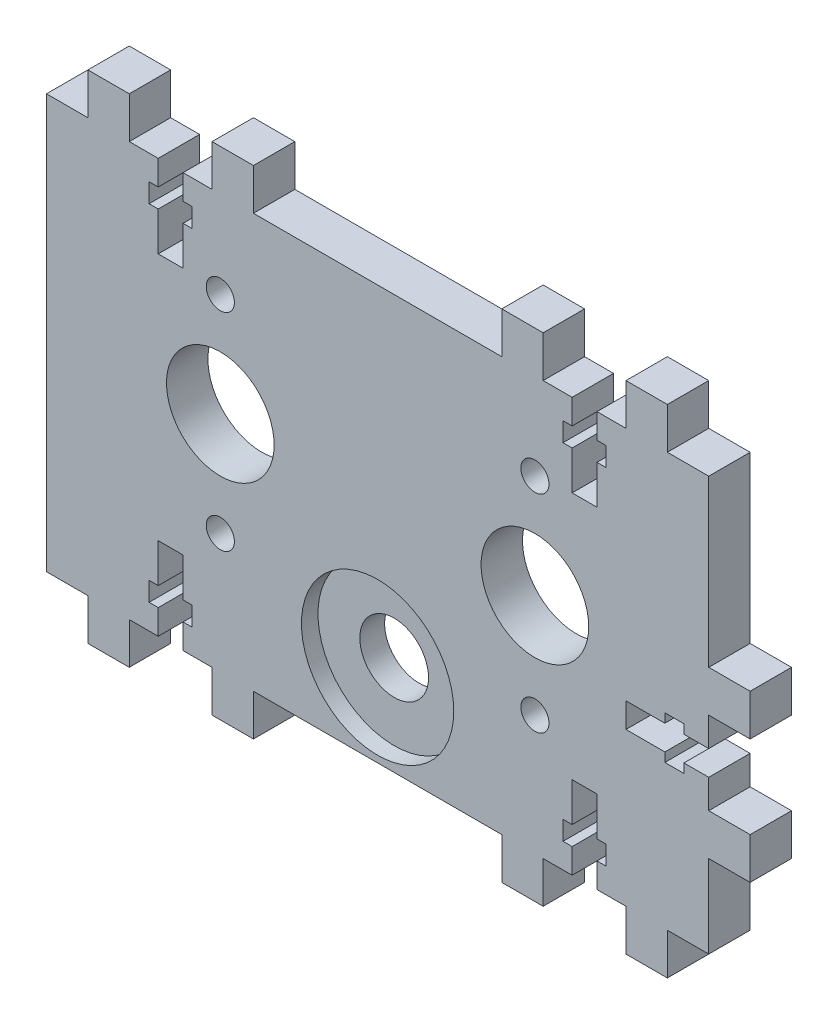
ISO-10303-21;
HEADER;
FILE_DESCRIPTION(('STEP AP214'),'2;1');
FILE_NAME('part.step','',(''),(''),'','','');
FILE_SCHEMA(('AUTOMOTIVE_DESIGN { 1 0 10303 214 1 1 1 1 }'));
ENDSEC;
DATA;
#1=APPLICATION_CONTEXT('core data for automotive mechanical design processes');
#2=APPLICATION_PROTOCOL_DEFINITION('international standard','automotive_design',2000,#1);
#3=PRODUCT_CONTEXT('',#1,'mechanical');
#4=PRODUCT('Part','Part','',(#3));
#5=PRODUCT_RELATED_PRODUCT_CATEGORY('part','',(#4));
#6=PRODUCT_DEFINITION_FORMATION('','',#4);
#7=PRODUCT_DEFINITION_CONTEXT('part definition',#1,'design');
#8=PRODUCT_DEFINITION('design','',#6,#7);
#9=PRODUCT_DEFINITION_SHAPE('','',#8);
#10=(LENGTH_UNIT() NAMED_UNIT(*) SI_UNIT(.MILLI.,.METRE.));
#11=(NAMED_UNIT(*) PLANE_ANGLE_UNIT() SI_UNIT($,.RADIAN.));
#12=(NAMED_UNIT(*) SI_UNIT($,.STERADIAN.) SOLID_ANGLE_UNIT());
#13=UNCERTAINTY_MEASURE_WITH_UNIT(LENGTH_MEASURE(1.E-05),#10,'distance_accuracy_value','');
#14=(GEOMETRIC_REPRESENTATION_CONTEXT(3) GLOBAL_UNCERTAINTY_ASSIGNED_CONTEXT((#13)) GLOBAL_UNIT_ASSIGNED_CONTEXT((#10,
#11,#12)) REPRESENTATION_CONTEXT('',''));
#15=CARTESIAN_POINT('',(0.,0.,0.));
#16=DIRECTION('',(0.,0.,1.));
#17=DIRECTION('',(1.,0.,0.));
#18=AXIS2_PLACEMENT_3D('',#15,#16,#17);
#19=CARTESIAN_POINT('',(0.,0.,5.));
#20=DIRECTION('',(0.,0.,1.));
#21=DIRECTION('',(1.,0.,0.));
#22=AXIS2_PLACEMENT_3D('',#19,#20,#21);
#23=PLANE('',#22);
#24=CARTESIAN_POINT('',(40.,10.,5.));
#25=DIRECTION('',(0.,0.,1.));
#26=DIRECTION('',(1.,0.,0.));
#27=AXIS2_PLACEMENT_3D('',#24,#25,#26);
#28=CIRCLE('',#27,9.2);
#29=CARTESIAN_POINT('',(49.2,10.,5.));
#30=VERTEX_POINT('',#29);
#31=EDGE_CURVE('E1503',#30,#30,#28,.T.);
#32=ORIENTED_EDGE('',*,*,#31,.F.);
#33=EDGE_LOOP('',(#32));
#34=FACE_BOUND('',#33,.T.);
#35=CARTESIAN_POINT('',(21.,27.007351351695,5.));
#36=DIRECTION('',(0.,0.,1.));
#37=DIRECTION('',(1.,0.,0.));
#38=AXIS2_PLACEMENT_3D('',#35,#36,#37);
#39=CIRCLE('',#38,6.5);
#40=CARTESIAN_POINT('',(27.5,27.007351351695,5.));
#41=VERTEX_POINT('',#40);
#42=EDGE_CURVE('E1512',#41,#41,#39,.T.);
#43=ORIENTED_EDGE('',*,*,#42,.F.);
#44=EDGE_LOOP('',(#43));
#45=FACE_BOUND('',#44,.T.);
#46=CARTESIAN_POINT('',(21.,39.507351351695,5.));
#47=DIRECTION('',(0.,0.,1.));
#48=DIRECTION('',(1.,0.,0.));
#49=AXIS2_PLACEMENT_3D('',#46,#47,#48);
#50=CIRCLE('',#49,1.7);
#51=CARTESIAN_POINT('',(22.7,39.507351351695,5.));
#52=VERTEX_POINT('',#51);
#53=EDGE_CURVE('E1524',#52,#52,#50,.T.);
#54=ORIENTED_EDGE('',*,*,#53,.F.);
#55=EDGE_LOOP('',(#54));
#56=FACE_BOUND('',#55,.T.);
#57=CARTESIAN_POINT('',(59.,14.507351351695,5.));
#58=DIRECTION('',(0.,0.,1.));
#59=DIRECTION('',(1.,0.,0.));
#60=AXIS2_PLACEMENT_3D('',#57,#58,#59);
#61=CIRCLE('',#60,1.70000000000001);
#62=CARTESIAN_POINT('',(60.7,14.507351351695,5.));
#63=VERTEX_POINT('',#62);
#64=EDGE_CURVE('E1536',#63,#63,#61,.T.);
#65=ORIENTED_EDGE('',*,*,#64,.F.);
#66=EDGE_LOOP('',(#65));
#67=FACE_BOUND('',#66,.T.);
#68=DIRECTION('',(0.,1.,0.));
#69=VECTOR('',#68,1.);
#70=CARTESIAN_POINT('',(80.,30.,5.));
#71=LINE('',#70,#69);
#72=CARTESIAN_POINT('',(80.,30.,5.));
#73=VERTEX_POINT('',#72);
#74=CARTESIAN_POINT('',(80.,50.,5.));
#75=VERTEX_POINT('',#74);
#76=EDGE_CURVE('E912',#73,#75,#71,.T.);
#77=ORIENTED_EDGE('',*,*,#76,.T.);
#78=DIRECTION('',(-1.,0.,0.));
#79=VECTOR('',#78,1.);
#80=CARTESIAN_POINT('',(80.,50.,5.));
#81=LINE('',#80,#79);
#82=CARTESIAN_POINT('',(75.,50.,5.));
#83=VERTEX_POINT('',#82);
#84=EDGE_CURVE('E380',#75,#83,#81,.T.);
#85=ORIENTED_EDGE('',*,*,#84,.T.);
#86=DIRECTION('',(0.,1.,0.));
#87=VECTOR('',#86,1.);
#88=CARTESIAN_POINT('',(75.,55.,5.));
#89=LINE('',#88,#87);
#90=CARTESIAN_POINT('',(75.,55.,5.));
#91=VERTEX_POINT('',#90);
#92=EDGE_CURVE('E1215',#83,#91,#89,.T.);
#93=ORIENTED_EDGE('',*,*,#92,.T.);
#94=DIRECTION('',(-1.,0.,0.));
#95=VECTOR('',#94,1.);
#96=CARTESIAN_POINT('',(70.,55.,5.));
#97=LINE('',#96,#95);
#98=CARTESIAN_POINT('',(70.,55.,5.));
#99=VERTEX_POINT('',#98);
#100=EDGE_CURVE('E1234',#91,#99,#97,.T.);
#101=ORIENTED_EDGE('',*,*,#100,.T.);
#102=DIRECTION('',(0.,-1.,0.));
#103=VECTOR('',#102,1.);
#104=CARTESIAN_POINT('',(70.,55.,5.));
#105=LINE('',#104,#103);
#106=CARTESIAN_POINT('',(70.,50.,5.));
#107=VERTEX_POINT('',#106);
#108=EDGE_CURVE('E1231',#99,#107,#105,.T.);
#109=ORIENTED_EDGE('',*,*,#108,.T.);
#110=DIRECTION('',(-1.,0.,0.));
#111=VECTOR('',#110,1.);
#112=CARTESIAN_POINT('',(66.5,50.,5.));
#113=LINE('',#112,#111);
#114=CARTESIAN_POINT('',(66.5,50.,5.));
#115=VERTEX_POINT('',#114);
#116=EDGE_CURVE('E1233',#107,#115,#113,.T.);
#117=ORIENTED_EDGE('',*,*,#116,.T.);
#118=DIRECTION('',(0.,-1.,0.));
#119=VECTOR('',#118,1.);
#120=CARTESIAN_POINT('',(66.5,47.,5.));
#121=LINE('',#120,#119);
#122=CARTESIAN_POINT('',(66.5,47.,5.));
#123=VERTEX_POINT('',#122);
#124=EDGE_CURVE('E1236',#115,#123,#121,.T.);
#125=ORIENTED_EDGE('',*,*,#124,.T.);
#126=DIRECTION('',(1.,0.,0.));
#127=VECTOR('',#126,1.);
#128=CARTESIAN_POINT('',(66.5,47.,5.));
#129=LINE('',#128,#127);
#130=CARTESIAN_POINT('',(67.6,47.,5.));
#131=VERTEX_POINT('',#130);
#132=EDGE_CURVE('E1242',#123,#131,#129,.T.);
#133=ORIENTED_EDGE('',*,*,#132,.T.);
#134=DIRECTION('',(0.,-1.,0.));
#135=VECTOR('',#134,1.);
#136=CARTESIAN_POINT('',(67.6,47.,5.));
#137=LINE('',#136,#135);
#138=CARTESIAN_POINT('',(67.6,44.7,5.));
#139=VERTEX_POINT('',#138);
#140=EDGE_CURVE('E1244',#131,#139,#137,.T.);
#141=ORIENTED_EDGE('',*,*,#140,.T.);
#142=DIRECTION('',(-1.,0.,0.));
#143=VECTOR('',#142,1.);
#144=CARTESIAN_POINT('',(67.6,44.7,5.));
#145=LINE('',#144,#143);
#146=CARTESIAN_POINT('',(66.5,44.7,5.));
#147=VERTEX_POINT('',#146);
#148=EDGE_CURVE('E1246',#139,#147,#145,.T.);
#149=ORIENTED_EDGE('',*,*,#148,.T.);
#150=DIRECTION('',(0.,-1.,0.));
#151=VECTOR('',#150,1.);
#152=CARTESIAN_POINT('',(66.5,40.,5.));
#153=LINE('',#152,#151);
#154=CARTESIAN_POINT('',(66.5,40.,5.));
#155=VERTEX_POINT('',#154);
#156=EDGE_CURVE('E1248',#147,#155,#153,.T.);
#157=ORIENTED_EDGE('',*,*,#156,.T.);
#158=DIRECTION('',(-1.,0.,0.));
#159=VECTOR('',#158,1.);
#160=CARTESIAN_POINT('',(63.5,40.,5.));
#161=LINE('',#160,#159);
#162=CARTESIAN_POINT('',(63.5,40.,5.));
#163=VERTEX_POINT('',#162);
#164=EDGE_CURVE('E1250',#155,#163,#161,.T.);
#165=ORIENTED_EDGE('',*,*,#164,.T.);
#166=DIRECTION('',(0.,1.,0.));
#167=VECTOR('',#166,1.);
#168=CARTESIAN_POINT('',(63.5,44.7,5.));
#169=LINE('',#168,#167);
#170=CARTESIAN_POINT('',(63.5,44.7,5.));
#171=VERTEX_POINT('',#170);
#172=EDGE_CURVE('E1252',#163,#171,#169,.T.);
#173=ORIENTED_EDGE('',*,*,#172,.T.);
#174=DIRECTION('',(-1.,0.,0.));
#175=VECTOR('',#174,1.);
#176=CARTESIAN_POINT('',(63.5,44.7,5.));
#177=LINE('',#176,#175);
#178=CARTESIAN_POINT('',(62.4,44.7,5.));
#179=VERTEX_POINT('',#178);
#180=EDGE_CURVE('E1254',#171,#179,#177,.T.);
#181=ORIENTED_EDGE('',*,*,#180,.T.);
#182=DIRECTION('',(0.,1.,0.));
#183=VECTOR('',#182,1.);
#184=CARTESIAN_POINT('',(62.4,44.7,5.));
#185=LINE('',#184,#183);
#186=CARTESIAN_POINT('',(62.4,47.,5.));
#187=VERTEX_POINT('',#186);
#188=EDGE_CURVE('E1256',#179,#187,#185,.T.);
#189=ORIENTED_EDGE('',*,*,#188,.T.);
#190=DIRECTION('',(1.,0.,0.));
#191=VECTOR('',#190,1.);
#192=CARTESIAN_POINT('',(62.4,47.,5.));
#193=LINE('',#192,#191);
#194=CARTESIAN_POINT('',(63.5,47.,5.));
#195=VERTEX_POINT('',#194);
#196=EDGE_CURVE('E1258',#187,#195,#193,.T.);
#197=ORIENTED_EDGE('',*,*,#196,.T.);
#198=DIRECTION('',(0.,1.,0.));
#199=VECTOR('',#198,1.);
#200=CARTESIAN_POINT('',(63.5,50.,5.));
#201=LINE('',#200,#199);
#202=CARTESIAN_POINT('',(63.5,50.,5.));
#203=VERTEX_POINT('',#202);
#204=EDGE_CURVE('E1260',#195,#203,#201,.T.);
#205=ORIENTED_EDGE('',*,*,#204,.T.);
#206=DIRECTION('',(-1.,0.,0.));
#207=VECTOR('',#206,1.);
#208=CARTESIAN_POINT('',(63.5,50.,5.));
#209=LINE('',#208,#207);
#210=CARTESIAN_POINT('',(60.,50.,5.));
#211=VERTEX_POINT('',#210);
#212=EDGE_CURVE('E1262',#203,#211,#209,.T.);
#213=ORIENTED_EDGE('',*,*,#212,.T.);
#214=DIRECTION('',(0.,1.,0.));
#215=VECTOR('',#214,1.);
#216=CARTESIAN_POINT('',(60.,50.,5.));
#217=LINE('',#216,#215);
#218=CARTESIAN_POINT('',(60.,55.,5.));
#219=VERTEX_POINT('',#218);
#220=EDGE_CURVE('E1264',#211,#219,#217,.T.);
#221=ORIENTED_EDGE('',*,*,#220,.T.);
#222=DIRECTION('',(-1.,0.,0.));
#223=VECTOR('',#222,1.);
#224=CARTESIAN_POINT('',(60.,55.,5.));
#225=LINE('',#224,#223);
#226=CARTESIAN_POINT('',(55.,55.,5.));
#227=VERTEX_POINT('',#226);
#228=EDGE_CURVE('E1266',#219,#227,#225,.T.);
#229=ORIENTED_EDGE('',*,*,#228,.T.);
#230=DIRECTION('',(0.,-1.,0.));
#231=VECTOR('',#230,1.);
#232=CARTESIAN_POINT('',(55.,55.,5.));
#233=LINE('',#232,#231);
#234=CARTESIAN_POINT('',(55.,50.,5.));
#235=VERTEX_POINT('',#234);
#236=EDGE_CURVE('E1268',#227,#235,#233,.T.);
#237=ORIENTED_EDGE('',*,*,#236,.T.);
#238=DIRECTION('',(-1.,0.,0.));
#239=VECTOR('',#238,1.);
#240=CARTESIAN_POINT('',(25.,50.,5.));
#241=LINE('',#240,#239);
#242=CARTESIAN_POINT('',(25.,50.,5.));
#243=VERTEX_POINT('',#242);
#244=EDGE_CURVE('E1270',#235,#243,#241,.T.);
#245=ORIENTED_EDGE('',*,*,#244,.T.);
#246=DIRECTION('',(0.,1.,0.));
#247=VECTOR('',#246,1.);
#248=CARTESIAN_POINT('',(25.,55.,5.));
#249=LINE('',#248,#247);
#250=CARTESIAN_POINT('',(25.,55.,5.));
#251=VERTEX_POINT('',#250);
#252=EDGE_CURVE('E1272',#243,#251,#249,.T.);
#253=ORIENTED_EDGE('',*,*,#252,.T.);
#254=DIRECTION('',(-1.,0.,0.));
#255=VECTOR('',#254,1.);
#256=CARTESIAN_POINT('',(20.,55.,5.));
#257=LINE('',#256,#255);
#258=CARTESIAN_POINT('',(20.,55.,5.));
#259=VERTEX_POINT('',#258);
#260=EDGE_CURVE('E1274',#251,#259,#257,.T.);
#261=ORIENTED_EDGE('',*,*,#260,.T.);
#262=DIRECTION('',(0.,-1.,0.));
#263=VECTOR('',#262,1.);
#264=CARTESIAN_POINT('',(20.,55.,5.));
#265=LINE('',#264,#263);
#266=CARTESIAN_POINT('',(20.,50.,5.));
#267=VERTEX_POINT('',#266);
#268=EDGE_CURVE('E1276',#259,#267,#265,.T.);
#269=ORIENTED_EDGE('',*,*,#268,.T.);
#270=DIRECTION('',(-1.,0.,0.));
#271=VECTOR('',#270,1.);
#272=CARTESIAN_POINT('',(16.5,50.,5.));
#273=LINE('',#272,#271);
#274=CARTESIAN_POINT('',(16.5,50.,5.));
#275=VERTEX_POINT('',#274);
#276=EDGE_CURVE('E1278',#267,#275,#273,.T.);
#277=ORIENTED_EDGE('',*,*,#276,.T.);
#278=DIRECTION('',(0.,-1.,0.));
#279=VECTOR('',#278,1.);
#280=CARTESIAN_POINT('',(16.5,47.,5.));
#281=LINE('',#280,#279);
#282=CARTESIAN_POINT('',(16.5,47.,5.));
#283=VERTEX_POINT('',#282);
#284=EDGE_CURVE('E1280',#275,#283,#281,.T.);
#285=ORIENTED_EDGE('',*,*,#284,.T.);
#286=DIRECTION('',(1.,0.,0.));
#287=VECTOR('',#286,1.);
#288=CARTESIAN_POINT('',(16.5,47.,5.));
#289=LINE('',#288,#287);
#290=CARTESIAN_POINT('',(17.6,47.,5.));
#291=VERTEX_POINT('',#290);
#292=EDGE_CURVE('E1282',#283,#291,#289,.T.);
#293=ORIENTED_EDGE('',*,*,#292,.T.);
#294=DIRECTION('',(0.,-1.,0.));
#295=VECTOR('',#294,1.);
#296=CARTESIAN_POINT('',(17.6,47.,5.));
#297=LINE('',#296,#295);
#298=CARTESIAN_POINT('',(17.6,44.7,5.));
#299=VERTEX_POINT('',#298);
#300=EDGE_CURVE('E1284',#291,#299,#297,.T.);
#301=ORIENTED_EDGE('',*,*,#300,.T.);
#302=DIRECTION('',(-1.,0.,0.));
#303=VECTOR('',#302,1.);
#304=CARTESIAN_POINT('',(17.6,44.7,5.));
#305=LINE('',#304,#303);
#306=CARTESIAN_POINT('',(16.5,44.7,5.));
#307=VERTEX_POINT('',#306);
#308=EDGE_CURVE('E1286',#299,#307,#305,.T.);
#309=ORIENTED_EDGE('',*,*,#308,.T.);
#310=DIRECTION('',(0.,-1.,0.));
#311=VECTOR('',#310,1.);
#312=CARTESIAN_POINT('',(16.5,40.,5.));
#313=LINE('',#312,#311);
#314=CARTESIAN_POINT('',(16.5,40.,5.));
#315=VERTEX_POINT('',#314);
#316=EDGE_CURVE('E1288',#307,#315,#313,.T.);
#317=ORIENTED_EDGE('',*,*,#316,.T.);
#318=DIRECTION('',(-1.,0.,0.));
#319=VECTOR('',#318,1.);
#320=CARTESIAN_POINT('',(13.5,40.,5.));
#321=LINE('',#320,#319);
#322=CARTESIAN_POINT('',(13.5,40.,5.));
#323=VERTEX_POINT('',#322);
#324=EDGE_CURVE('E1290',#315,#323,#321,.T.);
#325=ORIENTED_EDGE('',*,*,#324,.T.);
#326=DIRECTION('',(0.,1.,0.));
#327=VECTOR('',#326,1.);
#328=CARTESIAN_POINT('',(13.5,44.7,5.));
#329=LINE('',#328,#327);
#330=CARTESIAN_POINT('',(13.5,44.7,5.));
#331=VERTEX_POINT('',#330);
#332=EDGE_CURVE('E1292',#323,#331,#329,.T.);
#333=ORIENTED_EDGE('',*,*,#332,.T.);
#334=DIRECTION('',(-1.,0.,0.));
#335=VECTOR('',#334,1.);
#336=CARTESIAN_POINT('',(13.5,44.7,5.));
#337=LINE('',#336,#335);
#338=CARTESIAN_POINT('',(12.4,44.7,5.));
#339=VERTEX_POINT('',#338);
#340=EDGE_CURVE('E1294',#331,#339,#337,.T.);
#341=ORIENTED_EDGE('',*,*,#340,.T.);
#342=DIRECTION('',(0.,1.,0.));
#343=VECTOR('',#342,1.);
#344=CARTESIAN_POINT('',(12.4,44.7,5.));
#345=LINE('',#344,#343);
#346=CARTESIAN_POINT('',(12.4,47.,5.));
#347=VERTEX_POINT('',#346);
#348=EDGE_CURVE('E1296',#339,#347,#345,.T.);
#349=ORIENTED_EDGE('',*,*,#348,.T.);
#350=DIRECTION('',(1.,0.,0.));
#351=VECTOR('',#350,1.);
#352=CARTESIAN_POINT('',(12.4,47.,5.));
#353=LINE('',#352,#351);
#354=CARTESIAN_POINT('',(13.5,47.,5.));
#355=VERTEX_POINT('',#354);
#356=EDGE_CURVE('E1298',#347,#355,#353,.T.);
#357=ORIENTED_EDGE('',*,*,#356,.T.);
#358=DIRECTION('',(0.,1.,0.));
#359=VECTOR('',#358,1.);
#360=CARTESIAN_POINT('',(13.5,50.,5.));
#361=LINE('',#360,#359);
#362=CARTESIAN_POINT('',(13.5,50.,5.));
#363=VERTEX_POINT('',#362);
#364=EDGE_CURVE('E1300',#355,#363,#361,.T.);
#365=ORIENTED_EDGE('',*,*,#364,.T.);
#366=DIRECTION('',(-1.,0.,0.));
#367=VECTOR('',#366,1.);
#368=CARTESIAN_POINT('',(13.5,50.,5.));
#369=LINE('',#368,#367);
#370=CARTESIAN_POINT('',(9.99999999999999,50.,5.));
#371=VERTEX_POINT('',#370);
#372=EDGE_CURVE('E1302',#363,#371,#369,.T.);
#373=ORIENTED_EDGE('',*,*,#372,.T.);
#374=DIRECTION('',(0.,1.,0.));
#375=VECTOR('',#374,1.);
#376=CARTESIAN_POINT('',(9.99999999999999,50.,5.));
#377=LINE('',#376,#375);
#378=CARTESIAN_POINT('',(9.99999999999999,55.,5.));
#379=VERTEX_POINT('',#378);
#380=EDGE_CURVE('E1304',#371,#379,#377,.T.);
#381=ORIENTED_EDGE('',*,*,#380,.T.);
#382=DIRECTION('',(-1.,0.,0.));
#383=VECTOR('',#382,1.);
#384=CARTESIAN_POINT('',(9.99999999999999,55.,5.));
#385=LINE('',#384,#383);
#386=CARTESIAN_POINT('',(4.99999999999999,55.,5.));
#387=VERTEX_POINT('',#386);
#388=EDGE_CURVE('E1306',#379,#387,#385,.T.);
#389=ORIENTED_EDGE('',*,*,#388,.T.);
#390=DIRECTION('',(0.,-1.,0.));
#391=VECTOR('',#390,1.);
#392=CARTESIAN_POINT('',(4.99999999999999,55.,5.));
#393=LINE('',#392,#391);
#394=CARTESIAN_POINT('',(4.99999999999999,50.,5.));
#395=VERTEX_POINT('',#394);
#396=EDGE_CURVE('E1308',#387,#395,#393,.T.);
#397=ORIENTED_EDGE('',*,*,#396,.T.);
#398=DIRECTION('',(-1.,0.,0.));
#399=VECTOR('',#398,1.);
#400=CARTESIAN_POINT('',(4.99999999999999,50.,5.));
#401=LINE('',#400,#399);
#402=CARTESIAN_POINT('',(0.,50.,5.));
#403=VERTEX_POINT('',#402);
#404=EDGE_CURVE('E1310',#395,#403,#401,.T.);
#405=ORIENTED_EDGE('',*,*,#404,.T.);
#406=DIRECTION('',(0.,-1.,0.));
#407=VECTOR('',#406,1.);
#408=CARTESIAN_POINT('',(0.,0.,5.));
#409=LINE('',#408,#407);
#410=CARTESIAN_POINT('',(0.,0.,5.));
#411=VERTEX_POINT('',#410);
#412=EDGE_CURVE('E1312',#403,#411,#409,.T.);
#413=ORIENTED_EDGE('',*,*,#412,.T.);
#414=DIRECTION('',(1.,0.,0.));
#415=VECTOR('',#414,1.);
#416=CARTESIAN_POINT('',(5.,0.,5.));
#417=LINE('',#416,#415);
#418=CARTESIAN_POINT('',(5.,0.,5.));
#419=VERTEX_POINT('',#418);
#420=EDGE_CURVE('E1314',#411,#419,#417,.T.);
#421=ORIENTED_EDGE('',*,*,#420,.T.);
#422=DIRECTION('',(0.,-1.,0.));
#423=VECTOR('',#422,1.);
#424=CARTESIAN_POINT('',(5.,-5.,5.));
#425=LINE('',#424,#423);
#426=CARTESIAN_POINT('',(5.,-5.,5.));
#427=VERTEX_POINT('',#426);
#428=EDGE_CURVE('E1316',#419,#427,#425,.T.);
#429=ORIENTED_EDGE('',*,*,#428,.T.);
#430=DIRECTION('',(1.,0.,0.));
#431=VECTOR('',#430,1.);
#432=CARTESIAN_POINT('',(10.,-5.,5.));
#433=LINE('',#432,#431);
#434=CARTESIAN_POINT('',(10.,-5.,5.));
#435=VERTEX_POINT('',#434);
#436=EDGE_CURVE('E1318',#427,#435,#433,.T.);
#437=ORIENTED_EDGE('',*,*,#436,.T.);
#438=DIRECTION('',(0.,1.,0.));
#439=VECTOR('',#438,1.);
#440=CARTESIAN_POINT('',(10.,-5.,5.));
#441=LINE('',#440,#439);
#442=CARTESIAN_POINT('',(10.,0.,5.));
#443=VERTEX_POINT('',#442);
#444=EDGE_CURVE('E1320',#435,#443,#441,.T.);
#445=ORIENTED_EDGE('',*,*,#444,.T.);
#446=DIRECTION('',(1.,0.,0.));
#447=VECTOR('',#446,1.);
#448=CARTESIAN_POINT('',(13.5,0.,5.));
#449=LINE('',#448,#447);
#450=CARTESIAN_POINT('',(13.5,0.,5.));
#451=VERTEX_POINT('',#450);
#452=EDGE_CURVE('E1322',#443,#451,#449,.T.);
#453=ORIENTED_EDGE('',*,*,#452,.T.);
#454=DIRECTION('',(0.,1.,0.));
#455=VECTOR('',#454,1.);
#456=CARTESIAN_POINT('',(13.5,3.,5.));
#457=LINE('',#456,#455);
#458=CARTESIAN_POINT('',(13.5,3.,5.));
#459=VERTEX_POINT('',#458);
#460=EDGE_CURVE('E1324',#451,#459,#457,.T.);
#461=ORIENTED_EDGE('',*,*,#460,.T.);
#462=DIRECTION('',(-1.,0.,0.));
#463=VECTOR('',#462,1.);
#464=CARTESIAN_POINT('',(13.5,3.,5.));
#465=LINE('',#464,#463);
#466=CARTESIAN_POINT('',(12.4,3.,5.));
#467=VERTEX_POINT('',#466);
#468=EDGE_CURVE('E1326',#459,#467,#465,.T.);
#469=ORIENTED_EDGE('',*,*,#468,.T.);
#470=DIRECTION('',(0.,1.,0.));
#471=VECTOR('',#470,1.);
#472=CARTESIAN_POINT('',(12.4,3.,5.));
#473=LINE('',#472,#471);
#474=CARTESIAN_POINT('',(12.4,5.3,5.));
#475=VERTEX_POINT('',#474);
#476=EDGE_CURVE('E1328',#467,#475,#473,.T.);
#477=ORIENTED_EDGE('',*,*,#476,.T.);
#478=DIRECTION('',(1.,0.,0.));
#479=VECTOR('',#478,1.);
#480=CARTESIAN_POINT('',(12.4,5.3,5.));
#481=LINE('',#480,#479);
#482=CARTESIAN_POINT('',(13.5,5.3,5.));
#483=VERTEX_POINT('',#482);
#484=EDGE_CURVE('E1330',#475,#483,#481,.T.);
#485=ORIENTED_EDGE('',*,*,#484,.T.);
#486=DIRECTION('',(0.,1.,0.));
#487=VECTOR('',#486,1.);
#488=CARTESIAN_POINT('',(13.5,10.,5.));
#489=LINE('',#488,#487);
#490=CARTESIAN_POINT('',(13.5,10.,5.));
#491=VERTEX_POINT('',#490);
#492=EDGE_CURVE('E1332',#483,#491,#489,.T.);
#493=ORIENTED_EDGE('',*,*,#492,.T.);
#494=DIRECTION('',(1.,0.,0.));
#495=VECTOR('',#494,1.);
#496=CARTESIAN_POINT('',(16.5,10.,5.));
#497=LINE('',#496,#495);
#498=CARTESIAN_POINT('',(16.5,10.,5.));
#499=VERTEX_POINT('',#498);
#500=EDGE_CURVE('E1334',#491,#499,#497,.T.);
#501=ORIENTED_EDGE('',*,*,#500,.T.);
#502=DIRECTION('',(0.,-1.,0.));
#503=VECTOR('',#502,1.);
#504=CARTESIAN_POINT('',(16.5,5.3,5.));
#505=LINE('',#504,#503);
#506=CARTESIAN_POINT('',(16.5,5.3,5.));
#507=VERTEX_POINT('',#506);
#508=EDGE_CURVE('E1336',#499,#507,#505,.T.);
#509=ORIENTED_EDGE('',*,*,#508,.T.);
#510=DIRECTION('',(1.,0.,0.));
#511=VECTOR('',#510,1.);
#512=CARTESIAN_POINT('',(16.5,5.3,5.));
#513=LINE('',#512,#511);
#514=CARTESIAN_POINT('',(17.6,5.3,5.));
#515=VERTEX_POINT('',#514);
#516=EDGE_CURVE('E1338',#507,#515,#513,.T.);
#517=ORIENTED_EDGE('',*,*,#516,.T.);
#518=DIRECTION('',(0.,-1.,0.));
#519=VECTOR('',#518,1.);
#520=CARTESIAN_POINT('',(17.6,5.3,5.));
#521=LINE('',#520,#519);
#522=CARTESIAN_POINT('',(17.6,3.,5.));
#523=VERTEX_POINT('',#522);
#524=EDGE_CURVE('E1340',#515,#523,#521,.T.);
#525=ORIENTED_EDGE('',*,*,#524,.T.);
#526=DIRECTION('',(-1.,0.,0.));
#527=VECTOR('',#526,1.);
#528=CARTESIAN_POINT('',(17.6,3.,5.));
#529=LINE('',#528,#527);
#530=CARTESIAN_POINT('',(16.5,3.,5.));
#531=VERTEX_POINT('',#530);
#532=EDGE_CURVE('E1342',#523,#531,#529,.T.);
#533=ORIENTED_EDGE('',*,*,#532,.T.);
#534=DIRECTION('',(0.,-1.,0.));
#535=VECTOR('',#534,1.);
#536=CARTESIAN_POINT('',(16.5,0.,5.));
#537=LINE('',#536,#535);
#538=CARTESIAN_POINT('',(16.5,0.,5.));
#539=VERTEX_POINT('',#538);
#540=EDGE_CURVE('E1344',#531,#539,#537,.T.);
#541=ORIENTED_EDGE('',*,*,#540,.T.);
#542=DIRECTION('',(1.,0.,0.));
#543=VECTOR('',#542,1.);
#544=CARTESIAN_POINT('',(16.5,0.,5.));
#545=LINE('',#544,#543);
#546=CARTESIAN_POINT('',(20.,0.,5.));
#547=VERTEX_POINT('',#546);
#548=EDGE_CURVE('E1346',#539,#547,#545,.T.);
#549=ORIENTED_EDGE('',*,*,#548,.T.);
#550=DIRECTION('',(0.,-1.,0.));
#551=VECTOR('',#550,1.);
#552=CARTESIAN_POINT('',(20.,0.,5.));
#553=LINE('',#552,#551);
#554=CARTESIAN_POINT('',(20.,-5.,5.));
#555=VERTEX_POINT('',#554);
#556=EDGE_CURVE('E1348',#547,#555,#553,.T.);
#557=ORIENTED_EDGE('',*,*,#556,.T.);
#558=DIRECTION('',(1.,0.,0.));
#559=VECTOR('',#558,1.);
#560=CARTESIAN_POINT('',(20.,-5.,5.));
#561=LINE('',#560,#559);
#562=CARTESIAN_POINT('',(25.,-5.,5.));
#563=VERTEX_POINT('',#562);
#564=EDGE_CURVE('E1350',#555,#563,#561,.T.);
#565=ORIENTED_EDGE('',*,*,#564,.T.);
#566=DIRECTION('',(0.,1.,0.));
#567=VECTOR('',#566,1.);
#568=CARTESIAN_POINT('',(25.,-5.,5.));
#569=LINE('',#568,#567);
#570=CARTESIAN_POINT('',(25.,0.,5.));
#571=VERTEX_POINT('',#570);
#572=EDGE_CURVE('E1352',#563,#571,#569,.T.);
#573=ORIENTED_EDGE('',*,*,#572,.T.);
#574=DIRECTION('',(1.,0.,0.));
#575=VECTOR('',#574,1.);
#576=CARTESIAN_POINT('',(55.,0.,5.));
#577=LINE('',#576,#575);
#578=CARTESIAN_POINT('',(55.,0.,5.));
#579=VERTEX_POINT('',#578);
#580=EDGE_CURVE('E1354',#571,#579,#577,.T.);
#581=ORIENTED_EDGE('',*,*,#580,.T.);
#582=DIRECTION('',(0.,-1.,0.));
#583=VECTOR('',#582,1.);
#584=CARTESIAN_POINT('',(55.,-5.,5.));
#585=LINE('',#584,#583);
#586=CARTESIAN_POINT('',(55.,-5.,5.));
#587=VERTEX_POINT('',#586);
#588=EDGE_CURVE('E1356',#579,#587,#585,.T.);
#589=ORIENTED_EDGE('',*,*,#588,.T.);
#590=DIRECTION('',(1.,0.,0.));
#591=VECTOR('',#590,1.);
#592=CARTESIAN_POINT('',(60.,-5.,5.));
#593=LINE('',#592,#591);
#594=CARTESIAN_POINT('',(60.,-5.,5.));
#595=VERTEX_POINT('',#594);
#596=EDGE_CURVE('E1358',#587,#595,#593,.T.);
#597=ORIENTED_EDGE('',*,*,#596,.T.);
#598=DIRECTION('',(0.,1.,0.));
#599=VECTOR('',#598,1.);
#600=CARTESIAN_POINT('',(60.,-5.,5.));
#601=LINE('',#600,#599);
#602=CARTESIAN_POINT('',(60.,0.,5.));
#603=VERTEX_POINT('',#602);
#604=EDGE_CURVE('E1360',#595,#603,#601,.T.);
#605=ORIENTED_EDGE('',*,*,#604,.T.);
#606=DIRECTION('',(1.,0.,0.));
#607=VECTOR('',#606,1.);
#608=CARTESIAN_POINT('',(63.5,0.,5.));
#609=LINE('',#608,#607);
#610=CARTESIAN_POINT('',(63.5,0.,5.));
#611=VERTEX_POINT('',#610);
#612=EDGE_CURVE('E1362',#603,#611,#609,.T.);
#613=ORIENTED_EDGE('',*,*,#612,.T.);
#614=DIRECTION('',(0.,1.,0.));
#615=VECTOR('',#614,1.);
#616=CARTESIAN_POINT('',(63.5,3.,5.));
#617=LINE('',#616,#615);
#618=CARTESIAN_POINT('',(63.5,3.,5.));
#619=VERTEX_POINT('',#618);
#620=EDGE_CURVE('E1364',#611,#619,#617,.T.);
#621=ORIENTED_EDGE('',*,*,#620,.T.);
#622=DIRECTION('',(-1.,0.,0.));
#623=VECTOR('',#622,1.);
#624=CARTESIAN_POINT('',(63.5,3.,5.));
#625=LINE('',#624,#623);
#626=CARTESIAN_POINT('',(62.4,3.,5.));
#627=VERTEX_POINT('',#626);
#628=EDGE_CURVE('E1366',#619,#627,#625,.T.);
#629=ORIENTED_EDGE('',*,*,#628,.T.);
#630=DIRECTION('',(0.,1.,0.));
#631=VECTOR('',#630,1.);
#632=CARTESIAN_POINT('',(62.4,3.,5.));
#633=LINE('',#632,#631);
#634=CARTESIAN_POINT('',(62.4,5.3,5.));
#635=VERTEX_POINT('',#634);
#636=EDGE_CURVE('E1368',#627,#635,#633,.T.);
#637=ORIENTED_EDGE('',*,*,#636,.T.);
#638=DIRECTION('',(1.,0.,0.));
#639=VECTOR('',#638,1.);
#640=CARTESIAN_POINT('',(62.4,5.3,5.));
#641=LINE('',#640,#639);
#642=CARTESIAN_POINT('',(63.5,5.3,5.));
#643=VERTEX_POINT('',#642);
#644=EDGE_CURVE('E1370',#635,#643,#641,.T.);
#645=ORIENTED_EDGE('',*,*,#644,.T.);
#646=DIRECTION('',(0.,1.,0.));
#647=VECTOR('',#646,1.);
#648=CARTESIAN_POINT('',(63.5,10.,5.));
#649=LINE('',#648,#647);
#650=CARTESIAN_POINT('',(63.5,10.,5.));
#651=VERTEX_POINT('',#650);
#652=EDGE_CURVE('E1372',#643,#651,#649,.T.);
#653=ORIENTED_EDGE('',*,*,#652,.T.);
#654=DIRECTION('',(1.,0.,0.));
#655=VECTOR('',#654,1.);
#656=CARTESIAN_POINT('',(66.5,10.,5.));
#657=LINE('',#656,#655);
#658=CARTESIAN_POINT('',(66.5,10.,5.));
#659=VERTEX_POINT('',#658);
#660=EDGE_CURVE('E1374',#651,#659,#657,.T.);
#661=ORIENTED_EDGE('',*,*,#660,.T.);
#662=DIRECTION('',(0.,-1.,0.));
#663=VECTOR('',#662,1.);
#664=CARTESIAN_POINT('',(66.5,5.3,5.));
#665=LINE('',#664,#663);
#666=CARTESIAN_POINT('',(66.5,5.3,5.));
#667=VERTEX_POINT('',#666);
#668=EDGE_CURVE('E1376',#659,#667,#665,.T.);
#669=ORIENTED_EDGE('',*,*,#668,.T.);
#670=DIRECTION('',(1.,0.,0.));
#671=VECTOR('',#670,1.);
#672=CARTESIAN_POINT('',(66.5,5.3,5.));
#673=LINE('',#672,#671);
#674=CARTESIAN_POINT('',(67.6,5.3,5.));
#675=VERTEX_POINT('',#674);
#676=EDGE_CURVE('E1378',#667,#675,#673,.T.);
#677=ORIENTED_EDGE('',*,*,#676,.T.);
#678=DIRECTION('',(0.,-1.,0.));
#679=VECTOR('',#678,1.);
#680=CARTESIAN_POINT('',(67.6,5.3,5.));
#681=LINE('',#680,#679);
#682=CARTESIAN_POINT('',(67.6,3.,5.));
#683=VERTEX_POINT('',#682);
#684=EDGE_CURVE('E1380',#675,#683,#681,.T.);
#685=ORIENTED_EDGE('',*,*,#684,.T.);
#686=DIRECTION('',(-1.,0.,0.));
#687=VECTOR('',#686,1.);
#688=CARTESIAN_POINT('',(67.6,3.,5.));
#689=LINE('',#688,#687);
#690=CARTESIAN_POINT('',(66.5,3.,5.));
#691=VERTEX_POINT('',#690);
#692=EDGE_CURVE('E1382',#683,#691,#689,.T.);
#693=ORIENTED_EDGE('',*,*,#692,.T.);
#694=DIRECTION('',(0.,-1.,0.));
#695=VECTOR('',#694,1.);
#696=CARTESIAN_POINT('',(66.5,0.,5.));
#697=LINE('',#696,#695);
#698=CARTESIAN_POINT('',(66.5,0.,5.));
#699=VERTEX_POINT('',#698);
#700=EDGE_CURVE('E1384',#691,#699,#697,.T.);
#701=ORIENTED_EDGE('',*,*,#700,.T.);
#702=DIRECTION('',(1.,0.,0.));
#703=VECTOR('',#702,1.);
#704=CARTESIAN_POINT('',(66.5,0.,5.));
#705=LINE('',#704,#703);
#706=CARTESIAN_POINT('',(70.,0.,5.));
#707=VERTEX_POINT('',#706);
#708=EDGE_CURVE('E1386',#699,#707,#705,.T.);
#709=ORIENTED_EDGE('',*,*,#708,.T.);
#710=DIRECTION('',(0.,-1.,0.));
#711=VECTOR('',#710,1.);
#712=CARTESIAN_POINT('',(70.,0.,5.));
#713=LINE('',#712,#711);
#714=CARTESIAN_POINT('',(70.,-5.,5.));
#715=VERTEX_POINT('',#714);
#716=EDGE_CURVE('E1388',#707,#715,#713,.T.);
#717=ORIENTED_EDGE('',*,*,#716,.T.);
#718=DIRECTION('',(1.,0.,0.));
#719=VECTOR('',#718,1.);
#720=CARTESIAN_POINT('',(70.,-5.,5.));
#721=LINE('',#720,#719);
#722=CARTESIAN_POINT('',(75.,-5.,5.));
#723=VERTEX_POINT('',#722);
#724=EDGE_CURVE('E1390',#715,#723,#721,.T.);
#725=ORIENTED_EDGE('',*,*,#724,.T.);
#726=DIRECTION('',(0.,1.,0.));
#727=VECTOR('',#726,1.);
#728=CARTESIAN_POINT('',(75.,-5.,5.));
#729=LINE('',#728,#727);
#730=CARTESIAN_POINT('',(75.,0.,5.));
#731=VERTEX_POINT('',#730);
#732=EDGE_CURVE('E1392',#723,#731,#729,.T.);
#733=ORIENTED_EDGE('',*,*,#732,.T.);
#734=DIRECTION('',(1.,0.,0.));
#735=VECTOR('',#734,1.);
#736=CARTESIAN_POINT('',(75.,0.,5.));
#737=LINE('',#736,#735);
#738=CARTESIAN_POINT('',(80.,0.,5.));
#739=VERTEX_POINT('',#738);
#740=EDGE_CURVE('E1394',#731,#739,#737,.T.);
#741=ORIENTED_EDGE('',*,*,#740,.T.);
#742=DIRECTION('',(0.,1.,0.));
#743=VECTOR('',#742,1.);
#744=CARTESIAN_POINT('',(80.,10.,5.));
#745=LINE('',#744,#743);
#746=CARTESIAN_POINT('',(80.,10.,5.));
#747=VERTEX_POINT('',#746);
#748=EDGE_CURVE('E1396',#739,#747,#745,.T.);
#749=ORIENTED_EDGE('',*,*,#748,.T.);
#750=DIRECTION('',(1.,0.,0.));
#751=VECTOR('',#750,1.);
#752=CARTESIAN_POINT('',(85.,10.,5.));
#753=LINE('',#752,#751);
#754=CARTESIAN_POINT('',(85.,10.,5.));
#755=VERTEX_POINT('',#754);
#756=EDGE_CURVE('E1398',#747,#755,#753,.T.);
#757=ORIENTED_EDGE('',*,*,#756,.T.);
#758=DIRECTION('',(0.,1.,0.));
#759=VECTOR('',#758,1.);
#760=CARTESIAN_POINT('',(85.,15.,5.));
#761=LINE('',#760,#759);
#762=CARTESIAN_POINT('',(85.,15.,5.));
#763=VERTEX_POINT('',#762);
#764=EDGE_CURVE('E1400',#755,#763,#761,.T.);
#765=ORIENTED_EDGE('',*,*,#764,.T.);
#766=DIRECTION('',(-1.,0.,0.));
#767=VECTOR('',#766,1.);
#768=CARTESIAN_POINT('',(85.,15.,5.));
#769=LINE('',#768,#767);
#770=CARTESIAN_POINT('',(80.,15.,5.));
#771=VERTEX_POINT('',#770);
#772=EDGE_CURVE('E1402',#763,#771,#769,.T.);
#773=ORIENTED_EDGE('',*,*,#772,.T.);
#774=DIRECTION('',(0.,1.,0.));
#775=VECTOR('',#774,1.);
#776=CARTESIAN_POINT('',(80.,18.5,5.));
#777=LINE('',#776,#775);
#778=CARTESIAN_POINT('',(80.,18.5,5.));
#779=VERTEX_POINT('',#778);
#780=EDGE_CURVE('E1404',#771,#779,#777,.T.);
#781=ORIENTED_EDGE('',*,*,#780,.T.);
#782=DIRECTION('',(-1.,0.,0.));
#783=VECTOR('',#782,1.);
#784=CARTESIAN_POINT('',(77.,18.5,5.));
#785=LINE('',#784,#783);
#786=CARTESIAN_POINT('',(77.,18.5,5.));
#787=VERTEX_POINT('',#786);
#788=EDGE_CURVE('E1406',#779,#787,#785,.T.);
#789=ORIENTED_EDGE('',*,*,#788,.T.);
#790=DIRECTION('',(0.,-1.,0.));
#791=VECTOR('',#790,1.);
#792=CARTESIAN_POINT('',(77.,18.5,5.));
#793=LINE('',#792,#791);
#794=CARTESIAN_POINT('',(77.,17.4,5.));
#795=VERTEX_POINT('',#794);
#796=EDGE_CURVE('E1408',#787,#795,#793,.T.);
#797=ORIENTED_EDGE('',*,*,#796,.T.);
#798=DIRECTION('',(-1.,0.,0.));
#799=VECTOR('',#798,1.);
#800=CARTESIAN_POINT('',(77.,17.4,5.));
#801=LINE('',#800,#799);
#802=CARTESIAN_POINT('',(74.7,17.4,5.));
#803=VERTEX_POINT('',#802);
#804=EDGE_CURVE('E1410',#795,#803,#801,.T.);
#805=ORIENTED_EDGE('',*,*,#804,.T.);
#806=DIRECTION('',(0.,1.,0.));
#807=VECTOR('',#806,1.);
#808=CARTESIAN_POINT('',(74.7,17.4,5.));
#809=LINE('',#808,#807);
#810=CARTESIAN_POINT('',(74.7,18.5,5.));
#811=VERTEX_POINT('',#810);
#812=EDGE_CURVE('E1412',#803,#811,#809,.T.);
#813=ORIENTED_EDGE('',*,*,#812,.T.);
#814=DIRECTION('',(-1.,0.,0.));
#815=VECTOR('',#814,1.);
#816=CARTESIAN_POINT('',(70.,18.5,5.));
#817=LINE('',#816,#815);
#818=CARTESIAN_POINT('',(70.,18.5,5.));
#819=VERTEX_POINT('',#818);
#820=EDGE_CURVE('E1414',#811,#819,#817,.T.);
#821=ORIENTED_EDGE('',*,*,#820,.T.);
#822=DIRECTION('',(0.,1.,0.));
#823=VECTOR('',#822,1.);
#824=CARTESIAN_POINT('',(70.,21.5,5.));
#825=LINE('',#824,#823);
#826=CARTESIAN_POINT('',(70.,21.5,5.));
#827=VERTEX_POINT('',#826);
#828=EDGE_CURVE('E1416',#819,#827,#825,.T.);
#829=ORIENTED_EDGE('',*,*,#828,.T.);
#830=DIRECTION('',(1.,0.,0.));
#831=VECTOR('',#830,1.);
#832=CARTESIAN_POINT('',(74.7,21.5,5.));
#833=LINE('',#832,#831);
#834=CARTESIAN_POINT('',(74.7,21.5,5.));
#835=VERTEX_POINT('',#834);
#836=EDGE_CURVE('E1418',#827,#835,#833,.T.);
#837=ORIENTED_EDGE('',*,*,#836,.T.);
#838=DIRECTION('',(0.,1.,0.));
#839=VECTOR('',#838,1.);
#840=CARTESIAN_POINT('',(74.7,21.5,5.));
#841=LINE('',#840,#839);
#842=CARTESIAN_POINT('',(74.7,22.6,5.));
#843=VERTEX_POINT('',#842);
#844=EDGE_CURVE('E1420',#835,#843,#841,.T.);
#845=ORIENTED_EDGE('',*,*,#844,.T.);
#846=DIRECTION('',(1.,0.,0.));
#847=VECTOR('',#846,1.);
#848=CARTESIAN_POINT('',(74.7,22.6,5.));
#849=LINE('',#848,#847);
#850=CARTESIAN_POINT('',(77.,22.6,5.));
#851=VERTEX_POINT('',#850);
#852=EDGE_CURVE('E1422',#843,#851,#849,.T.);
#853=ORIENTED_EDGE('',*,*,#852,.T.);
#854=DIRECTION('',(0.,-1.,0.));
#855=VECTOR('',#854,1.);
#856=CARTESIAN_POINT('',(77.,22.6,5.));
#857=LINE('',#856,#855);
#858=CARTESIAN_POINT('',(77.,21.5,5.));
#859=VERTEX_POINT('',#858);
#860=EDGE_CURVE('E1424',#851,#859,#857,.T.);
#861=ORIENTED_EDGE('',*,*,#860,.T.);
#862=DIRECTION('',(1.,0.,0.));
#863=VECTOR('',#862,1.);
#864=CARTESIAN_POINT('',(80.,21.5,5.));
#865=LINE('',#864,#863);
#866=CARTESIAN_POINT('',(80.,21.5,5.));
#867=VERTEX_POINT('',#866);
#868=EDGE_CURVE('E1426',#859,#867,#865,.T.);
#869=ORIENTED_EDGE('',*,*,#868,.T.);
#870=DIRECTION('',(0.,1.,0.));
#871=VECTOR('',#870,1.);
#872=CARTESIAN_POINT('',(80.,21.5,5.));
#873=LINE('',#872,#871);
#874=CARTESIAN_POINT('',(80.,25.,5.));
#875=VERTEX_POINT('',#874);
#876=EDGE_CURVE('E687',#867,#875,#873,.T.);
#877=ORIENTED_EDGE('',*,*,#876,.T.);
#878=DIRECTION('',(1.,0.,0.));
#879=VECTOR('',#878,1.);
#880=CARTESIAN_POINT('',(80.,25.,5.));
#881=LINE('',#880,#879);
#882=CARTESIAN_POINT('',(85.,25.,5.));
#883=VERTEX_POINT('',#882);
#884=EDGE_CURVE('E681',#875,#883,#881,.T.);
#885=ORIENTED_EDGE('',*,*,#884,.T.);
#886=DIRECTION('',(0.,1.,0.));
#887=VECTOR('',#886,1.);
#888=CARTESIAN_POINT('',(85.,25.,5.));
#889=LINE('',#888,#887);
#890=CARTESIAN_POINT('',(85.,30.,5.));
#891=VERTEX_POINT('',#890);
#892=EDGE_CURVE('E685',#883,#891,#889,.T.);
#893=ORIENTED_EDGE('',*,*,#892,.T.);
#894=DIRECTION('',(-1.,0.,0.));
#895=VECTOR('',#894,1.);
#896=CARTESIAN_POINT('',(85.,30.,5.));
#897=LINE('',#896,#895);
#898=EDGE_CURVE('E49',#891,#73,#897,.T.);
#899=ORIENTED_EDGE('',*,*,#898,.T.);
#900=EDGE_LOOP('',(#77,#85,#93,#101,#109,#117,#125,#133,#141,#149,#157,#165,#173,#181,#189,#197,
#205,#213,#221,#229,#237,#245,#253,#261,#269,#277,#285,#293,#301,#309,#317,#325,#333,#341,#349,
#357,#365,#373,#381,#389,#397,#405,#413,#421,#429,#437,#445,#453,#461,#469,#477,#485,#493,#501,
#509,#517,#525,#533,#541,#549,#557,#565,#573,#581,#589,#597,#605,#613,#621,#629,#637,#645,#653,
#661,#669,#677,#685,#693,#701,#709,#717,#725,#733,#741,#749,#757,#765,#773,#781,#789,#797,#805,
#813,#821,#829,#837,#845,#853,#861,#869,#877,#885,#893,#899));
#901=FACE_BOUND('',#900,.T.);
#902=CARTESIAN_POINT('',(59.,27.007351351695,5.));
#903=DIRECTION('',(0.,0.,1.));
#904=DIRECTION('',(1.,0.,0.));
#905=AXIS2_PLACEMENT_3D('',#902,#903,#904);
#906=CIRCLE('',#905,6.49999999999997);
#907=CARTESIAN_POINT('',(65.5,27.007351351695,5.));
#908=VERTEX_POINT('',#907);
#909=EDGE_CURVE('E709',#908,#908,#906,.T.);
#910=ORIENTED_EDGE('',*,*,#909,.F.);
#911=EDGE_LOOP('',(#910));
#912=FACE_BOUND('',#911,.T.);
#913=CARTESIAN_POINT('',(59.,39.507351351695,5.));
#914=DIRECTION('',(0.,0.,1.));
#915=DIRECTION('',(1.,0.,0.));
#916=AXIS2_PLACEMENT_3D('',#913,#914,#915);
#917=CIRCLE('',#916,1.70000000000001);
#918=CARTESIAN_POINT('',(60.7,39.507351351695,5.));
#919=VERTEX_POINT('',#918);
#920=EDGE_CURVE('E1530',#919,#919,#917,.T.);
#921=ORIENTED_EDGE('',*,*,#920,.F.);
#922=EDGE_LOOP('',(#921));
#923=FACE_BOUND('',#922,.T.);
#924=CARTESIAN_POINT('',(21.,14.507351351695,5.));
#925=DIRECTION('',(0.,0.,1.));
#926=DIRECTION('',(1.,0.,0.));
#927=AXIS2_PLACEMENT_3D('',#924,#925,#926);
#928=CIRCLE('',#927,1.7);
#929=CARTESIAN_POINT('',(22.7,14.507351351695,5.));
#930=VERTEX_POINT('',#929);
#931=EDGE_CURVE('E1518',#930,#930,#928,.T.);
#932=ORIENTED_EDGE('',*,*,#931,.F.);
#933=EDGE_LOOP('',(#932));
#934=FACE_BOUND('',#933,.T.);
#935=ADVANCED_FACE('F32',(#34,#45,#56,#67,#901,#912,#923,#934),#23,.T.);
#936=CARTESIAN_POINT('',(0.,0.,0.));
#937=DIRECTION('',(0.,0.,1.));
#938=DIRECTION('',(1.,0.,0.));
#939=AXIS2_PLACEMENT_3D('',#936,#937,#938);
#940=PLANE('',#939);
#941=CARTESIAN_POINT('',(40.,10.,0.));
#942=DIRECTION('',(0.,0.,1.));
#943=DIRECTION('',(1.,0.,0.));
#944=AXIS2_PLACEMENT_3D('',#941,#942,#943);
#945=CIRCLE('',#944,4.15);
#946=CARTESIAN_POINT('',(44.15,10.,0.));
#947=VERTEX_POINT('',#946);
#948=EDGE_CURVE('E1498',#947,#947,#945,.T.);
#949=ORIENTED_EDGE('',*,*,#948,.T.);
#950=EDGE_LOOP('',(#949));
#951=FACE_BOUND('',#950,.T.);
#952=DIRECTION('',(0.,1.,0.));
#953=VECTOR('',#952,1.);
#954=CARTESIAN_POINT('',(80.,30.,0.));
#955=LINE('',#954,#953);
#956=CARTESIAN_POINT('',(80.,30.,0.));
#957=VERTEX_POINT('',#956);
#958=CARTESIAN_POINT('',(80.,50.,0.));
#959=VERTEX_POINT('',#958);
#960=EDGE_CURVE('E705',#957,#959,#955,.T.);
#961=ORIENTED_EDGE('',*,*,#960,.F.);
#962=DIRECTION('',(-1.,0.,0.));
#963=VECTOR('',#962,1.);
#964=CARTESIAN_POINT('',(85.,30.,0.));
#965=LINE('',#964,#963);
#966=CARTESIAN_POINT('',(85.,30.,0.));
#967=VERTEX_POINT('',#966);
#968=EDGE_CURVE('E372',#967,#957,#965,.T.);
#969=ORIENTED_EDGE('',*,*,#968,.F.);
#970=DIRECTION('',(0.,1.,0.));
#971=VECTOR('',#970,1.);
#972=CARTESIAN_POINT('',(85.,25.,0.));
#973=LINE('',#972,#971);
#974=CARTESIAN_POINT('',(85.,25.,0.));
#975=VERTEX_POINT('',#974);
#976=EDGE_CURVE('E366',#975,#967,#973,.T.);
#977=ORIENTED_EDGE('',*,*,#976,.F.);
#978=DIRECTION('',(1.,0.,0.));
#979=VECTOR('',#978,1.);
#980=CARTESIAN_POINT('',(80.,25.,0.));
#981=LINE('',#980,#979);
#982=CARTESIAN_POINT('',(80.,25.,0.));
#983=VERTEX_POINT('',#982);
#984=EDGE_CURVE('E695',#983,#975,#981,.T.);
#985=ORIENTED_EDGE('',*,*,#984,.F.);
#986=DIRECTION('',(0.,1.,0.));
#987=VECTOR('',#986,1.);
#988=CARTESIAN_POINT('',(80.,21.5,0.));
#989=LINE('',#988,#987);
#990=CARTESIAN_POINT('',(80.,21.5,0.));
#991=VERTEX_POINT('',#990);
#992=EDGE_CURVE('E907',#991,#983,#989,.T.);
#993=ORIENTED_EDGE('',*,*,#992,.F.);
#994=DIRECTION('',(1.,0.,0.));
#995=VECTOR('',#994,1.);
#996=CARTESIAN_POINT('',(80.,21.5,0.));
#997=LINE('',#996,#995);
#998=CARTESIAN_POINT('',(77.,21.5,0.));
#999=VERTEX_POINT('',#998);
#1000=EDGE_CURVE('E905',#999,#991,#997,.T.);
#1001=ORIENTED_EDGE('',*,*,#1000,.F.);
#1002=DIRECTION('',(0.,-1.,0.));
#1003=VECTOR('',#1002,1.);
#1004=CARTESIAN_POINT('',(77.,22.6,0.));
#1005=LINE('',#1004,#1003);
#1006=CARTESIAN_POINT('',(77.,22.6,0.));
#1007=VERTEX_POINT('',#1006);
#1008=EDGE_CURVE('E903',#1007,#999,#1005,.T.);
#1009=ORIENTED_EDGE('',*,*,#1008,.F.);
#1010=DIRECTION('',(1.,0.,0.));
#1011=VECTOR('',#1010,1.);
#1012=CARTESIAN_POINT('',(74.7,22.6,0.));
#1013=LINE('',#1012,#1011);
#1014=CARTESIAN_POINT('',(74.7,22.6,0.));
#1015=VERTEX_POINT('',#1014);
#1016=EDGE_CURVE('E901',#1015,#1007,#1013,.T.);
#1017=ORIENTED_EDGE('',*,*,#1016,.F.);
#1018=DIRECTION('',(0.,1.,0.));
#1019=VECTOR('',#1018,1.);
#1020=CARTESIAN_POINT('',(74.7,21.5,0.));
#1021=LINE('',#1020,#1019);
#1022=CARTESIAN_POINT('',(74.7,21.5,0.));
#1023=VERTEX_POINT('',#1022);
#1024=EDGE_CURVE('E899',#1023,#1015,#1021,.T.);
#1025=ORIENTED_EDGE('',*,*,#1024,.F.);
#1026=DIRECTION('',(1.,0.,0.));
#1027=VECTOR('',#1026,1.);
#1028=CARTESIAN_POINT('',(74.7,21.5,0.));
#1029=LINE('',#1028,#1027);
#1030=CARTESIAN_POINT('',(70.,21.5,0.));
#1031=VERTEX_POINT('',#1030);
#1032=EDGE_CURVE('E897',#1031,#1023,#1029,.T.);
#1033=ORIENTED_EDGE('',*,*,#1032,.F.);
#1034=DIRECTION('',(0.,1.,0.));
#1035=VECTOR('',#1034,1.);
#1036=CARTESIAN_POINT('',(70.,21.5,0.));
#1037=LINE('',#1036,#1035);
#1038=CARTESIAN_POINT('',(70.,18.5,0.));
#1039=VERTEX_POINT('',#1038);
#1040=EDGE_CURVE('E895',#1039,#1031,#1037,.T.);
#1041=ORIENTED_EDGE('',*,*,#1040,.F.);
#1042=DIRECTION('',(-1.,0.,0.));
#1043=VECTOR('',#1042,1.);
#1044=CARTESIAN_POINT('',(70.,18.5,0.));
#1045=LINE('',#1044,#1043);
#1046=CARTESIAN_POINT('',(74.7,18.5,0.));
#1047=VERTEX_POINT('',#1046);
#1048=EDGE_CURVE('E893',#1047,#1039,#1045,.T.);
#1049=ORIENTED_EDGE('',*,*,#1048,.F.);
#1050=DIRECTION('',(0.,1.,0.));
#1051=VECTOR('',#1050,1.);
#1052=CARTESIAN_POINT('',(74.7,17.4,0.));
#1053=LINE('',#1052,#1051);
#1054=CARTESIAN_POINT('',(74.7,17.4,0.));
#1055=VERTEX_POINT('',#1054);
#1056=EDGE_CURVE('E891',#1055,#1047,#1053,.T.);
#1057=ORIENTED_EDGE('',*,*,#1056,.F.);
#1058=DIRECTION('',(-1.,0.,0.));
#1059=VECTOR('',#1058,1.);
#1060=CARTESIAN_POINT('',(77.,17.4,0.));
#1061=LINE('',#1060,#1059);
#1062=CARTESIAN_POINT('',(77.,17.4,0.));
#1063=VERTEX_POINT('',#1062);
#1064=EDGE_CURVE('E889',#1063,#1055,#1061,.T.);
#1065=ORIENTED_EDGE('',*,*,#1064,.F.);
#1066=DIRECTION('',(0.,-1.,0.));
#1067=VECTOR('',#1066,1.);
#1068=CARTESIAN_POINT('',(77.,18.5,0.));
#1069=LINE('',#1068,#1067);
#1070=CARTESIAN_POINT('',(77.,18.5,0.));
#1071=VERTEX_POINT('',#1070);
#1072=EDGE_CURVE('E887',#1071,#1063,#1069,.T.);
#1073=ORIENTED_EDGE('',*,*,#1072,.F.);
#1074=DIRECTION('',(-1.,0.,0.));
#1075=VECTOR('',#1074,1.);
#1076=CARTESIAN_POINT('',(77.,18.5,0.));
#1077=LINE('',#1076,#1075);
#1078=CARTESIAN_POINT('',(80.,18.5,0.));
#1079=VERTEX_POINT('',#1078);
#1080=EDGE_CURVE('E885',#1079,#1071,#1077,.T.);
#1081=ORIENTED_EDGE('',*,*,#1080,.F.);
#1082=DIRECTION('',(0.,1.,0.));
#1083=VECTOR('',#1082,1.);
#1084=CARTESIAN_POINT('',(80.,18.5,0.));
#1085=LINE('',#1084,#1083);
#1086=CARTESIAN_POINT('',(80.,15.,0.));
#1087=VERTEX_POINT('',#1086);
#1088=EDGE_CURVE('E883',#1087,#1079,#1085,.T.);
#1089=ORIENTED_EDGE('',*,*,#1088,.F.);
#1090=DIRECTION('',(-1.,0.,0.));
#1091=VECTOR('',#1090,1.);
#1092=CARTESIAN_POINT('',(85.,15.,0.));
#1093=LINE('',#1092,#1091);
#1094=CARTESIAN_POINT('',(85.,15.,0.));
#1095=VERTEX_POINT('',#1094);
#1096=EDGE_CURVE('E881',#1095,#1087,#1093,.T.);
#1097=ORIENTED_EDGE('',*,*,#1096,.F.);
#1098=DIRECTION('',(0.,1.,0.));
#1099=VECTOR('',#1098,1.);
#1100=CARTESIAN_POINT('',(85.,15.,0.));
#1101=LINE('',#1100,#1099);
#1102=CARTESIAN_POINT('',(85.,10.,0.));
#1103=VERTEX_POINT('',#1102);
#1104=EDGE_CURVE('E879',#1103,#1095,#1101,.T.);
#1105=ORIENTED_EDGE('',*,*,#1104,.F.);
#1106=DIRECTION('',(1.,0.,0.));
#1107=VECTOR('',#1106,1.);
#1108=CARTESIAN_POINT('',(85.,10.,0.));
#1109=LINE('',#1108,#1107);
#1110=CARTESIAN_POINT('',(80.,10.,0.));
#1111=VERTEX_POINT('',#1110);
#1112=EDGE_CURVE('E877',#1111,#1103,#1109,.T.);
#1113=ORIENTED_EDGE('',*,*,#1112,.F.);
#1114=DIRECTION('',(0.,1.,0.));
#1115=VECTOR('',#1114,1.);
#1116=CARTESIAN_POINT('',(80.,10.,0.));
#1117=LINE('',#1116,#1115);
#1118=CARTESIAN_POINT('',(80.,0.,0.));
#1119=VERTEX_POINT('',#1118);
#1120=EDGE_CURVE('E875',#1119,#1111,#1117,.T.);
#1121=ORIENTED_EDGE('',*,*,#1120,.F.);
#1122=DIRECTION('',(1.,0.,0.));
#1123=VECTOR('',#1122,1.);
#1124=CARTESIAN_POINT('',(75.,0.,0.));
#1125=LINE('',#1124,#1123);
#1126=CARTESIAN_POINT('',(75.,0.,0.));
#1127=VERTEX_POINT('',#1126);
#1128=EDGE_CURVE('E873',#1127,#1119,#1125,.T.);
#1129=ORIENTED_EDGE('',*,*,#1128,.F.);
#1130=DIRECTION('',(0.,1.,0.));
#1131=VECTOR('',#1130,1.);
#1132=CARTESIAN_POINT('',(75.,-5.,0.));
#1133=LINE('',#1132,#1131);
#1134=CARTESIAN_POINT('',(75.,-5.,0.));
#1135=VERTEX_POINT('',#1134);
#1136=EDGE_CURVE('E871',#1135,#1127,#1133,.T.);
#1137=ORIENTED_EDGE('',*,*,#1136,.F.);
#1138=DIRECTION('',(1.,0.,0.));
#1139=VECTOR('',#1138,1.);
#1140=CARTESIAN_POINT('',(70.,-5.,0.));
#1141=LINE('',#1140,#1139);
#1142=CARTESIAN_POINT('',(70.,-5.,0.));
#1143=VERTEX_POINT('',#1142);
#1144=EDGE_CURVE('E869',#1143,#1135,#1141,.T.);
#1145=ORIENTED_EDGE('',*,*,#1144,.F.);
#1146=DIRECTION('',(0.,-1.,0.));
#1147=VECTOR('',#1146,1.);
#1148=CARTESIAN_POINT('',(70.,0.,0.));
#1149=LINE('',#1148,#1147);
#1150=CARTESIAN_POINT('',(70.,0.,0.));
#1151=VERTEX_POINT('',#1150);
#1152=EDGE_CURVE('E867',#1151,#1143,#1149,.T.);
#1153=ORIENTED_EDGE('',*,*,#1152,.F.);
#1154=DIRECTION('',(1.,0.,0.));
#1155=VECTOR('',#1154,1.);
#1156=CARTESIAN_POINT('',(66.5,0.,0.));
#1157=LINE('',#1156,#1155);
#1158=CARTESIAN_POINT('',(66.5,0.,0.));
#1159=VERTEX_POINT('',#1158);
#1160=EDGE_CURVE('E865',#1159,#1151,#1157,.T.);
#1161=ORIENTED_EDGE('',*,*,#1160,.F.);
#1162=DIRECTION('',(0.,-1.,0.));
#1163=VECTOR('',#1162,1.);
#1164=CARTESIAN_POINT('',(66.5,0.,0.));
#1165=LINE('',#1164,#1163);
#1166=CARTESIAN_POINT('',(66.5,3.,0.));
#1167=VERTEX_POINT('',#1166);
#1168=EDGE_CURVE('E863',#1167,#1159,#1165,.T.);
#1169=ORIENTED_EDGE('',*,*,#1168,.F.);
#1170=DIRECTION('',(-1.,0.,0.));
#1171=VECTOR('',#1170,1.);
#1172=CARTESIAN_POINT('',(67.6,3.,0.));
#1173=LINE('',#1172,#1171);
#1174=CARTESIAN_POINT('',(67.6,3.,0.));
#1175=VERTEX_POINT('',#1174);
#1176=EDGE_CURVE('E861',#1175,#1167,#1173,.T.);
#1177=ORIENTED_EDGE('',*,*,#1176,.F.);
#1178=DIRECTION('',(0.,-1.,0.));
#1179=VECTOR('',#1178,1.);
#1180=CARTESIAN_POINT('',(67.6,5.3,0.));
#1181=LINE('',#1180,#1179);
#1182=CARTESIAN_POINT('',(67.6,5.3,0.));
#1183=VERTEX_POINT('',#1182);
#1184=EDGE_CURVE('E859',#1183,#1175,#1181,.T.);
#1185=ORIENTED_EDGE('',*,*,#1184,.F.);
#1186=DIRECTION('',(1.,0.,0.));
#1187=VECTOR('',#1186,1.);
#1188=CARTESIAN_POINT('',(66.5,5.3,0.));
#1189=LINE('',#1188,#1187);
#1190=CARTESIAN_POINT('',(66.5,5.3,0.));
#1191=VERTEX_POINT('',#1190);
#1192=EDGE_CURVE('E857',#1191,#1183,#1189,.T.);
#1193=ORIENTED_EDGE('',*,*,#1192,.F.);
#1194=DIRECTION('',(0.,-1.,0.));
#1195=VECTOR('',#1194,1.);
#1196=CARTESIAN_POINT('',(66.5,5.3,0.));
#1197=LINE('',#1196,#1195);
#1198=CARTESIAN_POINT('',(66.5,10.,0.));
#1199=VERTEX_POINT('',#1198);
#1200=EDGE_CURVE('E855',#1199,#1191,#1197,.T.);
#1201=ORIENTED_EDGE('',*,*,#1200,.F.);
#1202=DIRECTION('',(1.,0.,0.));
#1203=VECTOR('',#1202,1.);
#1204=CARTESIAN_POINT('',(66.5,10.,0.));
#1205=LINE('',#1204,#1203);
#1206=CARTESIAN_POINT('',(63.5,10.,0.));
#1207=VERTEX_POINT('',#1206);
#1208=EDGE_CURVE('E853',#1207,#1199,#1205,.T.);
#1209=ORIENTED_EDGE('',*,*,#1208,.F.);
#1210=DIRECTION('',(0.,1.,0.));
#1211=VECTOR('',#1210,1.);
#1212=CARTESIAN_POINT('',(63.5,10.,0.));
#1213=LINE('',#1212,#1211);
#1214=CARTESIAN_POINT('',(63.5,5.3,0.));
#1215=VERTEX_POINT('',#1214);
#1216=EDGE_CURVE('E851',#1215,#1207,#1213,.T.);
#1217=ORIENTED_EDGE('',*,*,#1216,.F.);
#1218=DIRECTION('',(1.,0.,0.));
#1219=VECTOR('',#1218,1.);
#1220=CARTESIAN_POINT('',(62.4,5.3,0.));
#1221=LINE('',#1220,#1219);
#1222=CARTESIAN_POINT('',(62.4,5.3,0.));
#1223=VERTEX_POINT('',#1222);
#1224=EDGE_CURVE('E849',#1223,#1215,#1221,.T.);
#1225=ORIENTED_EDGE('',*,*,#1224,.F.);
#1226=DIRECTION('',(0.,1.,0.));
#1227=VECTOR('',#1226,1.);
#1228=CARTESIAN_POINT('',(62.4,3.,0.));
#1229=LINE('',#1228,#1227);
#1230=CARTESIAN_POINT('',(62.4,3.,0.));
#1231=VERTEX_POINT('',#1230);
#1232=EDGE_CURVE('E847',#1231,#1223,#1229,.T.);
#1233=ORIENTED_EDGE('',*,*,#1232,.F.);
#1234=DIRECTION('',(-1.,0.,0.));
#1235=VECTOR('',#1234,1.);
#1236=CARTESIAN_POINT('',(63.5,3.,0.));
#1237=LINE('',#1236,#1235);
#1238=CARTESIAN_POINT('',(63.5,3.,0.));
#1239=VERTEX_POINT('',#1238);
#1240=EDGE_CURVE('E845',#1239,#1231,#1237,.T.);
#1241=ORIENTED_EDGE('',*,*,#1240,.F.);
#1242=DIRECTION('',(0.,1.,0.));
#1243=VECTOR('',#1242,1.);
#1244=CARTESIAN_POINT('',(63.5,3.,0.));
#1245=LINE('',#1244,#1243);
#1246=CARTESIAN_POINT('',(63.5,0.,0.));
#1247=VERTEX_POINT('',#1246);
#1248=EDGE_CURVE('E843',#1247,#1239,#1245,.T.);
#1249=ORIENTED_EDGE('',*,*,#1248,.F.);
#1250=DIRECTION('',(1.,0.,0.));
#1251=VECTOR('',#1250,1.);
#1252=CARTESIAN_POINT('',(63.5,0.,0.));
#1253=LINE('',#1252,#1251);
#1254=CARTESIAN_POINT('',(60.,0.,0.));
#1255=VERTEX_POINT('',#1254);
#1256=EDGE_CURVE('E841',#1255,#1247,#1253,.T.);
#1257=ORIENTED_EDGE('',*,*,#1256,.F.);
#1258=DIRECTION('',(0.,1.,0.));
#1259=VECTOR('',#1258,1.);
#1260=CARTESIAN_POINT('',(60.,-5.,0.));
#1261=LINE('',#1260,#1259);
#1262=CARTESIAN_POINT('',(60.,-5.,0.));
#1263=VERTEX_POINT('',#1262);
#1264=EDGE_CURVE('E839',#1263,#1255,#1261,.T.);
#1265=ORIENTED_EDGE('',*,*,#1264,.F.);
#1266=DIRECTION('',(1.,0.,0.));
#1267=VECTOR('',#1266,1.);
#1268=CARTESIAN_POINT('',(60.,-5.,0.));
#1269=LINE('',#1268,#1267);
#1270=CARTESIAN_POINT('',(55.,-5.,0.));
#1271=VERTEX_POINT('',#1270);
#1272=EDGE_CURVE('E837',#1271,#1263,#1269,.T.);
#1273=ORIENTED_EDGE('',*,*,#1272,.F.);
#1274=DIRECTION('',(0.,-1.,0.));
#1275=VECTOR('',#1274,1.);
#1276=CARTESIAN_POINT('',(55.,-5.,0.));
#1277=LINE('',#1276,#1275);
#1278=CARTESIAN_POINT('',(55.,0.,0.));
#1279=VERTEX_POINT('',#1278);
#1280=EDGE_CURVE('E835',#1279,#1271,#1277,.T.);
#1281=ORIENTED_EDGE('',*,*,#1280,.F.);
#1282=DIRECTION('',(1.,0.,0.));
#1283=VECTOR('',#1282,1.);
#1284=CARTESIAN_POINT('',(55.,0.,0.));
#1285=LINE('',#1284,#1283);
#1286=CARTESIAN_POINT('',(25.,0.,0.));
#1287=VERTEX_POINT('',#1286);
#1288=EDGE_CURVE('E833',#1287,#1279,#1285,.T.);
#1289=ORIENTED_EDGE('',*,*,#1288,.F.);
#1290=DIRECTION('',(0.,1.,0.));
#1291=VECTOR('',#1290,1.);
#1292=CARTESIAN_POINT('',(25.,-5.,0.));
#1293=LINE('',#1292,#1291);
#1294=CARTESIAN_POINT('',(25.,-5.,0.));
#1295=VERTEX_POINT('',#1294);
#1296=EDGE_CURVE('E831',#1295,#1287,#1293,.T.);
#1297=ORIENTED_EDGE('',*,*,#1296,.F.);
#1298=DIRECTION('',(1.,0.,0.));
#1299=VECTOR('',#1298,1.);
#1300=CARTESIAN_POINT('',(20.,-5.,0.));
#1301=LINE('',#1300,#1299);
#1302=CARTESIAN_POINT('',(20.,-5.,0.));
#1303=VERTEX_POINT('',#1302);
#1304=EDGE_CURVE('E829',#1303,#1295,#1301,.T.);
#1305=ORIENTED_EDGE('',*,*,#1304,.F.);
#1306=DIRECTION('',(0.,-1.,0.));
#1307=VECTOR('',#1306,1.);
#1308=CARTESIAN_POINT('',(20.,0.,0.));
#1309=LINE('',#1308,#1307);
#1310=CARTESIAN_POINT('',(20.,0.,0.));
#1311=VERTEX_POINT('',#1310);
#1312=EDGE_CURVE('E827',#1311,#1303,#1309,.T.);
#1313=ORIENTED_EDGE('',*,*,#1312,.F.);
#1314=DIRECTION('',(1.,0.,0.));
#1315=VECTOR('',#1314,1.);
#1316=CARTESIAN_POINT('',(16.5,0.,0.));
#1317=LINE('',#1316,#1315);
#1318=CARTESIAN_POINT('',(16.5,0.,0.));
#1319=VERTEX_POINT('',#1318);
#1320=EDGE_CURVE('E825',#1319,#1311,#1317,.T.);
#1321=ORIENTED_EDGE('',*,*,#1320,.F.);
#1322=DIRECTION('',(0.,-1.,0.));
#1323=VECTOR('',#1322,1.);
#1324=CARTESIAN_POINT('',(16.5,0.,0.));
#1325=LINE('',#1324,#1323);
#1326=CARTESIAN_POINT('',(16.5,3.,0.));
#1327=VERTEX_POINT('',#1326);
#1328=EDGE_CURVE('E823',#1327,#1319,#1325,.T.);
#1329=ORIENTED_EDGE('',*,*,#1328,.F.);
#1330=DIRECTION('',(-1.,0.,0.));
#1331=VECTOR('',#1330,1.);
#1332=CARTESIAN_POINT('',(17.6,3.,0.));
#1333=LINE('',#1332,#1331);
#1334=CARTESIAN_POINT('',(17.6,3.,0.));
#1335=VERTEX_POINT('',#1334);
#1336=EDGE_CURVE('E821',#1335,#1327,#1333,.T.);
#1337=ORIENTED_EDGE('',*,*,#1336,.F.);
#1338=DIRECTION('',(0.,-1.,0.));
#1339=VECTOR('',#1338,1.);
#1340=CARTESIAN_POINT('',(17.6,5.3,0.));
#1341=LINE('',#1340,#1339);
#1342=CARTESIAN_POINT('',(17.6,5.3,0.));
#1343=VERTEX_POINT('',#1342);
#1344=EDGE_CURVE('E819',#1343,#1335,#1341,.T.);
#1345=ORIENTED_EDGE('',*,*,#1344,.F.);
#1346=DIRECTION('',(1.,0.,0.));
#1347=VECTOR('',#1346,1.);
#1348=CARTESIAN_POINT('',(16.5,5.3,0.));
#1349=LINE('',#1348,#1347);
#1350=CARTESIAN_POINT('',(16.5,5.3,0.));
#1351=VERTEX_POINT('',#1350);
#1352=EDGE_CURVE('E817',#1351,#1343,#1349,.T.);
#1353=ORIENTED_EDGE('',*,*,#1352,.F.);
#1354=DIRECTION('',(0.,-1.,0.));
#1355=VECTOR('',#1354,1.);
#1356=CARTESIAN_POINT('',(16.5,5.3,0.));
#1357=LINE('',#1356,#1355);
#1358=CARTESIAN_POINT('',(16.5,10.,0.));
#1359=VERTEX_POINT('',#1358);
#1360=EDGE_CURVE('E815',#1359,#1351,#1357,.T.);
#1361=ORIENTED_EDGE('',*,*,#1360,.F.);
#1362=DIRECTION('',(1.,0.,0.));
#1363=VECTOR('',#1362,1.);
#1364=CARTESIAN_POINT('',(16.5,10.,0.));
#1365=LINE('',#1364,#1363);
#1366=CARTESIAN_POINT('',(13.5,10.,0.));
#1367=VERTEX_POINT('',#1366);
#1368=EDGE_CURVE('E813',#1367,#1359,#1365,.T.);
#1369=ORIENTED_EDGE('',*,*,#1368,.F.);
#1370=DIRECTION('',(0.,1.,0.));
#1371=VECTOR('',#1370,1.);
#1372=CARTESIAN_POINT('',(13.5,10.,0.));
#1373=LINE('',#1372,#1371);
#1374=CARTESIAN_POINT('',(13.5,5.3,0.));
#1375=VERTEX_POINT('',#1374);
#1376=EDGE_CURVE('E811',#1375,#1367,#1373,.T.);
#1377=ORIENTED_EDGE('',*,*,#1376,.F.);
#1378=DIRECTION('',(1.,0.,0.));
#1379=VECTOR('',#1378,1.);
#1380=CARTESIAN_POINT('',(12.4,5.3,0.));
#1381=LINE('',#1380,#1379);
#1382=CARTESIAN_POINT('',(12.4,5.3,0.));
#1383=VERTEX_POINT('',#1382);
#1384=EDGE_CURVE('E809',#1383,#1375,#1381,.T.);
#1385=ORIENTED_EDGE('',*,*,#1384,.F.);
#1386=DIRECTION('',(0.,1.,0.));
#1387=VECTOR('',#1386,1.);
#1388=CARTESIAN_POINT('',(12.4,3.,0.));
#1389=LINE('',#1388,#1387);
#1390=CARTESIAN_POINT('',(12.4,3.,0.));
#1391=VERTEX_POINT('',#1390);
#1392=EDGE_CURVE('E807',#1391,#1383,#1389,.T.);
#1393=ORIENTED_EDGE('',*,*,#1392,.F.);
#1394=DIRECTION('',(-1.,0.,0.));
#1395=VECTOR('',#1394,1.);
#1396=CARTESIAN_POINT('',(13.5,3.,0.));
#1397=LINE('',#1396,#1395);
#1398=CARTESIAN_POINT('',(13.5,3.,0.));
#1399=VERTEX_POINT('',#1398);
#1400=EDGE_CURVE('E805',#1399,#1391,#1397,.T.);
#1401=ORIENTED_EDGE('',*,*,#1400,.F.);
#1402=DIRECTION('',(0.,1.,0.));
#1403=VECTOR('',#1402,1.);
#1404=CARTESIAN_POINT('',(13.5,3.,0.));
#1405=LINE('',#1404,#1403);
#1406=CARTESIAN_POINT('',(13.5,0.,0.));
#1407=VERTEX_POINT('',#1406);
#1408=EDGE_CURVE('E803',#1407,#1399,#1405,.T.);
#1409=ORIENTED_EDGE('',*,*,#1408,.F.);
#1410=DIRECTION('',(1.,0.,0.));
#1411=VECTOR('',#1410,1.);
#1412=CARTESIAN_POINT('',(13.5,0.,0.));
#1413=LINE('',#1412,#1411);
#1414=CARTESIAN_POINT('',(10.,0.,0.));
#1415=VERTEX_POINT('',#1414);
#1416=EDGE_CURVE('E801',#1415,#1407,#1413,.T.);
#1417=ORIENTED_EDGE('',*,*,#1416,.F.);
#1418=DIRECTION('',(0.,1.,0.));
#1419=VECTOR('',#1418,1.);
#1420=CARTESIAN_POINT('',(10.,-5.,0.));
#1421=LINE('',#1420,#1419);
#1422=CARTESIAN_POINT('',(10.,-5.,0.));
#1423=VERTEX_POINT('',#1422);
#1424=EDGE_CURVE('E799',#1423,#1415,#1421,.T.);
#1425=ORIENTED_EDGE('',*,*,#1424,.F.);
#1426=DIRECTION('',(1.,0.,0.));
#1427=VECTOR('',#1426,1.);
#1428=CARTESIAN_POINT('',(10.,-5.,0.));
#1429=LINE('',#1428,#1427);
#1430=CARTESIAN_POINT('',(5.,-5.,0.));
#1431=VERTEX_POINT('',#1430);
#1432=EDGE_CURVE('E797',#1431,#1423,#1429,.T.);
#1433=ORIENTED_EDGE('',*,*,#1432,.F.);
#1434=DIRECTION('',(0.,-1.,0.));
#1435=VECTOR('',#1434,1.);
#1436=CARTESIAN_POINT('',(5.,-5.,0.));
#1437=LINE('',#1436,#1435);
#1438=CARTESIAN_POINT('',(5.,0.,0.));
#1439=VERTEX_POINT('',#1438);
#1440=EDGE_CURVE('E795',#1439,#1431,#1437,.T.);
#1441=ORIENTED_EDGE('',*,*,#1440,.F.);
#1442=DIRECTION('',(1.,0.,0.));
#1443=VECTOR('',#1442,1.);
#1444=CARTESIAN_POINT('',(5.,0.,0.));
#1445=LINE('',#1444,#1443);
#1446=CARTESIAN_POINT('',(0.,0.,0.));
#1447=VERTEX_POINT('',#1446);
#1448=EDGE_CURVE('E793',#1447,#1439,#1445,.T.);
#1449=ORIENTED_EDGE('',*,*,#1448,.F.);
#1450=DIRECTION('',(0.,-1.,0.));
#1451=VECTOR('',#1450,1.);
#1452=CARTESIAN_POINT('',(0.,0.,0.));
#1453=LINE('',#1452,#1451);
#1454=CARTESIAN_POINT('',(0.,50.,0.));
#1455=VERTEX_POINT('',#1454);
#1456=EDGE_CURVE('E791',#1455,#1447,#1453,.T.);
#1457=ORIENTED_EDGE('',*,*,#1456,.F.);
#1458=DIRECTION('',(-1.,0.,0.));
#1459=VECTOR('',#1458,1.);
#1460=CARTESIAN_POINT('',(4.99999999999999,50.,0.));
#1461=LINE('',#1460,#1459);
#1462=CARTESIAN_POINT('',(4.99999999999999,50.,0.));
#1463=VERTEX_POINT('',#1462);
#1464=EDGE_CURVE('E789',#1463,#1455,#1461,.T.);
#1465=ORIENTED_EDGE('',*,*,#1464,.F.);
#1466=DIRECTION('',(0.,-1.,0.));
#1467=VECTOR('',#1466,1.);
#1468=CARTESIAN_POINT('',(4.99999999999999,55.,0.));
#1469=LINE('',#1468,#1467);
#1470=CARTESIAN_POINT('',(4.99999999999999,55.,0.));
#1471=VERTEX_POINT('',#1470);
#1472=EDGE_CURVE('E787',#1471,#1463,#1469,.T.);
#1473=ORIENTED_EDGE('',*,*,#1472,.F.);
#1474=DIRECTION('',(-1.,0.,0.));
#1475=VECTOR('',#1474,1.);
#1476=CARTESIAN_POINT('',(9.99999999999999,55.,0.));
#1477=LINE('',#1476,#1475);
#1478=CARTESIAN_POINT('',(9.99999999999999,55.,0.));
#1479=VERTEX_POINT('',#1478);
#1480=EDGE_CURVE('E785',#1479,#1471,#1477,.T.);
#1481=ORIENTED_EDGE('',*,*,#1480,.F.);
#1482=DIRECTION('',(0.,1.,0.));
#1483=VECTOR('',#1482,1.);
#1484=CARTESIAN_POINT('',(9.99999999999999,50.,0.));
#1485=LINE('',#1484,#1483);
#1486=CARTESIAN_POINT('',(9.99999999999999,50.,0.));
#1487=VERTEX_POINT('',#1486);
#1488=EDGE_CURVE('E783',#1487,#1479,#1485,.T.);
#1489=ORIENTED_EDGE('',*,*,#1488,.F.);
#1490=DIRECTION('',(-1.,0.,0.));
#1491=VECTOR('',#1490,1.);
#1492=CARTESIAN_POINT('',(13.5,50.,0.));
#1493=LINE('',#1492,#1491);
#1494=CARTESIAN_POINT('',(13.5,50.,0.));
#1495=VERTEX_POINT('',#1494);
#1496=EDGE_CURVE('E781',#1495,#1487,#1493,.T.);
#1497=ORIENTED_EDGE('',*,*,#1496,.F.);
#1498=DIRECTION('',(0.,1.,0.));
#1499=VECTOR('',#1498,1.);
#1500=CARTESIAN_POINT('',(13.5,50.,0.));
#1501=LINE('',#1500,#1499);
#1502=CARTESIAN_POINT('',(13.5,47.,0.));
#1503=VERTEX_POINT('',#1502);
#1504=EDGE_CURVE('E779',#1503,#1495,#1501,.T.);
#1505=ORIENTED_EDGE('',*,*,#1504,.F.);
#1506=DIRECTION('',(1.,0.,0.));
#1507=VECTOR('',#1506,1.);
#1508=CARTESIAN_POINT('',(12.4,47.,0.));
#1509=LINE('',#1508,#1507);
#1510=CARTESIAN_POINT('',(12.4,47.,0.));
#1511=VERTEX_POINT('',#1510);
#1512=EDGE_CURVE('E777',#1511,#1503,#1509,.T.);
#1513=ORIENTED_EDGE('',*,*,#1512,.F.);
#1514=DIRECTION('',(0.,1.,0.));
#1515=VECTOR('',#1514,1.);
#1516=CARTESIAN_POINT('',(12.4,44.7,0.));
#1517=LINE('',#1516,#1515);
#1518=CARTESIAN_POINT('',(12.4,44.7,0.));
#1519=VERTEX_POINT('',#1518);
#1520=EDGE_CURVE('E775',#1519,#1511,#1517,.T.);
#1521=ORIENTED_EDGE('',*,*,#1520,.F.);
#1522=DIRECTION('',(-1.,0.,0.));
#1523=VECTOR('',#1522,1.);
#1524=CARTESIAN_POINT('',(13.5,44.7,0.));
#1525=LINE('',#1524,#1523);
#1526=CARTESIAN_POINT('',(13.5,44.7,0.));
#1527=VERTEX_POINT('',#1526);
#1528=EDGE_CURVE('E773',#1527,#1519,#1525,.T.);
#1529=ORIENTED_EDGE('',*,*,#1528,.F.);
#1530=DIRECTION('',(0.,1.,0.));
#1531=VECTOR('',#1530,1.);
#1532=CARTESIAN_POINT('',(13.5,44.7,0.));
#1533=LINE('',#1532,#1531);
#1534=CARTESIAN_POINT('',(13.5,40.,0.));
#1535=VERTEX_POINT('',#1534);
#1536=EDGE_CURVE('E771',#1535,#1527,#1533,.T.);
#1537=ORIENTED_EDGE('',*,*,#1536,.F.);
#1538=DIRECTION('',(-1.,0.,0.));
#1539=VECTOR('',#1538,1.);
#1540=CARTESIAN_POINT('',(13.5,40.,0.));
#1541=LINE('',#1540,#1539);
#1542=CARTESIAN_POINT('',(16.5,40.,0.));
#1543=VERTEX_POINT('',#1542);
#1544=EDGE_CURVE('E769',#1543,#1535,#1541,.T.);
#1545=ORIENTED_EDGE('',*,*,#1544,.F.);
#1546=DIRECTION('',(0.,-1.,0.));
#1547=VECTOR('',#1546,1.);
#1548=CARTESIAN_POINT('',(16.5,40.,0.));
#1549=LINE('',#1548,#1547);
#1550=CARTESIAN_POINT('',(16.5,44.7,0.));
#1551=VERTEX_POINT('',#1550);
#1552=EDGE_CURVE('E767',#1551,#1543,#1549,.T.);
#1553=ORIENTED_EDGE('',*,*,#1552,.F.);
#1554=DIRECTION('',(-1.,0.,0.));
#1555=VECTOR('',#1554,1.);
#1556=CARTESIAN_POINT('',(17.6,44.7,0.));
#1557=LINE('',#1556,#1555);
#1558=CARTESIAN_POINT('',(17.6,44.7,0.));
#1559=VERTEX_POINT('',#1558);
#1560=EDGE_CURVE('E765',#1559,#1551,#1557,.T.);
#1561=ORIENTED_EDGE('',*,*,#1560,.F.);
#1562=DIRECTION('',(0.,-1.,0.));
#1563=VECTOR('',#1562,1.);
#1564=CARTESIAN_POINT('',(17.6,47.,0.));
#1565=LINE('',#1564,#1563);
#1566=CARTESIAN_POINT('',(17.6,47.,0.));
#1567=VERTEX_POINT('',#1566);
#1568=EDGE_CURVE('E763',#1567,#1559,#1565,.T.);
#1569=ORIENTED_EDGE('',*,*,#1568,.F.);
#1570=DIRECTION('',(1.,0.,0.));
#1571=VECTOR('',#1570,1.);
#1572=CARTESIAN_POINT('',(16.5,47.,0.));
#1573=LINE('',#1572,#1571);
#1574=CARTESIAN_POINT('',(16.5,47.,0.));
#1575=VERTEX_POINT('',#1574);
#1576=EDGE_CURVE('E761',#1575,#1567,#1573,.T.);
#1577=ORIENTED_EDGE('',*,*,#1576,.F.);
#1578=DIRECTION('',(0.,-1.,0.));
#1579=VECTOR('',#1578,1.);
#1580=CARTESIAN_POINT('',(16.5,47.,0.));
#1581=LINE('',#1580,#1579);
#1582=CARTESIAN_POINT('',(16.5,50.,0.));
#1583=VERTEX_POINT('',#1582);
#1584=EDGE_CURVE('E759',#1583,#1575,#1581,.T.);
#1585=ORIENTED_EDGE('',*,*,#1584,.F.);
#1586=DIRECTION('',(-1.,0.,0.));
#1587=VECTOR('',#1586,1.);
#1588=CARTESIAN_POINT('',(16.5,50.,0.));
#1589=LINE('',#1588,#1587);
#1590=CARTESIAN_POINT('',(20.,50.,0.));
#1591=VERTEX_POINT('',#1590);
#1592=EDGE_CURVE('E757',#1591,#1583,#1589,.T.);
#1593=ORIENTED_EDGE('',*,*,#1592,.F.);
#1594=DIRECTION('',(0.,-1.,0.));
#1595=VECTOR('',#1594,1.);
#1596=CARTESIAN_POINT('',(20.,55.,0.));
#1597=LINE('',#1596,#1595);
#1598=CARTESIAN_POINT('',(20.,55.,0.));
#1599=VERTEX_POINT('',#1598);
#1600=EDGE_CURVE('E755',#1599,#1591,#1597,.T.);
#1601=ORIENTED_EDGE('',*,*,#1600,.F.);
#1602=DIRECTION('',(-1.,0.,0.));
#1603=VECTOR('',#1602,1.);
#1604=CARTESIAN_POINT('',(20.,55.,0.));
#1605=LINE('',#1604,#1603);
#1606=CARTESIAN_POINT('',(25.,55.,0.));
#1607=VERTEX_POINT('',#1606);
#1608=EDGE_CURVE('E753',#1607,#1599,#1605,.T.);
#1609=ORIENTED_EDGE('',*,*,#1608,.F.);
#1610=DIRECTION('',(0.,1.,0.));
#1611=VECTOR('',#1610,1.);
#1612=CARTESIAN_POINT('',(25.,55.,0.));
#1613=LINE('',#1612,#1611);
#1614=CARTESIAN_POINT('',(25.,50.,0.));
#1615=VERTEX_POINT('',#1614);
#1616=EDGE_CURVE('E751',#1615,#1607,#1613,.T.);
#1617=ORIENTED_EDGE('',*,*,#1616,.F.);
#1618=DIRECTION('',(-1.,0.,0.));
#1619=VECTOR('',#1618,1.);
#1620=CARTESIAN_POINT('',(25.,50.,0.));
#1621=LINE('',#1620,#1619);
#1622=CARTESIAN_POINT('',(55.,50.,0.));
#1623=VERTEX_POINT('',#1622);
#1624=EDGE_CURVE('E749',#1623,#1615,#1621,.T.);
#1625=ORIENTED_EDGE('',*,*,#1624,.F.);
#1626=DIRECTION('',(0.,-1.,0.));
#1627=VECTOR('',#1626,1.);
#1628=CARTESIAN_POINT('',(55.,55.,0.));
#1629=LINE('',#1628,#1627);
#1630=CARTESIAN_POINT('',(55.,55.,0.));
#1631=VERTEX_POINT('',#1630);
#1632=EDGE_CURVE('E747',#1631,#1623,#1629,.T.);
#1633=ORIENTED_EDGE('',*,*,#1632,.F.);
#1634=DIRECTION('',(-1.,0.,0.));
#1635=VECTOR('',#1634,1.);
#1636=CARTESIAN_POINT('',(60.,55.,0.));
#1637=LINE('',#1636,#1635);
#1638=CARTESIAN_POINT('',(60.,55.,0.));
#1639=VERTEX_POINT('',#1638);
#1640=EDGE_CURVE('E745',#1639,#1631,#1637,.T.);
#1641=ORIENTED_EDGE('',*,*,#1640,.F.);
#1642=DIRECTION('',(0.,1.,0.));
#1643=VECTOR('',#1642,1.);
#1644=CARTESIAN_POINT('',(60.,50.,0.));
#1645=LINE('',#1644,#1643);
#1646=CARTESIAN_POINT('',(60.,50.,0.));
#1647=VERTEX_POINT('',#1646);
#1648=EDGE_CURVE('E743',#1647,#1639,#1645,.T.);
#1649=ORIENTED_EDGE('',*,*,#1648,.F.);
#1650=DIRECTION('',(-1.,0.,0.));
#1651=VECTOR('',#1650,1.);
#1652=CARTESIAN_POINT('',(63.5,50.,0.));
#1653=LINE('',#1652,#1651);
#1654=CARTESIAN_POINT('',(63.5,50.,0.));
#1655=VERTEX_POINT('',#1654);
#1656=EDGE_CURVE('E741',#1655,#1647,#1653,.T.);
#1657=ORIENTED_EDGE('',*,*,#1656,.F.);
#1658=DIRECTION('',(0.,1.,0.));
#1659=VECTOR('',#1658,1.);
#1660=CARTESIAN_POINT('',(63.5,50.,0.));
#1661=LINE('',#1660,#1659);
#1662=CARTESIAN_POINT('',(63.5,47.,0.));
#1663=VERTEX_POINT('',#1662);
#1664=EDGE_CURVE('E739',#1663,#1655,#1661,.T.);
#1665=ORIENTED_EDGE('',*,*,#1664,.F.);
#1666=DIRECTION('',(1.,0.,0.));
#1667=VECTOR('',#1666,1.);
#1668=CARTESIAN_POINT('',(62.4,47.,0.));
#1669=LINE('',#1668,#1667);
#1670=CARTESIAN_POINT('',(62.4,47.,0.));
#1671=VERTEX_POINT('',#1670);
#1672=EDGE_CURVE('E737',#1671,#1663,#1669,.T.);
#1673=ORIENTED_EDGE('',*,*,#1672,.F.);
#1674=DIRECTION('',(0.,1.,0.));
#1675=VECTOR('',#1674,1.);
#1676=CARTESIAN_POINT('',(62.4,44.7,0.));
#1677=LINE('',#1676,#1675);
#1678=CARTESIAN_POINT('',(62.4,44.7,0.));
#1679=VERTEX_POINT('',#1678);
#1680=EDGE_CURVE('E735',#1679,#1671,#1677,.T.);
#1681=ORIENTED_EDGE('',*,*,#1680,.F.);
#1682=DIRECTION('',(-1.,0.,0.));
#1683=VECTOR('',#1682,1.);
#1684=CARTESIAN_POINT('',(63.5,44.7,0.));
#1685=LINE('',#1684,#1683);
#1686=CARTESIAN_POINT('',(63.5,44.7,0.));
#1687=VERTEX_POINT('',#1686);
#1688=EDGE_CURVE('E733',#1687,#1679,#1685,.T.);
#1689=ORIENTED_EDGE('',*,*,#1688,.F.);
#1690=DIRECTION('',(0.,1.,0.));
#1691=VECTOR('',#1690,1.);
#1692=CARTESIAN_POINT('',(63.5,44.7,0.));
#1693=LINE('',#1692,#1691);
#1694=CARTESIAN_POINT('',(63.5,40.,0.));
#1695=VERTEX_POINT('',#1694);
#1696=EDGE_CURVE('E731',#1695,#1687,#1693,.T.);
#1697=ORIENTED_EDGE('',*,*,#1696,.F.);
#1698=DIRECTION('',(-1.,0.,0.));
#1699=VECTOR('',#1698,1.);
#1700=CARTESIAN_POINT('',(63.5,40.,0.));
#1701=LINE('',#1700,#1699);
#1702=CARTESIAN_POINT('',(66.5,40.,0.));
#1703=VERTEX_POINT('',#1702);
#1704=EDGE_CURVE('E729',#1703,#1695,#1701,.T.);
#1705=ORIENTED_EDGE('',*,*,#1704,.F.);
#1706=DIRECTION('',(0.,-1.,0.));
#1707=VECTOR('',#1706,1.);
#1708=CARTESIAN_POINT('',(66.5,40.,0.));
#1709=LINE('',#1708,#1707);
#1710=CARTESIAN_POINT('',(66.5,44.7,0.));
#1711=VERTEX_POINT('',#1710);
#1712=EDGE_CURVE('E727',#1711,#1703,#1709,.T.);
#1713=ORIENTED_EDGE('',*,*,#1712,.F.);
#1714=DIRECTION('',(-1.,0.,0.));
#1715=VECTOR('',#1714,1.);
#1716=CARTESIAN_POINT('',(67.6,44.7,0.));
#1717=LINE('',#1716,#1715);
#1718=CARTESIAN_POINT('',(67.6,44.7,0.));
#1719=VERTEX_POINT('',#1718);
#1720=EDGE_CURVE('E725',#1719,#1711,#1717,.T.);
#1721=ORIENTED_EDGE('',*,*,#1720,.F.);
#1722=DIRECTION('',(0.,-1.,0.));
#1723=VECTOR('',#1722,1.);
#1724=CARTESIAN_POINT('',(67.6,47.,0.));
#1725=LINE('',#1724,#1723);
#1726=CARTESIAN_POINT('',(67.6,47.,0.));
#1727=VERTEX_POINT('',#1726);
#1728=EDGE_CURVE('E723',#1727,#1719,#1725,.T.);
#1729=ORIENTED_EDGE('',*,*,#1728,.F.);
#1730=DIRECTION('',(1.,0.,0.));
#1731=VECTOR('',#1730,1.);
#1732=CARTESIAN_POINT('',(66.5,47.,0.));
#1733=LINE('',#1732,#1731);
#1734=CARTESIAN_POINT('',(66.5,47.,0.));
#1735=VERTEX_POINT('',#1734);
#1736=EDGE_CURVE('E721',#1735,#1727,#1733,.T.);
#1737=ORIENTED_EDGE('',*,*,#1736,.F.);
#1738=DIRECTION('',(0.,-1.,0.));
#1739=VECTOR('',#1738,1.);
#1740=CARTESIAN_POINT('',(66.5,47.,0.));
#1741=LINE('',#1740,#1739);
#1742=CARTESIAN_POINT('',(66.5,50.,0.));
#1743=VERTEX_POINT('',#1742);
#1744=EDGE_CURVE('E719',#1743,#1735,#1741,.T.);
#1745=ORIENTED_EDGE('',*,*,#1744,.F.);
#1746=DIRECTION('',(-1.,0.,0.));
#1747=VECTOR('',#1746,1.);
#1748=CARTESIAN_POINT('',(66.5,50.,0.));
#1749=LINE('',#1748,#1747);
#1750=CARTESIAN_POINT('',(70.,50.,0.));
#1751=VERTEX_POINT('',#1750);
#1752=EDGE_CURVE('E717',#1751,#1743,#1749,.T.);
#1753=ORIENTED_EDGE('',*,*,#1752,.F.);
#1754=DIRECTION('',(0.,-1.,0.));
#1755=VECTOR('',#1754,1.);
#1756=CARTESIAN_POINT('',(70.,55.,0.));
#1757=LINE('',#1756,#1755);
#1758=CARTESIAN_POINT('',(70.,55.,0.));
#1759=VERTEX_POINT('',#1758);
#1760=EDGE_CURVE('E715',#1759,#1751,#1757,.T.);
#1761=ORIENTED_EDGE('',*,*,#1760,.F.);
#1762=DIRECTION('',(-1.,0.,0.));
#1763=VECTOR('',#1762,1.);
#1764=CARTESIAN_POINT('',(70.,55.,0.));
#1765=LINE('',#1764,#1763);
#1766=CARTESIAN_POINT('',(75.,55.,0.));
#1767=VERTEX_POINT('',#1766);
#1768=EDGE_CURVE('E713',#1767,#1759,#1765,.T.);
#1769=ORIENTED_EDGE('',*,*,#1768,.F.);
#1770=DIRECTION('',(0.,1.,0.));
#1771=VECTOR('',#1770,1.);
#1772=CARTESIAN_POINT('',(75.,55.,0.));
#1773=LINE('',#1772,#1771);
#1774=CARTESIAN_POINT('',(75.,50.,0.));
#1775=VERTEX_POINT('',#1774);
#1776=EDGE_CURVE('E711',#1775,#1767,#1773,.T.);
#1777=ORIENTED_EDGE('',*,*,#1776,.F.);
#1778=DIRECTION('',(-1.,0.,0.));
#1779=VECTOR('',#1778,1.);
#1780=CARTESIAN_POINT('',(80.,50.,0.));
#1781=LINE('',#1780,#1779);
#1782=EDGE_CURVE('E708',#959,#1775,#1781,.T.);
#1783=ORIENTED_EDGE('',*,*,#1782,.F.);
#1784=EDGE_LOOP('',(#961,#969,#977,#985,#993,#1001,#1009,#1017,#1025,#1033,#1041,#1049,#1057,
#1065,#1073,#1081,#1089,#1097,#1105,#1113,#1121,#1129,#1137,#1145,#1153,#1161,#1169,#1177,#1185,
#1193,#1201,#1209,#1217,#1225,#1233,#1241,#1249,#1257,#1265,#1273,#1281,#1289,#1297,#1305,#1313,
#1321,#1329,#1337,#1345,#1353,#1361,#1369,#1377,#1385,#1393,#1401,#1409,#1417,#1425,#1433,#1441,
#1449,#1457,#1465,#1473,#1481,#1489,#1497,#1505,#1513,#1521,#1529,#1537,#1545,#1553,#1561,#1569,
#1577,#1585,#1593,#1601,#1609,#1617,#1625,#1633,#1641,#1649,#1657,#1665,#1673,#1681,#1689,#1697,
#1705,#1713,#1721,#1729,#1737,#1745,#1753,#1761,#1769,#1777,#1783));
#1785=FACE_BOUND('',#1784,.T.);
#1786=CARTESIAN_POINT('',(59.,27.007351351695,0.));
#1787=DIRECTION('',(0.,0.,1.));
#1788=DIRECTION('',(1.,0.,0.));
#1789=AXIS2_PLACEMENT_3D('',#1786,#1787,#1788);
#1790=CIRCLE('',#1789,6.49999999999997);
#1791=CARTESIAN_POINT('',(65.5,27.007351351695,0.));
#1792=VERTEX_POINT('',#1791);
#1793=EDGE_CURVE('E1539',#1792,#1792,#1790,.T.);
#1794=ORIENTED_EDGE('',*,*,#1793,.T.);
#1795=EDGE_LOOP('',(#1794));
#1796=FACE_BOUND('',#1795,.T.);
#1797=CARTESIAN_POINT('',(59.,14.507351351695,0.));
#1798=DIRECTION('',(0.,0.,1.));
#1799=DIRECTION('',(1.,0.,0.));
#1800=AXIS2_PLACEMENT_3D('',#1797,#1798,#1799);
#1801=CIRCLE('',#1800,1.70000000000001);
#1802=CARTESIAN_POINT('',(60.7,14.507351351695,0.));
#1803=VERTEX_POINT('',#1802);
#1804=EDGE_CURVE('E1533',#1803,#1803,#1801,.T.);
#1805=ORIENTED_EDGE('',*,*,#1804,.T.);
#1806=EDGE_LOOP('',(#1805));
#1807=FACE_BOUND('',#1806,.T.);
#1808=CARTESIAN_POINT('',(59.,39.507351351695,0.));
#1809=DIRECTION('',(0.,0.,1.));
#1810=DIRECTION('',(1.,0.,0.));
#1811=AXIS2_PLACEMENT_3D('',#1808,#1809,#1810);
#1812=CIRCLE('',#1811,1.70000000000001);
#1813=CARTESIAN_POINT('',(60.7,39.507351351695,0.));
#1814=VERTEX_POINT('',#1813);
#1815=EDGE_CURVE('E1527',#1814,#1814,#1812,.T.);
#1816=ORIENTED_EDGE('',*,*,#1815,.T.);
#1817=EDGE_LOOP('',(#1816));
#1818=FACE_BOUND('',#1817,.T.);
#1819=CARTESIAN_POINT('',(21.,39.507351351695,0.));
#1820=DIRECTION('',(0.,0.,1.));
#1821=DIRECTION('',(1.,0.,0.));
#1822=AXIS2_PLACEMENT_3D('',#1819,#1820,#1821);
#1823=CIRCLE('',#1822,1.7);
#1824=CARTESIAN_POINT('',(22.7,39.507351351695,0.));
#1825=VERTEX_POINT('',#1824);
#1826=EDGE_CURVE('E1521',#1825,#1825,#1823,.T.);
#1827=ORIENTED_EDGE('',*,*,#1826,.T.);
#1828=EDGE_LOOP('',(#1827));
#1829=FACE_BOUND('',#1828,.T.);
#1830=CARTESIAN_POINT('',(21.,14.507351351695,0.));
#1831=DIRECTION('',(0.,0.,1.));
#1832=DIRECTION('',(1.,0.,0.));
#1833=AXIS2_PLACEMENT_3D('',#1830,#1831,#1832);
#1834=CIRCLE('',#1833,1.7);
#1835=CARTESIAN_POINT('',(22.7,14.507351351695,0.));
#1836=VERTEX_POINT('',#1835);
#1837=EDGE_CURVE('E1515',#1836,#1836,#1834,.T.);
#1838=ORIENTED_EDGE('',*,*,#1837,.T.);
#1839=EDGE_LOOP('',(#1838));
#1840=FACE_BOUND('',#1839,.T.);
#1841=CARTESIAN_POINT('',(21.,27.007351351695,0.));
#1842=DIRECTION('',(0.,0.,1.));
#1843=DIRECTION('',(1.,0.,0.));
#1844=AXIS2_PLACEMENT_3D('',#1841,#1842,#1843);
#1845=CIRCLE('',#1844,6.5);
#1846=CARTESIAN_POINT('',(27.5,27.007351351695,0.));
#1847=VERTEX_POINT('',#1846);
#1848=EDGE_CURVE('E1509',#1847,#1847,#1845,.T.);
#1849=ORIENTED_EDGE('',*,*,#1848,.T.);
#1850=EDGE_LOOP('',(#1849));
#1851=FACE_BOUND('',#1850,.T.);
#1852=ADVANCED_FACE('F1219',(#951,#1785,#1796,#1807,#1818,#1829,#1840,#1851),#940,.F.);
#1853=CARTESIAN_POINT('',(80.,30.,5.));
#1854=DIRECTION('',(-1.,0.,0.));
#1855=DIRECTION('',(0.,-1.,0.));
#1856=AXIS2_PLACEMENT_3D('',#1853,#1854,#1855);
#1857=PLANE('',#1856);
#1858=ORIENTED_EDGE('',*,*,#960,.T.);
#1859=DIRECTION('',(0.,0.,-1.));
#1860=VECTOR('',#1859,1.);
#1861=CARTESIAN_POINT('',(80.,50.,5.));
#1862=LINE('',#1861,#1860);
#1863=EDGE_CURVE('E11',#75,#959,#1862,.T.);
#1864=ORIENTED_EDGE('',*,*,#1863,.F.);
#1865=ORIENTED_EDGE('',*,*,#76,.F.);
#1866=DIRECTION('',(0.,0.,-1.));
#1867=VECTOR('',#1866,1.);
#1868=CARTESIAN_POINT('',(80.,30.,5.));
#1869=LINE('',#1868,#1867);
#1870=EDGE_CURVE('E701',#73,#957,#1869,.T.);
#1871=ORIENTED_EDGE('',*,*,#1870,.T.);
#1872=EDGE_LOOP('',(#1858,#1864,#1865,#1871));
#1873=FACE_BOUND('',#1872,.T.);
#1874=ADVANCED_FACE('F34',(#1873),#1857,.F.);
#1875=CARTESIAN_POINT('',(80.,50.,5.));
#1876=DIRECTION('',(0.,-1.,0.));
#1877=DIRECTION('',(0.,0.,-1.));
#1878=AXIS2_PLACEMENT_3D('',#1875,#1876,#1877);
#1879=PLANE('',#1878);
#1880=ORIENTED_EDGE('',*,*,#1782,.T.);
#1881=DIRECTION('',(0.,0.,-1.));
#1882=VECTOR('',#1881,1.);
#1883=CARTESIAN_POINT('',(75.,50.,5.));
#1884=LINE('',#1883,#1882);
#1885=EDGE_CURVE('E41',#83,#1775,#1884,.T.);
#1886=ORIENTED_EDGE('',*,*,#1885,.F.);
#1887=ORIENTED_EDGE('',*,*,#84,.F.);
#1888=ORIENTED_EDGE('',*,*,#1863,.T.);
#1889=EDGE_LOOP('',(#1880,#1886,#1887,#1888));
#1890=FACE_BOUND('',#1889,.T.);
#1891=ADVANCED_FACE('F2609',(#1890),#1879,.F.);
#1892=CARTESIAN_POINT('',(75.,55.,5.));
#1893=DIRECTION('',(-1.,0.,0.));
#1894=DIRECTION('',(0.,0.,1.));
#1895=AXIS2_PLACEMENT_3D('',#1892,#1893,#1894);
#1896=PLANE('',#1895);
#1897=ORIENTED_EDGE('',*,*,#1776,.T.);
#1898=DIRECTION('',(0.,0.,-1.));
#1899=VECTOR('',#1898,1.);
#1900=CARTESIAN_POINT('',(75.,55.,5.));
#1901=LINE('',#1900,#1899);
#1902=EDGE_CURVE('E1207',#91,#1767,#1901,.T.);
#1903=ORIENTED_EDGE('',*,*,#1902,.F.);
#1904=ORIENTED_EDGE('',*,*,#92,.F.);
#1905=ORIENTED_EDGE('',*,*,#1885,.T.);
#1906=EDGE_LOOP('',(#1897,#1903,#1904,#1905));
#1907=FACE_BOUND('',#1906,.T.);
#1908=ADVANCED_FACE('F1213',(#1907),#1896,.F.);
#1909=CARTESIAN_POINT('',(70.,55.,5.));
#1910=DIRECTION('',(0.,-1.,0.));
#1911=DIRECTION('',(1.,0.,0.));
#1912=AXIS2_PLACEMENT_3D('',#1909,#1910,#1911);
#1913=PLANE('',#1912);
#1914=ORIENTED_EDGE('',*,*,#1768,.T.);
#1915=DIRECTION('',(0.,0.,-1.));
#1916=VECTOR('',#1915,1.);
#1917=CARTESIAN_POINT('',(70.,55.,5.));
#1918=LINE('',#1917,#1916);
#1919=EDGE_CURVE('E1204',#99,#1759,#1918,.T.);
#1920=ORIENTED_EDGE('',*,*,#1919,.F.);
#1921=ORIENTED_EDGE('',*,*,#100,.F.);
#1922=ORIENTED_EDGE('',*,*,#1902,.T.);
#1923=EDGE_LOOP('',(#1914,#1920,#1921,#1922));
#1924=FACE_BOUND('',#1923,.T.);
#1925=ADVANCED_FACE('F1225',(#1924),#1913,.F.);
#1926=CARTESIAN_POINT('',(70.,55.,5.));
#1927=DIRECTION('',(1.,0.,0.));
#1928=DIRECTION('',(0.,0.,-1.));
#1929=AXIS2_PLACEMENT_3D('',#1926,#1927,#1928);
#1930=PLANE('',#1929);
#1931=ORIENTED_EDGE('',*,*,#1760,.T.);
#1932=DIRECTION('',(0.,0.,-1.));
#1933=VECTOR('',#1932,1.);
#1934=CARTESIAN_POINT('',(70.,50.,5.));
#1935=LINE('',#1934,#1933);
#1936=EDGE_CURVE('E1201',#107,#1751,#1935,.T.);
#1937=ORIENTED_EDGE('',*,*,#1936,.F.);
#1938=ORIENTED_EDGE('',*,*,#108,.F.);
#1939=ORIENTED_EDGE('',*,*,#1919,.T.);
#1940=EDGE_LOOP('',(#1931,#1937,#1938,#1939));
#1941=FACE_BOUND('',#1940,.T.);
#1942=ADVANCED_FACE('F1229',(#1941),#1930,.F.);
#1943=CARTESIAN_POINT('',(66.5,50.,5.));
#1944=DIRECTION('',(0.,-1.,0.));
#1945=DIRECTION('',(1.,0.,0.));
#1946=AXIS2_PLACEMENT_3D('',#1943,#1944,#1945);
#1947=PLANE('',#1946);
#1948=ORIENTED_EDGE('',*,*,#1752,.T.);
#1949=DIRECTION('',(0.,0.,-1.));
#1950=VECTOR('',#1949,1.);
#1951=CARTESIAN_POINT('',(66.5,50.,5.));
#1952=LINE('',#1951,#1950);
#1953=EDGE_CURVE('E1198',#115,#1743,#1952,.T.);
#1954=ORIENTED_EDGE('',*,*,#1953,.F.);
#1955=ORIENTED_EDGE('',*,*,#116,.F.);
#1956=ORIENTED_EDGE('',*,*,#1936,.T.);
#1957=EDGE_LOOP('',(#1948,#1954,#1955,#1956));
#1958=FACE_BOUND('',#1957,.T.);
#1959=ADVANCED_FACE('F2574',(#1958),#1947,.F.);
#1960=CARTESIAN_POINT('',(66.5,47.,5.));
#1961=DIRECTION('',(1.,0.,0.));
#1962=DIRECTION('',(0.,0.,-1.));
#1963=AXIS2_PLACEMENT_3D('',#1960,#1961,#1962);
#1964=PLANE('',#1963);
#1965=ORIENTED_EDGE('',*,*,#1744,.T.);
#1966=DIRECTION('',(0.,0.,-1.));
#1967=VECTOR('',#1966,1.);
#1968=CARTESIAN_POINT('',(66.5,47.,5.));
#1969=LINE('',#1968,#1967);
#1970=EDGE_CURVE('E1195',#123,#1735,#1969,.T.);
#1971=ORIENTED_EDGE('',*,*,#1970,.F.);
#1972=ORIENTED_EDGE('',*,*,#124,.F.);
#1973=ORIENTED_EDGE('',*,*,#1953,.T.);
#1974=EDGE_LOOP('',(#1965,#1971,#1972,#1973));
#1975=FACE_BOUND('',#1974,.T.);
#1976=ADVANCED_FACE('F2564',(#1975),#1964,.F.);
#1977=CARTESIAN_POINT('',(66.5,47.,5.));
#1978=DIRECTION('',(0.,1.,0.));
#1979=DIRECTION('',(0.,0.,1.));
#1980=AXIS2_PLACEMENT_3D('',#1977,#1978,#1979);
#1981=PLANE('',#1980);
#1982=ORIENTED_EDGE('',*,*,#1736,.T.);
#1983=DIRECTION('',(0.,0.,-1.));
#1984=VECTOR('',#1983,1.);
#1985=CARTESIAN_POINT('',(67.6,47.,5.));
#1986=LINE('',#1985,#1984);
#1987=EDGE_CURVE('E1192',#131,#1727,#1986,.T.);
#1988=ORIENTED_EDGE('',*,*,#1987,.F.);
#1989=ORIENTED_EDGE('',*,*,#132,.F.);
#1990=ORIENTED_EDGE('',*,*,#1970,.T.);
#1991=EDGE_LOOP('',(#1982,#1988,#1989,#1990));
#1992=FACE_BOUND('',#1991,.T.);
#1993=ADVANCED_FACE('F2554',(#1992),#1981,.F.);
#1994=CARTESIAN_POINT('',(67.6,47.,5.));
#1995=DIRECTION('',(1.,0.,0.));
#1996=DIRECTION('',(0.,1.,0.));
#1997=AXIS2_PLACEMENT_3D('',#1994,#1995,#1996);
#1998=PLANE('',#1997);
#1999=ORIENTED_EDGE('',*,*,#1728,.T.);
#2000=DIRECTION('',(0.,0.,-1.));
#2001=VECTOR('',#2000,1.);
#2002=CARTESIAN_POINT('',(67.6,44.7,5.));
#2003=LINE('',#2002,#2001);
#2004=EDGE_CURVE('E1189',#139,#1719,#2003,.T.);
#2005=ORIENTED_EDGE('',*,*,#2004,.F.);
#2006=ORIENTED_EDGE('',*,*,#140,.F.);
#2007=ORIENTED_EDGE('',*,*,#1987,.T.);
#2008=EDGE_LOOP('',(#1999,#2005,#2006,#2007));
#2009=FACE_BOUND('',#2008,.T.);
#2010=ADVANCED_FACE('F2544',(#2009),#1998,.F.);
#2011=CARTESIAN_POINT('',(67.6,44.7,5.));
#2012=DIRECTION('',(0.,-1.,0.));
#2013=DIRECTION('',(0.,0.,-1.));
#2014=AXIS2_PLACEMENT_3D('',#2011,#2012,#2013);
#2015=PLANE('',#2014);
#2016=ORIENTED_EDGE('',*,*,#1720,.T.);
#2017=DIRECTION('',(0.,0.,-1.));
#2018=VECTOR('',#2017,1.);
#2019=CARTESIAN_POINT('',(66.5,44.7,5.));
#2020=LINE('',#2019,#2018);
#2021=EDGE_CURVE('E1186',#147,#1711,#2020,.T.);
#2022=ORIENTED_EDGE('',*,*,#2021,.F.);
#2023=ORIENTED_EDGE('',*,*,#148,.F.);
#2024=ORIENTED_EDGE('',*,*,#2004,.T.);
#2025=EDGE_LOOP('',(#2016,#2022,#2023,#2024));
#2026=FACE_BOUND('',#2025,.T.);
#2027=ADVANCED_FACE('F2534',(#2026),#2015,.F.);
#2028=CARTESIAN_POINT('',(66.5,40.,5.));
#2029=DIRECTION('',(1.,0.,0.));
#2030=DIRECTION('',(0.,1.,0.));
#2031=AXIS2_PLACEMENT_3D('',#2028,#2029,#2030);
#2032=PLANE('',#2031);
#2033=ORIENTED_EDGE('',*,*,#1712,.T.);
#2034=DIRECTION('',(0.,0.,-1.));
#2035=VECTOR('',#2034,1.);
#2036=CARTESIAN_POINT('',(66.5,40.,5.));
#2037=LINE('',#2036,#2035);
#2038=EDGE_CURVE('E1183',#155,#1703,#2037,.T.);
#2039=ORIENTED_EDGE('',*,*,#2038,.F.);
#2040=ORIENTED_EDGE('',*,*,#156,.F.);
#2041=ORIENTED_EDGE('',*,*,#2021,.T.);
#2042=EDGE_LOOP('',(#2033,#2039,#2040,#2041));
#2043=FACE_BOUND('',#2042,.T.);
#2044=ADVANCED_FACE('F2524',(#2043),#2032,.F.);
#2045=CARTESIAN_POINT('',(63.5,40.,5.));
#2046=DIRECTION('',(0.,-1.,0.));
#2047=DIRECTION('',(0.,0.,-1.));
#2048=AXIS2_PLACEMENT_3D('',#2045,#2046,#2047);
#2049=PLANE('',#2048);
#2050=ORIENTED_EDGE('',*,*,#1704,.T.);
#2051=DIRECTION('',(0.,0.,-1.));
#2052=VECTOR('',#2051,1.);
#2053=CARTESIAN_POINT('',(63.5,40.,5.));
#2054=LINE('',#2053,#2052);
#2055=EDGE_CURVE('E1180',#163,#1695,#2054,.T.);
#2056=ORIENTED_EDGE('',*,*,#2055,.F.);
#2057=ORIENTED_EDGE('',*,*,#164,.F.);
#2058=ORIENTED_EDGE('',*,*,#2038,.T.);
#2059=EDGE_LOOP('',(#2050,#2056,#2057,#2058));
#2060=FACE_BOUND('',#2059,.T.);
#2061=ADVANCED_FACE('F2514',(#2060),#2049,.F.);
#2062=CARTESIAN_POINT('',(63.5,44.7,5.));
#2063=DIRECTION('',(-1.,0.,0.));
#2064=DIRECTION('',(0.,-1.,0.));
#2065=AXIS2_PLACEMENT_3D('',#2062,#2063,#2064);
#2066=PLANE('',#2065);
#2067=ORIENTED_EDGE('',*,*,#1696,.T.);
#2068=DIRECTION('',(0.,0.,-1.));
#2069=VECTOR('',#2068,1.);
#2070=CARTESIAN_POINT('',(63.5,44.7,5.));
#2071=LINE('',#2070,#2069);
#2072=EDGE_CURVE('E1177',#171,#1687,#2071,.T.);
#2073=ORIENTED_EDGE('',*,*,#2072,.F.);
#2074=ORIENTED_EDGE('',*,*,#172,.F.);
#2075=ORIENTED_EDGE('',*,*,#2055,.T.);
#2076=EDGE_LOOP('',(#2067,#2073,#2074,#2075));
#2077=FACE_BOUND('',#2076,.T.);
#2078=ADVANCED_FACE('F2504',(#2077),#2066,.F.);
#2079=CARTESIAN_POINT('',(63.5,44.7,5.));
#2080=DIRECTION('',(0.,-1.,0.));
#2081=DIRECTION('',(0.,0.,-1.));
#2082=AXIS2_PLACEMENT_3D('',#2079,#2080,#2081);
#2083=PLANE('',#2082);
#2084=ORIENTED_EDGE('',*,*,#1688,.T.);
#2085=DIRECTION('',(0.,0.,-1.));
#2086=VECTOR('',#2085,1.);
#2087=CARTESIAN_POINT('',(62.4,44.7,5.));
#2088=LINE('',#2087,#2086);
#2089=EDGE_CURVE('E1174',#179,#1679,#2088,.T.);
#2090=ORIENTED_EDGE('',*,*,#2089,.F.);
#2091=ORIENTED_EDGE('',*,*,#180,.F.);
#2092=ORIENTED_EDGE('',*,*,#2072,.T.);
#2093=EDGE_LOOP('',(#2084,#2090,#2091,#2092));
#2094=FACE_BOUND('',#2093,.T.);
#2095=ADVANCED_FACE('F2494',(#2094),#2083,.F.);
#2096=CARTESIAN_POINT('',(62.4,44.7,5.));
#2097=DIRECTION('',(-1.,0.,0.));
#2098=DIRECTION('',(0.,-1.,0.));
#2099=AXIS2_PLACEMENT_3D('',#2096,#2097,#2098);
#2100=PLANE('',#2099);
#2101=ORIENTED_EDGE('',*,*,#1680,.T.);
#2102=DIRECTION('',(0.,0.,-1.));
#2103=VECTOR('',#2102,1.);
#2104=CARTESIAN_POINT('',(62.4,47.,5.));
#2105=LINE('',#2104,#2103);
#2106=EDGE_CURVE('E1171',#187,#1671,#2105,.T.);
#2107=ORIENTED_EDGE('',*,*,#2106,.F.);
#2108=ORIENTED_EDGE('',*,*,#188,.F.);
#2109=ORIENTED_EDGE('',*,*,#2089,.T.);
#2110=EDGE_LOOP('',(#2101,#2107,#2108,#2109));
#2111=FACE_BOUND('',#2110,.T.);
#2112=ADVANCED_FACE('F2484',(#2111),#2100,.F.);
#2113=CARTESIAN_POINT('',(62.4,47.,5.));
#2114=DIRECTION('',(0.,1.,0.));
#2115=DIRECTION('',(0.,0.,1.));
#2116=AXIS2_PLACEMENT_3D('',#2113,#2114,#2115);
#2117=PLANE('',#2116);
#2118=ORIENTED_EDGE('',*,*,#1672,.T.);
#2119=DIRECTION('',(0.,0.,-1.));
#2120=VECTOR('',#2119,1.);
#2121=CARTESIAN_POINT('',(63.5,47.,5.));
#2122=LINE('',#2121,#2120);
#2123=EDGE_CURVE('E1168',#195,#1663,#2122,.T.);
#2124=ORIENTED_EDGE('',*,*,#2123,.F.);
#2125=ORIENTED_EDGE('',*,*,#196,.F.);
#2126=ORIENTED_EDGE('',*,*,#2106,.T.);
#2127=EDGE_LOOP('',(#2118,#2124,#2125,#2126));
#2128=FACE_BOUND('',#2127,.T.);
#2129=ADVANCED_FACE('F2474',(#2128),#2117,.F.);
#2130=CARTESIAN_POINT('',(63.5,50.,5.));
#2131=DIRECTION('',(-1.,0.,0.));
#2132=DIRECTION('',(0.,0.,1.));
#2133=AXIS2_PLACEMENT_3D('',#2130,#2131,#2132);
#2134=PLANE('',#2133);
#2135=ORIENTED_EDGE('',*,*,#1664,.T.);
#2136=DIRECTION('',(0.,0.,-1.));
#2137=VECTOR('',#2136,1.);
#2138=CARTESIAN_POINT('',(63.5,50.,5.));
#2139=LINE('',#2138,#2137);
#2140=EDGE_CURVE('E1165',#203,#1655,#2139,.T.);
#2141=ORIENTED_EDGE('',*,*,#2140,.F.);
#2142=ORIENTED_EDGE('',*,*,#204,.F.);
#2143=ORIENTED_EDGE('',*,*,#2123,.T.);
#2144=EDGE_LOOP('',(#2135,#2141,#2142,#2143));
#2145=FACE_BOUND('',#2144,.T.);
#2146=ADVANCED_FACE('F2464',(#2145),#2134,.F.);
#2147=CARTESIAN_POINT('',(63.5,50.,5.));
#2148=DIRECTION('',(0.,-1.,0.));
#2149=DIRECTION('',(1.,0.,0.));
#2150=AXIS2_PLACEMENT_3D('',#2147,#2148,#2149);
#2151=PLANE('',#2150);
#2152=ORIENTED_EDGE('',*,*,#1656,.T.);
#2153=DIRECTION('',(0.,0.,-1.));
#2154=VECTOR('',#2153,1.);
#2155=CARTESIAN_POINT('',(60.,50.,5.));
#2156=LINE('',#2155,#2154);
#2157=EDGE_CURVE('E1162',#211,#1647,#2156,.T.);
#2158=ORIENTED_EDGE('',*,*,#2157,.F.);
#2159=ORIENTED_EDGE('',*,*,#212,.F.);
#2160=ORIENTED_EDGE('',*,*,#2140,.T.);
#2161=EDGE_LOOP('',(#2152,#2158,#2159,#2160));
#2162=FACE_BOUND('',#2161,.T.);
#2163=ADVANCED_FACE('F2454',(#2162),#2151,.F.);
#2164=CARTESIAN_POINT('',(60.,50.,5.));
#2165=DIRECTION('',(-1.,0.,0.));
#2166=DIRECTION('',(0.,0.,1.));
#2167=AXIS2_PLACEMENT_3D('',#2164,#2165,#2166);
#2168=PLANE('',#2167);
#2169=ORIENTED_EDGE('',*,*,#1648,.T.);
#2170=DIRECTION('',(0.,0.,-1.));
#2171=VECTOR('',#2170,1.);
#2172=CARTESIAN_POINT('',(60.,55.,5.));
#2173=LINE('',#2172,#2171);
#2174=EDGE_CURVE('E1159',#219,#1639,#2173,.T.);
#2175=ORIENTED_EDGE('',*,*,#2174,.F.);
#2176=ORIENTED_EDGE('',*,*,#220,.F.);
#2177=ORIENTED_EDGE('',*,*,#2157,.T.);
#2178=EDGE_LOOP('',(#2169,#2175,#2176,#2177));
#2179=FACE_BOUND('',#2178,.T.);
#2180=ADVANCED_FACE('F2444',(#2179),#2168,.F.);
#2181=CARTESIAN_POINT('',(60.,55.,5.));
#2182=DIRECTION('',(0.,-1.,0.));
#2183=DIRECTION('',(1.,0.,0.));
#2184=AXIS2_PLACEMENT_3D('',#2181,#2182,#2183);
#2185=PLANE('',#2184);
#2186=ORIENTED_EDGE('',*,*,#1640,.T.);
#2187=DIRECTION('',(0.,0.,-1.));
#2188=VECTOR('',#2187,1.);
#2189=CARTESIAN_POINT('',(55.,55.,5.));
#2190=LINE('',#2189,#2188);
#2191=EDGE_CURVE('E1156',#227,#1631,#2190,.T.);
#2192=ORIENTED_EDGE('',*,*,#2191,.F.);
#2193=ORIENTED_EDGE('',*,*,#228,.F.);
#2194=ORIENTED_EDGE('',*,*,#2174,.T.);
#2195=EDGE_LOOP('',(#2186,#2192,#2193,#2194));
#2196=FACE_BOUND('',#2195,.T.);
#2197=ADVANCED_FACE('F2434',(#2196),#2185,.F.);
#2198=CARTESIAN_POINT('',(55.,55.,5.));
#2199=DIRECTION('',(1.,0.,0.));
#2200=DIRECTION('',(0.,0.,-1.));
#2201=AXIS2_PLACEMENT_3D('',#2198,#2199,#2200);
#2202=PLANE('',#2201);
#2203=ORIENTED_EDGE('',*,*,#1632,.T.);
#2204=DIRECTION('',(0.,0.,-1.));
#2205=VECTOR('',#2204,1.);
#2206=CARTESIAN_POINT('',(55.,50.,5.));
#2207=LINE('',#2206,#2205);
#2208=EDGE_CURVE('E1153',#235,#1623,#2207,.T.);
#2209=ORIENTED_EDGE('',*,*,#2208,.F.);
#2210=ORIENTED_EDGE('',*,*,#236,.F.);
#2211=ORIENTED_EDGE('',*,*,#2191,.T.);
#2212=EDGE_LOOP('',(#2203,#2209,#2210,#2211));
#2213=FACE_BOUND('',#2212,.T.);
#2214=ADVANCED_FACE('F2424',(#2213),#2202,.F.);
#2215=CARTESIAN_POINT('',(25.,50.,5.));
#2216=DIRECTION('',(0.,-1.,0.));
#2217=DIRECTION('',(0.,0.,-1.));
#2218=AXIS2_PLACEMENT_3D('',#2215,#2216,#2217);
#2219=PLANE('',#2218);
#2220=ORIENTED_EDGE('',*,*,#1624,.T.);
#2221=DIRECTION('',(0.,0.,-1.));
#2222=VECTOR('',#2221,1.);
#2223=CARTESIAN_POINT('',(25.,50.,5.));
#2224=LINE('',#2223,#2222);
#2225=EDGE_CURVE('E1150',#243,#1615,#2224,.T.);
#2226=ORIENTED_EDGE('',*,*,#2225,.F.);
#2227=ORIENTED_EDGE('',*,*,#244,.F.);
#2228=ORIENTED_EDGE('',*,*,#2208,.T.);
#2229=EDGE_LOOP('',(#2220,#2226,#2227,#2228));
#2230=FACE_BOUND('',#2229,.T.);
#2231=ADVANCED_FACE('F2414',(#2230),#2219,.F.);
#2232=CARTESIAN_POINT('',(25.,55.,5.));
#2233=DIRECTION('',(-1.,0.,0.));
#2234=DIRECTION('',(0.,0.,1.));
#2235=AXIS2_PLACEMENT_3D('',#2232,#2233,#2234);
#2236=PLANE('',#2235);
#2237=ORIENTED_EDGE('',*,*,#1616,.T.);
#2238=DIRECTION('',(0.,0.,-1.));
#2239=VECTOR('',#2238,1.);
#2240=CARTESIAN_POINT('',(25.,55.,5.));
#2241=LINE('',#2240,#2239);
#2242=EDGE_CURVE('E1147',#251,#1607,#2241,.T.);
#2243=ORIENTED_EDGE('',*,*,#2242,.F.);
#2244=ORIENTED_EDGE('',*,*,#252,.F.);
#2245=ORIENTED_EDGE('',*,*,#2225,.T.);
#2246=EDGE_LOOP('',(#2237,#2243,#2244,#2245));
#2247=FACE_BOUND('',#2246,.T.);
#2248=ADVANCED_FACE('F2404',(#2247),#2236,.F.);
#2249=CARTESIAN_POINT('',(20.,55.,5.));
#2250=DIRECTION('',(0.,-1.,0.));
#2251=DIRECTION('',(1.,0.,0.));
#2252=AXIS2_PLACEMENT_3D('',#2249,#2250,#2251);
#2253=PLANE('',#2252);
#2254=ORIENTED_EDGE('',*,*,#1608,.T.);
#2255=DIRECTION('',(0.,0.,-1.));
#2256=VECTOR('',#2255,1.);
#2257=CARTESIAN_POINT('',(20.,55.,5.));
#2258=LINE('',#2257,#2256);
#2259=EDGE_CURVE('E1144',#259,#1599,#2258,.T.);
#2260=ORIENTED_EDGE('',*,*,#2259,.F.);
#2261=ORIENTED_EDGE('',*,*,#260,.F.);
#2262=ORIENTED_EDGE('',*,*,#2242,.T.);
#2263=EDGE_LOOP('',(#2254,#2260,#2261,#2262));
#2264=FACE_BOUND('',#2263,.T.);
#2265=ADVANCED_FACE('F2394',(#2264),#2253,.F.);
#2266=CARTESIAN_POINT('',(20.,55.,5.));
#2267=DIRECTION('',(1.,0.,0.));
#2268=DIRECTION('',(0.,1.,0.));
#2269=AXIS2_PLACEMENT_3D('',#2266,#2267,#2268);
#2270=PLANE('',#2269);
#2271=ORIENTED_EDGE('',*,*,#1600,.T.);
#2272=DIRECTION('',(0.,0.,-1.));
#2273=VECTOR('',#2272,1.);
#2274=CARTESIAN_POINT('',(20.,50.,5.));
#2275=LINE('',#2274,#2273);
#2276=EDGE_CURVE('E1141',#267,#1591,#2275,.T.);
#2277=ORIENTED_EDGE('',*,*,#2276,.F.);
#2278=ORIENTED_EDGE('',*,*,#268,.F.);
#2279=ORIENTED_EDGE('',*,*,#2259,.T.);
#2280=EDGE_LOOP('',(#2271,#2277,#2278,#2279));
#2281=FACE_BOUND('',#2280,.T.);
#2282=ADVANCED_FACE('F2384',(#2281),#2270,.F.);
#2283=CARTESIAN_POINT('',(16.5,50.,5.));
#2284=DIRECTION('',(0.,-1.,0.));
#2285=DIRECTION('',(0.,0.,-1.));
#2286=AXIS2_PLACEMENT_3D('',#2283,#2284,#2285);
#2287=PLANE('',#2286);
#2288=ORIENTED_EDGE('',*,*,#1592,.T.);
#2289=DIRECTION('',(0.,0.,-1.));
#2290=VECTOR('',#2289,1.);
#2291=CARTESIAN_POINT('',(16.5,50.,5.));
#2292=LINE('',#2291,#2290);
#2293=EDGE_CURVE('E1138',#275,#1583,#2292,.T.);
#2294=ORIENTED_EDGE('',*,*,#2293,.F.);
#2295=ORIENTED_EDGE('',*,*,#276,.F.);
#2296=ORIENTED_EDGE('',*,*,#2276,.T.);
#2297=EDGE_LOOP('',(#2288,#2294,#2295,#2296));
#2298=FACE_BOUND('',#2297,.T.);
#2299=ADVANCED_FACE('F2374',(#2298),#2287,.F.);
#2300=CARTESIAN_POINT('',(16.5,47.,5.));
#2301=DIRECTION('',(1.,0.,0.));
#2302=DIRECTION('',(0.,0.,-1.));
#2303=AXIS2_PLACEMENT_3D('',#2300,#2301,#2302);
#2304=PLANE('',#2303);
#2305=ORIENTED_EDGE('',*,*,#1584,.T.);
#2306=DIRECTION('',(0.,0.,-1.));
#2307=VECTOR('',#2306,1.);
#2308=CARTESIAN_POINT('',(16.5,47.,5.));
#2309=LINE('',#2308,#2307);
#2310=EDGE_CURVE('E1135',#283,#1575,#2309,.T.);
#2311=ORIENTED_EDGE('',*,*,#2310,.F.);
#2312=ORIENTED_EDGE('',*,*,#284,.F.);
#2313=ORIENTED_EDGE('',*,*,#2293,.T.);
#2314=EDGE_LOOP('',(#2305,#2311,#2312,#2313));
#2315=FACE_BOUND('',#2314,.T.);
#2316=ADVANCED_FACE('F2364',(#2315),#2304,.F.);
#2317=CARTESIAN_POINT('',(16.5,47.,5.));
#2318=DIRECTION('',(0.,1.,0.));
#2319=DIRECTION('',(0.,0.,1.));
#2320=AXIS2_PLACEMENT_3D('',#2317,#2318,#2319);
#2321=PLANE('',#2320);
#2322=ORIENTED_EDGE('',*,*,#1576,.T.);
#2323=DIRECTION('',(0.,0.,-1.));
#2324=VECTOR('',#2323,1.);
#2325=CARTESIAN_POINT('',(17.6,47.,5.));
#2326=LINE('',#2325,#2324);
#2327=EDGE_CURVE('E1132',#291,#1567,#2326,.T.);
#2328=ORIENTED_EDGE('',*,*,#2327,.F.);
#2329=ORIENTED_EDGE('',*,*,#292,.F.);
#2330=ORIENTED_EDGE('',*,*,#2310,.T.);
#2331=EDGE_LOOP('',(#2322,#2328,#2329,#2330));
#2332=FACE_BOUND('',#2331,.T.);
#2333=ADVANCED_FACE('F2354',(#2332),#2321,.F.);
#2334=CARTESIAN_POINT('',(17.6,47.,5.));
#2335=DIRECTION('',(1.,0.,0.));
#2336=DIRECTION('',(0.,0.,-1.));
#2337=AXIS2_PLACEMENT_3D('',#2334,#2335,#2336);
#2338=PLANE('',#2337);
#2339=ORIENTED_EDGE('',*,*,#1568,.T.);
#2340=DIRECTION('',(0.,0.,-1.));
#2341=VECTOR('',#2340,1.);
#2342=CARTESIAN_POINT('',(17.6,44.7,5.));
#2343=LINE('',#2342,#2341);
#2344=EDGE_CURVE('E1129',#299,#1559,#2343,.T.);
#2345=ORIENTED_EDGE('',*,*,#2344,.F.);
#2346=ORIENTED_EDGE('',*,*,#300,.F.);
#2347=ORIENTED_EDGE('',*,*,#2327,.T.);
#2348=EDGE_LOOP('',(#2339,#2345,#2346,#2347));
#2349=FACE_BOUND('',#2348,.T.);
#2350=ADVANCED_FACE('F2344',(#2349),#2338,.F.);
#2351=CARTESIAN_POINT('',(17.6,44.7,5.));
#2352=DIRECTION('',(0.,-1.,0.));
#2353=DIRECTION('',(0.,0.,-1.));
#2354=AXIS2_PLACEMENT_3D('',#2351,#2352,#2353);
#2355=PLANE('',#2354);
#2356=ORIENTED_EDGE('',*,*,#1560,.T.);
#2357=DIRECTION('',(0.,0.,-1.));
#2358=VECTOR('',#2357,1.);
#2359=CARTESIAN_POINT('',(16.5,44.7,5.));
#2360=LINE('',#2359,#2358);
#2361=EDGE_CURVE('E1126',#307,#1551,#2360,.T.);
#2362=ORIENTED_EDGE('',*,*,#2361,.F.);
#2363=ORIENTED_EDGE('',*,*,#308,.F.);
#2364=ORIENTED_EDGE('',*,*,#2344,.T.);
#2365=EDGE_LOOP('',(#2356,#2362,#2363,#2364));
#2366=FACE_BOUND('',#2365,.T.);
#2367=ADVANCED_FACE('F2334',(#2366),#2355,.F.);
#2368=CARTESIAN_POINT('',(16.5,40.,5.));
#2369=DIRECTION('',(1.,0.,0.));
#2370=DIRECTION('',(0.,1.,0.));
#2371=AXIS2_PLACEMENT_3D('',#2368,#2369,#2370);
#2372=PLANE('',#2371);
#2373=ORIENTED_EDGE('',*,*,#1552,.T.);
#2374=DIRECTION('',(0.,0.,-1.));
#2375=VECTOR('',#2374,1.);
#2376=CARTESIAN_POINT('',(16.5,40.,5.));
#2377=LINE('',#2376,#2375);
#2378=EDGE_CURVE('E1123',#315,#1543,#2377,.T.);
#2379=ORIENTED_EDGE('',*,*,#2378,.F.);
#2380=ORIENTED_EDGE('',*,*,#316,.F.);
#2381=ORIENTED_EDGE('',*,*,#2361,.T.);
#2382=EDGE_LOOP('',(#2373,#2379,#2380,#2381));
#2383=FACE_BOUND('',#2382,.T.);
#2384=ADVANCED_FACE('F2324',(#2383),#2372,.F.);
#2385=CARTESIAN_POINT('',(13.5,40.,5.));
#2386=DIRECTION('',(0.,-1.,0.));
#2387=DIRECTION('',(0.,0.,-1.));
#2388=AXIS2_PLACEMENT_3D('',#2385,#2386,#2387);
#2389=PLANE('',#2388);
#2390=ORIENTED_EDGE('',*,*,#1544,.T.);
#2391=DIRECTION('',(0.,0.,-1.));
#2392=VECTOR('',#2391,1.);
#2393=CARTESIAN_POINT('',(13.5,40.,5.));
#2394=LINE('',#2393,#2392);
#2395=EDGE_CURVE('E1120',#323,#1535,#2394,.T.);
#2396=ORIENTED_EDGE('',*,*,#2395,.F.);
#2397=ORIENTED_EDGE('',*,*,#324,.F.);
#2398=ORIENTED_EDGE('',*,*,#2378,.T.);
#2399=EDGE_LOOP('',(#2390,#2396,#2397,#2398));
#2400=FACE_BOUND('',#2399,.T.);
#2401=ADVANCED_FACE('F2314',(#2400),#2389,.F.);
#2402=CARTESIAN_POINT('',(13.5,44.7,5.));
#2403=DIRECTION('',(-1.,0.,0.));
#2404=DIRECTION('',(0.,-1.,0.));
#2405=AXIS2_PLACEMENT_3D('',#2402,#2403,#2404);
#2406=PLANE('',#2405);
#2407=ORIENTED_EDGE('',*,*,#1536,.T.);
#2408=DIRECTION('',(0.,0.,-1.));
#2409=VECTOR('',#2408,1.);
#2410=CARTESIAN_POINT('',(13.5,44.7,5.));
#2411=LINE('',#2410,#2409);
#2412=EDGE_CURVE('E1117',#331,#1527,#2411,.T.);
#2413=ORIENTED_EDGE('',*,*,#2412,.F.);
#2414=ORIENTED_EDGE('',*,*,#332,.F.);
#2415=ORIENTED_EDGE('',*,*,#2395,.T.);
#2416=EDGE_LOOP('',(#2407,#2413,#2414,#2415));
#2417=FACE_BOUND('',#2416,.T.);
#2418=ADVANCED_FACE('F2304',(#2417),#2406,.F.);
#2419=CARTESIAN_POINT('',(13.5,44.7,5.));
#2420=DIRECTION('',(0.,-1.,0.));
#2421=DIRECTION('',(0.,0.,-1.));
#2422=AXIS2_PLACEMENT_3D('',#2419,#2420,#2421);
#2423=PLANE('',#2422);
#2424=ORIENTED_EDGE('',*,*,#1528,.T.);
#2425=DIRECTION('',(0.,0.,-1.));
#2426=VECTOR('',#2425,1.);
#2427=CARTESIAN_POINT('',(12.4,44.7,5.));
#2428=LINE('',#2427,#2426);
#2429=EDGE_CURVE('E1114',#339,#1519,#2428,.T.);
#2430=ORIENTED_EDGE('',*,*,#2429,.F.);
#2431=ORIENTED_EDGE('',*,*,#340,.F.);
#2432=ORIENTED_EDGE('',*,*,#2412,.T.);
#2433=EDGE_LOOP('',(#2424,#2430,#2431,#2432));
#2434=FACE_BOUND('',#2433,.T.);
#2435=ADVANCED_FACE('F2294',(#2434),#2423,.F.);
#2436=CARTESIAN_POINT('',(12.4,44.7,5.));
#2437=DIRECTION('',(-1.,0.,0.));
#2438=DIRECTION('',(0.,-1.,0.));
#2439=AXIS2_PLACEMENT_3D('',#2436,#2437,#2438);
#2440=PLANE('',#2439);
#2441=ORIENTED_EDGE('',*,*,#1520,.T.);
#2442=DIRECTION('',(0.,0.,-1.));
#2443=VECTOR('',#2442,1.);
#2444=CARTESIAN_POINT('',(12.4,47.,5.));
#2445=LINE('',#2444,#2443);
#2446=EDGE_CURVE('E1111',#347,#1511,#2445,.T.);
#2447=ORIENTED_EDGE('',*,*,#2446,.F.);
#2448=ORIENTED_EDGE('',*,*,#348,.F.);
#2449=ORIENTED_EDGE('',*,*,#2429,.T.);
#2450=EDGE_LOOP('',(#2441,#2447,#2448,#2449));
#2451=FACE_BOUND('',#2450,.T.);
#2452=ADVANCED_FACE('F2284',(#2451),#2440,.F.);
#2453=CARTESIAN_POINT('',(12.4,47.,5.));
#2454=DIRECTION('',(0.,1.,0.));
#2455=DIRECTION('',(0.,0.,1.));
#2456=AXIS2_PLACEMENT_3D('',#2453,#2454,#2455);
#2457=PLANE('',#2456);
#2458=ORIENTED_EDGE('',*,*,#1512,.T.);
#2459=DIRECTION('',(0.,0.,-1.));
#2460=VECTOR('',#2459,1.);
#2461=CARTESIAN_POINT('',(13.5,47.,5.));
#2462=LINE('',#2461,#2460);
#2463=EDGE_CURVE('E1108',#355,#1503,#2462,.T.);
#2464=ORIENTED_EDGE('',*,*,#2463,.F.);
#2465=ORIENTED_EDGE('',*,*,#356,.F.);
#2466=ORIENTED_EDGE('',*,*,#2446,.T.);
#2467=EDGE_LOOP('',(#2458,#2464,#2465,#2466));
#2468=FACE_BOUND('',#2467,.T.);
#2469=ADVANCED_FACE('F2274',(#2468),#2457,.F.);
#2470=CARTESIAN_POINT('',(13.5,50.,5.));
#2471=DIRECTION('',(-1.,0.,0.));
#2472=DIRECTION('',(0.,0.,1.));
#2473=AXIS2_PLACEMENT_3D('',#2470,#2471,#2472);
#2474=PLANE('',#2473);
#2475=ORIENTED_EDGE('',*,*,#1504,.T.);
#2476=DIRECTION('',(0.,0.,-1.));
#2477=VECTOR('',#2476,1.);
#2478=CARTESIAN_POINT('',(13.5,50.,5.));
#2479=LINE('',#2478,#2477);
#2480=EDGE_CURVE('E1105',#363,#1495,#2479,.T.);
#2481=ORIENTED_EDGE('',*,*,#2480,.F.);
#2482=ORIENTED_EDGE('',*,*,#364,.F.);
#2483=ORIENTED_EDGE('',*,*,#2463,.T.);
#2484=EDGE_LOOP('',(#2475,#2481,#2482,#2483));
#2485=FACE_BOUND('',#2484,.T.);
#2486=ADVANCED_FACE('F2264',(#2485),#2474,.F.);
#2487=CARTESIAN_POINT('',(13.5,50.,5.));
#2488=DIRECTION('',(0.,-1.,0.));
#2489=DIRECTION('',(0.,0.,-1.));
#2490=AXIS2_PLACEMENT_3D('',#2487,#2488,#2489);
#2491=PLANE('',#2490);
#2492=ORIENTED_EDGE('',*,*,#1496,.T.);
#2493=DIRECTION('',(0.,0.,-1.));
#2494=VECTOR('',#2493,1.);
#2495=CARTESIAN_POINT('',(9.99999999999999,50.,5.));
#2496=LINE('',#2495,#2494);
#2497=EDGE_CURVE('E1102',#371,#1487,#2496,.T.);
#2498=ORIENTED_EDGE('',*,*,#2497,.F.);
#2499=ORIENTED_EDGE('',*,*,#372,.F.);
#2500=ORIENTED_EDGE('',*,*,#2480,.T.);
#2501=EDGE_LOOP('',(#2492,#2498,#2499,#2500));
#2502=FACE_BOUND('',#2501,.T.);
#2503=ADVANCED_FACE('F2254',(#2502),#2491,.F.);
#2504=CARTESIAN_POINT('',(9.99999999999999,50.,5.));
#2505=DIRECTION('',(-1.,0.,0.));
#2506=DIRECTION('',(0.,-1.,0.));
#2507=AXIS2_PLACEMENT_3D('',#2504,#2505,#2506);
#2508=PLANE('',#2507);
#2509=ORIENTED_EDGE('',*,*,#1488,.T.);
#2510=DIRECTION('',(0.,0.,-1.));
#2511=VECTOR('',#2510,1.);
#2512=CARTESIAN_POINT('',(9.99999999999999,55.,5.));
#2513=LINE('',#2512,#2511);
#2514=EDGE_CURVE('E1099',#379,#1479,#2513,.T.);
#2515=ORIENTED_EDGE('',*,*,#2514,.F.);
#2516=ORIENTED_EDGE('',*,*,#380,.F.);
#2517=ORIENTED_EDGE('',*,*,#2497,.T.);
#2518=EDGE_LOOP('',(#2509,#2515,#2516,#2517));
#2519=FACE_BOUND('',#2518,.T.);
#2520=ADVANCED_FACE('F2244',(#2519),#2508,.F.);
#2521=CARTESIAN_POINT('',(9.99999999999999,55.,5.));
#2522=DIRECTION('',(0.,-1.,0.));
#2523=DIRECTION('',(1.,0.,0.));
#2524=AXIS2_PLACEMENT_3D('',#2521,#2522,#2523);
#2525=PLANE('',#2524);
#2526=ORIENTED_EDGE('',*,*,#1480,.T.);
#2527=DIRECTION('',(0.,0.,-1.));
#2528=VECTOR('',#2527,1.);
#2529=CARTESIAN_POINT('',(4.99999999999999,55.,5.));
#2530=LINE('',#2529,#2528);
#2531=EDGE_CURVE('E1096',#387,#1471,#2530,.T.);
#2532=ORIENTED_EDGE('',*,*,#2531,.F.);
#2533=ORIENTED_EDGE('',*,*,#388,.F.);
#2534=ORIENTED_EDGE('',*,*,#2514,.T.);
#2535=EDGE_LOOP('',(#2526,#2532,#2533,#2534));
#2536=FACE_BOUND('',#2535,.T.);
#2537=ADVANCED_FACE('F2234',(#2536),#2525,.F.);
#2538=CARTESIAN_POINT('',(4.99999999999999,55.,5.));
#2539=DIRECTION('',(1.,0.,0.));
#2540=DIRECTION('',(0.,1.,0.));
#2541=AXIS2_PLACEMENT_3D('',#2538,#2539,#2540);
#2542=PLANE('',#2541);
#2543=ORIENTED_EDGE('',*,*,#1472,.T.);
#2544=DIRECTION('',(0.,0.,-1.));
#2545=VECTOR('',#2544,1.);
#2546=CARTESIAN_POINT('',(4.99999999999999,50.,5.));
#2547=LINE('',#2546,#2545);
#2548=EDGE_CURVE('E1093',#395,#1463,#2547,.T.);
#2549=ORIENTED_EDGE('',*,*,#2548,.F.);
#2550=ORIENTED_EDGE('',*,*,#396,.F.);
#2551=ORIENTED_EDGE('',*,*,#2531,.T.);
#2552=EDGE_LOOP('',(#2543,#2549,#2550,#2551));
#2553=FACE_BOUND('',#2552,.T.);
#2554=ADVANCED_FACE('F2224',(#2553),#2542,.F.);
#2555=CARTESIAN_POINT('',(4.99999999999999,50.,5.));
#2556=DIRECTION('',(0.,-1.,0.));
#2557=DIRECTION('',(1.,0.,0.));
#2558=AXIS2_PLACEMENT_3D('',#2555,#2556,#2557);
#2559=PLANE('',#2558);
#2560=ORIENTED_EDGE('',*,*,#1464,.T.);
#2561=DIRECTION('',(0.,0.,-1.));
#2562=VECTOR('',#2561,1.);
#2563=CARTESIAN_POINT('',(0.,50.,5.));
#2564=LINE('',#2563,#2562);
#2565=EDGE_CURVE('E1090',#403,#1455,#2564,.T.);
#2566=ORIENTED_EDGE('',*,*,#2565,.F.);
#2567=ORIENTED_EDGE('',*,*,#404,.F.);
#2568=ORIENTED_EDGE('',*,*,#2548,.T.);
#2569=EDGE_LOOP('',(#2560,#2566,#2567,#2568));
#2570=FACE_BOUND('',#2569,.T.);
#2571=ADVANCED_FACE('F2214',(#2570),#2559,.F.);
#2572=CARTESIAN_POINT('',(0.,0.,5.));
#2573=DIRECTION('',(1.,0.,0.));
#2574=DIRECTION('',(0.,0.,-1.));
#2575=AXIS2_PLACEMENT_3D('',#2572,#2573,#2574);
#2576=PLANE('',#2575);
#2577=ORIENTED_EDGE('',*,*,#1456,.T.);
#2578=DIRECTION('',(0.,0.,-1.));
#2579=VECTOR('',#2578,1.);
#2580=CARTESIAN_POINT('',(0.,0.,5.));
#2581=LINE('',#2580,#2579);
#2582=EDGE_CURVE('E1087',#411,#1447,#2581,.T.);
#2583=ORIENTED_EDGE('',*,*,#2582,.F.);
#2584=ORIENTED_EDGE('',*,*,#412,.F.);
#2585=ORIENTED_EDGE('',*,*,#2565,.T.);
#2586=EDGE_LOOP('',(#2577,#2583,#2584,#2585));
#2587=FACE_BOUND('',#2586,.T.);
#2588=ADVANCED_FACE('F2204',(#2587),#2576,.F.);
#2589=CARTESIAN_POINT('',(5.,0.,5.));
#2590=DIRECTION('',(0.,1.,0.));
#2591=DIRECTION('',(-1.,0.,0.));
#2592=AXIS2_PLACEMENT_3D('',#2589,#2590,#2591);
#2593=PLANE('',#2592);
#2594=ORIENTED_EDGE('',*,*,#1448,.T.);
#2595=DIRECTION('',(0.,0.,-1.));
#2596=VECTOR('',#2595,1.);
#2597=CARTESIAN_POINT('',(5.,0.,5.));
#2598=LINE('',#2597,#2596);
#2599=EDGE_CURVE('E1084',#419,#1439,#2598,.T.);
#2600=ORIENTED_EDGE('',*,*,#2599,.F.);
#2601=ORIENTED_EDGE('',*,*,#420,.F.);
#2602=ORIENTED_EDGE('',*,*,#2582,.T.);
#2603=EDGE_LOOP('',(#2594,#2600,#2601,#2602));
#2604=FACE_BOUND('',#2603,.T.);
#2605=ADVANCED_FACE('F2194',(#2604),#2593,.F.);
#2606=CARTESIAN_POINT('',(5.,-5.,5.));
#2607=DIRECTION('',(1.,0.,0.));
#2608=DIRECTION('',(0.,1.,0.));
#2609=AXIS2_PLACEMENT_3D('',#2606,#2607,#2608);
#2610=PLANE('',#2609);
#2611=ORIENTED_EDGE('',*,*,#1440,.T.);
#2612=DIRECTION('',(0.,0.,-1.));
#2613=VECTOR('',#2612,1.);
#2614=CARTESIAN_POINT('',(5.,-5.,5.));
#2615=LINE('',#2614,#2613);
#2616=EDGE_CURVE('E1081',#427,#1431,#2615,.T.);
#2617=ORIENTED_EDGE('',*,*,#2616,.F.);
#2618=ORIENTED_EDGE('',*,*,#428,.F.);
#2619=ORIENTED_EDGE('',*,*,#2599,.T.);
#2620=EDGE_LOOP('',(#2611,#2617,#2618,#2619));
#2621=FACE_BOUND('',#2620,.T.);
#2622=ADVANCED_FACE('F2184',(#2621),#2610,.F.);
#2623=CARTESIAN_POINT('',(10.,-5.,5.));
#2624=DIRECTION('',(0.,1.,0.));
#2625=DIRECTION('',(-1.,0.,0.));
#2626=AXIS2_PLACEMENT_3D('',#2623,#2624,#2625);
#2627=PLANE('',#2626);
#2628=ORIENTED_EDGE('',*,*,#1432,.T.);
#2629=DIRECTION('',(0.,0.,-1.));
#2630=VECTOR('',#2629,1.);
#2631=CARTESIAN_POINT('',(10.,-5.,5.));
#2632=LINE('',#2631,#2630);
#2633=EDGE_CURVE('E1078',#435,#1423,#2632,.T.);
#2634=ORIENTED_EDGE('',*,*,#2633,.F.);
#2635=ORIENTED_EDGE('',*,*,#436,.F.);
#2636=ORIENTED_EDGE('',*,*,#2616,.T.);
#2637=EDGE_LOOP('',(#2628,#2634,#2635,#2636));
#2638=FACE_BOUND('',#2637,.T.);
#2639=ADVANCED_FACE('F2174',(#2638),#2627,.F.);
#2640=CARTESIAN_POINT('',(10.,-5.,5.));
#2641=DIRECTION('',(-1.,0.,0.));
#2642=DIRECTION('',(0.,-1.,0.));
#2643=AXIS2_PLACEMENT_3D('',#2640,#2641,#2642);
#2644=PLANE('',#2643);
#2645=ORIENTED_EDGE('',*,*,#1424,.T.);
#2646=DIRECTION('',(0.,0.,-1.));
#2647=VECTOR('',#2646,1.);
#2648=CARTESIAN_POINT('',(10.,0.,5.));
#2649=LINE('',#2648,#2647);
#2650=EDGE_CURVE('E1075',#443,#1415,#2649,.T.);
#2651=ORIENTED_EDGE('',*,*,#2650,.F.);
#2652=ORIENTED_EDGE('',*,*,#444,.F.);
#2653=ORIENTED_EDGE('',*,*,#2633,.T.);
#2654=EDGE_LOOP('',(#2645,#2651,#2652,#2653));
#2655=FACE_BOUND('',#2654,.T.);
#2656=ADVANCED_FACE('F2164',(#2655),#2644,.F.);
#2657=CARTESIAN_POINT('',(13.5,0.,5.));
#2658=DIRECTION('',(0.,1.,0.));
#2659=DIRECTION('',(-1.,0.,0.));
#2660=AXIS2_PLACEMENT_3D('',#2657,#2658,#2659);
#2661=PLANE('',#2660);
#2662=ORIENTED_EDGE('',*,*,#1416,.T.);
#2663=DIRECTION('',(0.,0.,-1.));
#2664=VECTOR('',#2663,1.);
#2665=CARTESIAN_POINT('',(13.5,0.,5.));
#2666=LINE('',#2665,#2664);
#2667=EDGE_CURVE('E1072',#451,#1407,#2666,.T.);
#2668=ORIENTED_EDGE('',*,*,#2667,.F.);
#2669=ORIENTED_EDGE('',*,*,#452,.F.);
#2670=ORIENTED_EDGE('',*,*,#2650,.T.);
#2671=EDGE_LOOP('',(#2662,#2668,#2669,#2670));
#2672=FACE_BOUND('',#2671,.T.);
#2673=ADVANCED_FACE('F2154',(#2672),#2661,.F.);
#2674=CARTESIAN_POINT('',(13.5,3.,5.));
#2675=DIRECTION('',(-1.,0.,0.));
#2676=DIRECTION('',(0.,0.,1.));
#2677=AXIS2_PLACEMENT_3D('',#2674,#2675,#2676);
#2678=PLANE('',#2677);
#2679=ORIENTED_EDGE('',*,*,#1408,.T.);
#2680=DIRECTION('',(0.,0.,-1.));
#2681=VECTOR('',#2680,1.);
#2682=CARTESIAN_POINT('',(13.5,3.,5.));
#2683=LINE('',#2682,#2681);
#2684=EDGE_CURVE('E1069',#459,#1399,#2683,.T.);
#2685=ORIENTED_EDGE('',*,*,#2684,.F.);
#2686=ORIENTED_EDGE('',*,*,#460,.F.);
#2687=ORIENTED_EDGE('',*,*,#2667,.T.);
#2688=EDGE_LOOP('',(#2679,#2685,#2686,#2687));
#2689=FACE_BOUND('',#2688,.T.);
#2690=ADVANCED_FACE('F2144',(#2689),#2678,.F.);
#2691=CARTESIAN_POINT('',(13.5,3.,5.));
#2692=DIRECTION('',(0.,-1.,0.));
#2693=DIRECTION('',(1.,0.,0.));
#2694=AXIS2_PLACEMENT_3D('',#2691,#2692,#2693);
#2695=PLANE('',#2694);
#2696=ORIENTED_EDGE('',*,*,#1400,.T.);
#2697=DIRECTION('',(0.,0.,-1.));
#2698=VECTOR('',#2697,1.);
#2699=CARTESIAN_POINT('',(12.4,3.,5.));
#2700=LINE('',#2699,#2698);
#2701=EDGE_CURVE('E1066',#467,#1391,#2700,.T.);
#2702=ORIENTED_EDGE('',*,*,#2701,.F.);
#2703=ORIENTED_EDGE('',*,*,#468,.F.);
#2704=ORIENTED_EDGE('',*,*,#2684,.T.);
#2705=EDGE_LOOP('',(#2696,#2702,#2703,#2704));
#2706=FACE_BOUND('',#2705,.T.);
#2707=ADVANCED_FACE('F2134',(#2706),#2695,.F.);
#2708=CARTESIAN_POINT('',(12.4,3.,5.));
#2709=DIRECTION('',(-1.,0.,0.));
#2710=DIRECTION('',(0.,-1.,0.));
#2711=AXIS2_PLACEMENT_3D('',#2708,#2709,#2710);
#2712=PLANE('',#2711);
#2713=ORIENTED_EDGE('',*,*,#1392,.T.);
#2714=DIRECTION('',(0.,0.,-1.));
#2715=VECTOR('',#2714,1.);
#2716=CARTESIAN_POINT('',(12.4,5.3,5.));
#2717=LINE('',#2716,#2715);
#2718=EDGE_CURVE('E1063',#475,#1383,#2717,.T.);
#2719=ORIENTED_EDGE('',*,*,#2718,.F.);
#2720=ORIENTED_EDGE('',*,*,#476,.F.);
#2721=ORIENTED_EDGE('',*,*,#2701,.T.);
#2722=EDGE_LOOP('',(#2713,#2719,#2720,#2721));
#2723=FACE_BOUND('',#2722,.T.);
#2724=ADVANCED_FACE('F2124',(#2723),#2712,.F.);
#2725=CARTESIAN_POINT('',(12.4,5.3,5.));
#2726=DIRECTION('',(0.,1.,0.));
#2727=DIRECTION('',(0.,0.,1.));
#2728=AXIS2_PLACEMENT_3D('',#2725,#2726,#2727);
#2729=PLANE('',#2728);
#2730=ORIENTED_EDGE('',*,*,#1384,.T.);
#2731=DIRECTION('',(0.,0.,-1.));
#2732=VECTOR('',#2731,1.);
#2733=CARTESIAN_POINT('',(13.5,5.3,5.));
#2734=LINE('',#2733,#2732);
#2735=EDGE_CURVE('E1060',#483,#1375,#2734,.T.);
#2736=ORIENTED_EDGE('',*,*,#2735,.F.);
#2737=ORIENTED_EDGE('',*,*,#484,.F.);
#2738=ORIENTED_EDGE('',*,*,#2718,.T.);
#2739=EDGE_LOOP('',(#2730,#2736,#2737,#2738));
#2740=FACE_BOUND('',#2739,.T.);
#2741=ADVANCED_FACE('F2114',(#2740),#2729,.F.);
#2742=CARTESIAN_POINT('',(13.5,10.,5.));
#2743=DIRECTION('',(-1.,0.,0.));
#2744=DIRECTION('',(0.,0.,1.));
#2745=AXIS2_PLACEMENT_3D('',#2742,#2743,#2744);
#2746=PLANE('',#2745);
#2747=ORIENTED_EDGE('',*,*,#1376,.T.);
#2748=DIRECTION('',(0.,0.,-1.));
#2749=VECTOR('',#2748,1.);
#2750=CARTESIAN_POINT('',(13.5,10.,5.));
#2751=LINE('',#2750,#2749);
#2752=EDGE_CURVE('E1057',#491,#1367,#2751,.T.);
#2753=ORIENTED_EDGE('',*,*,#2752,.F.);
#2754=ORIENTED_EDGE('',*,*,#492,.F.);
#2755=ORIENTED_EDGE('',*,*,#2735,.T.);
#2756=EDGE_LOOP('',(#2747,#2753,#2754,#2755));
#2757=FACE_BOUND('',#2756,.T.);
#2758=ADVANCED_FACE('F2104',(#2757),#2746,.F.);
#2759=CARTESIAN_POINT('',(16.5,10.,5.));
#2760=DIRECTION('',(0.,1.,0.));
#2761=DIRECTION('',(0.,0.,1.));
#2762=AXIS2_PLACEMENT_3D('',#2759,#2760,#2761);
#2763=PLANE('',#2762);
#2764=ORIENTED_EDGE('',*,*,#1368,.T.);
#2765=DIRECTION('',(0.,0.,-1.));
#2766=VECTOR('',#2765,1.);
#2767=CARTESIAN_POINT('',(16.5,10.,5.));
#2768=LINE('',#2767,#2766);
#2769=EDGE_CURVE('E1054',#499,#1359,#2768,.T.);
#2770=ORIENTED_EDGE('',*,*,#2769,.F.);
#2771=ORIENTED_EDGE('',*,*,#500,.F.);
#2772=ORIENTED_EDGE('',*,*,#2752,.T.);
#2773=EDGE_LOOP('',(#2764,#2770,#2771,#2772));
#2774=FACE_BOUND('',#2773,.T.);
#2775=ADVANCED_FACE('F2094',(#2774),#2763,.F.);
#2776=CARTESIAN_POINT('',(16.5,5.3,5.));
#2777=DIRECTION('',(1.,0.,0.));
#2778=DIRECTION('',(0.,0.,-1.));
#2779=AXIS2_PLACEMENT_3D('',#2776,#2777,#2778);
#2780=PLANE('',#2779);
#2781=ORIENTED_EDGE('',*,*,#1360,.T.);
#2782=DIRECTION('',(0.,0.,-1.));
#2783=VECTOR('',#2782,1.);
#2784=CARTESIAN_POINT('',(16.5,5.3,5.));
#2785=LINE('',#2784,#2783);
#2786=EDGE_CURVE('E1051',#507,#1351,#2785,.T.);
#2787=ORIENTED_EDGE('',*,*,#2786,.F.);
#2788=ORIENTED_EDGE('',*,*,#508,.F.);
#2789=ORIENTED_EDGE('',*,*,#2769,.T.);
#2790=EDGE_LOOP('',(#2781,#2787,#2788,#2789));
#2791=FACE_BOUND('',#2790,.T.);
#2792=ADVANCED_FACE('F2084',(#2791),#2780,.F.);
#2793=CARTESIAN_POINT('',(16.5,5.3,5.));
#2794=DIRECTION('',(0.,1.,0.));
#2795=DIRECTION('',(-1.,0.,0.));
#2796=AXIS2_PLACEMENT_3D('',#2793,#2794,#2795);
#2797=PLANE('',#2796);
#2798=ORIENTED_EDGE('',*,*,#1352,.T.);
#2799=DIRECTION('',(0.,0.,-1.));
#2800=VECTOR('',#2799,1.);
#2801=CARTESIAN_POINT('',(17.6,5.3,5.));
#2802=LINE('',#2801,#2800);
#2803=EDGE_CURVE('E1048',#515,#1343,#2802,.T.);
#2804=ORIENTED_EDGE('',*,*,#2803,.F.);
#2805=ORIENTED_EDGE('',*,*,#516,.F.);
#2806=ORIENTED_EDGE('',*,*,#2786,.T.);
#2807=EDGE_LOOP('',(#2798,#2804,#2805,#2806));
#2808=FACE_BOUND('',#2807,.T.);
#2809=ADVANCED_FACE('F2074',(#2808),#2797,.F.);
#2810=CARTESIAN_POINT('',(17.6,5.3,5.));
#2811=DIRECTION('',(1.,0.,0.));
#2812=DIRECTION('',(0.,0.,-1.));
#2813=AXIS2_PLACEMENT_3D('',#2810,#2811,#2812);
#2814=PLANE('',#2813);
#2815=ORIENTED_EDGE('',*,*,#1344,.T.);
#2816=DIRECTION('',(0.,0.,-1.));
#2817=VECTOR('',#2816,1.);
#2818=CARTESIAN_POINT('',(17.6,3.,5.));
#2819=LINE('',#2818,#2817);
#2820=EDGE_CURVE('E1045',#523,#1335,#2819,.T.);
#2821=ORIENTED_EDGE('',*,*,#2820,.F.);
#2822=ORIENTED_EDGE('',*,*,#524,.F.);
#2823=ORIENTED_EDGE('',*,*,#2803,.T.);
#2824=EDGE_LOOP('',(#2815,#2821,#2822,#2823));
#2825=FACE_BOUND('',#2824,.T.);
#2826=ADVANCED_FACE('F2064',(#2825),#2814,.F.);
#2827=CARTESIAN_POINT('',(17.6,3.,5.));
#2828=DIRECTION('',(0.,-1.,0.));
#2829=DIRECTION('',(1.,0.,0.));
#2830=AXIS2_PLACEMENT_3D('',#2827,#2828,#2829);
#2831=PLANE('',#2830);
#2832=ORIENTED_EDGE('',*,*,#1336,.T.);
#2833=DIRECTION('',(0.,0.,-1.));
#2834=VECTOR('',#2833,1.);
#2835=CARTESIAN_POINT('',(16.5,3.,5.));
#2836=LINE('',#2835,#2834);
#2837=EDGE_CURVE('E1042',#531,#1327,#2836,.T.);
#2838=ORIENTED_EDGE('',*,*,#2837,.F.);
#2839=ORIENTED_EDGE('',*,*,#532,.F.);
#2840=ORIENTED_EDGE('',*,*,#2820,.T.);
#2841=EDGE_LOOP('',(#2832,#2838,#2839,#2840));
#2842=FACE_BOUND('',#2841,.T.);
#2843=ADVANCED_FACE('F2054',(#2842),#2831,.F.);
#2844=CARTESIAN_POINT('',(16.5,0.,5.));
#2845=DIRECTION('',(1.,0.,0.));
#2846=DIRECTION('',(0.,0.,-1.));
#2847=AXIS2_PLACEMENT_3D('',#2844,#2845,#2846);
#2848=PLANE('',#2847);
#2849=ORIENTED_EDGE('',*,*,#1328,.T.);
#2850=DIRECTION('',(0.,0.,-1.));
#2851=VECTOR('',#2850,1.);
#2852=CARTESIAN_POINT('',(16.5,0.,5.));
#2853=LINE('',#2852,#2851);
#2854=EDGE_CURVE('E1039',#539,#1319,#2853,.T.);
#2855=ORIENTED_EDGE('',*,*,#2854,.F.);
#2856=ORIENTED_EDGE('',*,*,#540,.F.);
#2857=ORIENTED_EDGE('',*,*,#2837,.T.);
#2858=EDGE_LOOP('',(#2849,#2855,#2856,#2857));
#2859=FACE_BOUND('',#2858,.T.);
#2860=ADVANCED_FACE('F2044',(#2859),#2848,.F.);
#2861=CARTESIAN_POINT('',(16.5,0.,5.));
#2862=DIRECTION('',(0.,1.,0.));
#2863=DIRECTION('',(-1.,0.,0.));
#2864=AXIS2_PLACEMENT_3D('',#2861,#2862,#2863);
#2865=PLANE('',#2864);
#2866=ORIENTED_EDGE('',*,*,#1320,.T.);
#2867=DIRECTION('',(0.,0.,-1.));
#2868=VECTOR('',#2867,1.);
#2869=CARTESIAN_POINT('',(20.,0.,5.));
#2870=LINE('',#2869,#2868);
#2871=EDGE_CURVE('E1036',#547,#1311,#2870,.T.);
#2872=ORIENTED_EDGE('',*,*,#2871,.F.);
#2873=ORIENTED_EDGE('',*,*,#548,.F.);
#2874=ORIENTED_EDGE('',*,*,#2854,.T.);
#2875=EDGE_LOOP('',(#2866,#2872,#2873,#2874));
#2876=FACE_BOUND('',#2875,.T.);
#2877=ADVANCED_FACE('F2034',(#2876),#2865,.F.);
#2878=CARTESIAN_POINT('',(20.,0.,5.));
#2879=DIRECTION('',(1.,0.,0.));
#2880=DIRECTION('',(0.,1.,0.));
#2881=AXIS2_PLACEMENT_3D('',#2878,#2879,#2880);
#2882=PLANE('',#2881);
#2883=ORIENTED_EDGE('',*,*,#1312,.T.);
#2884=DIRECTION('',(0.,0.,-1.));
#2885=VECTOR('',#2884,1.);
#2886=CARTESIAN_POINT('',(20.,-5.,5.));
#2887=LINE('',#2886,#2885);
#2888=EDGE_CURVE('E1033',#555,#1303,#2887,.T.);
#2889=ORIENTED_EDGE('',*,*,#2888,.F.);
#2890=ORIENTED_EDGE('',*,*,#556,.F.);
#2891=ORIENTED_EDGE('',*,*,#2871,.T.);
#2892=EDGE_LOOP('',(#2883,#2889,#2890,#2891));
#2893=FACE_BOUND('',#2892,.T.);
#2894=ADVANCED_FACE('F2024',(#2893),#2882,.F.);
#2895=CARTESIAN_POINT('',(20.,-5.,5.));
#2896=DIRECTION('',(0.,1.,0.));
#2897=DIRECTION('',(-1.,0.,0.));
#2898=AXIS2_PLACEMENT_3D('',#2895,#2896,#2897);
#2899=PLANE('',#2898);
#2900=ORIENTED_EDGE('',*,*,#1304,.T.);
#2901=DIRECTION('',(0.,0.,-1.));
#2902=VECTOR('',#2901,1.);
#2903=CARTESIAN_POINT('',(25.,-5.,5.));
#2904=LINE('',#2903,#2902);
#2905=EDGE_CURVE('E1030',#563,#1295,#2904,.T.);
#2906=ORIENTED_EDGE('',*,*,#2905,.F.);
#2907=ORIENTED_EDGE('',*,*,#564,.F.);
#2908=ORIENTED_EDGE('',*,*,#2888,.T.);
#2909=EDGE_LOOP('',(#2900,#2906,#2907,#2908));
#2910=FACE_BOUND('',#2909,.T.);
#2911=ADVANCED_FACE('F2014',(#2910),#2899,.F.);
#2912=CARTESIAN_POINT('',(25.,-5.,5.));
#2913=DIRECTION('',(-1.,0.,0.));
#2914=DIRECTION('',(0.,-1.,0.));
#2915=AXIS2_PLACEMENT_3D('',#2912,#2913,#2914);
#2916=PLANE('',#2915);
#2917=ORIENTED_EDGE('',*,*,#1296,.T.);
#2918=DIRECTION('',(0.,0.,-1.));
#2919=VECTOR('',#2918,1.);
#2920=CARTESIAN_POINT('',(25.,0.,5.));
#2921=LINE('',#2920,#2919);
#2922=EDGE_CURVE('E1027',#571,#1287,#2921,.T.);
#2923=ORIENTED_EDGE('',*,*,#2922,.F.);
#2924=ORIENTED_EDGE('',*,*,#572,.F.);
#2925=ORIENTED_EDGE('',*,*,#2905,.T.);
#2926=EDGE_LOOP('',(#2917,#2923,#2924,#2925));
#2927=FACE_BOUND('',#2926,.T.);
#2928=ADVANCED_FACE('F2004',(#2927),#2916,.F.);
#2929=CARTESIAN_POINT('',(55.,0.,5.));
#2930=DIRECTION('',(0.,1.,0.));
#2931=DIRECTION('',(-1.,0.,0.));
#2932=AXIS2_PLACEMENT_3D('',#2929,#2930,#2931);
#2933=PLANE('',#2932);
#2934=ORIENTED_EDGE('',*,*,#1288,.T.);
#2935=DIRECTION('',(0.,0.,-1.));
#2936=VECTOR('',#2935,1.);
#2937=CARTESIAN_POINT('',(55.,0.,5.));
#2938=LINE('',#2937,#2936);
#2939=EDGE_CURVE('E1024',#579,#1279,#2938,.T.);
#2940=ORIENTED_EDGE('',*,*,#2939,.F.);
#2941=ORIENTED_EDGE('',*,*,#580,.F.);
#2942=ORIENTED_EDGE('',*,*,#2922,.T.);
#2943=EDGE_LOOP('',(#2934,#2940,#2941,#2942));
#2944=FACE_BOUND('',#2943,.T.);
#2945=ADVANCED_FACE('F1994',(#2944),#2933,.F.);
#2946=CARTESIAN_POINT('',(55.,-5.,5.));
#2947=DIRECTION('',(1.,0.,0.));
#2948=DIRECTION('',(0.,0.,-1.));
#2949=AXIS2_PLACEMENT_3D('',#2946,#2947,#2948);
#2950=PLANE('',#2949);
#2951=ORIENTED_EDGE('',*,*,#1280,.T.);
#2952=DIRECTION('',(0.,0.,-1.));
#2953=VECTOR('',#2952,1.);
#2954=CARTESIAN_POINT('',(55.,-5.,5.));
#2955=LINE('',#2954,#2953);
#2956=EDGE_CURVE('E1021',#587,#1271,#2955,.T.);
#2957=ORIENTED_EDGE('',*,*,#2956,.F.);
#2958=ORIENTED_EDGE('',*,*,#588,.F.);
#2959=ORIENTED_EDGE('',*,*,#2939,.T.);
#2960=EDGE_LOOP('',(#2951,#2957,#2958,#2959));
#2961=FACE_BOUND('',#2960,.T.);
#2962=ADVANCED_FACE('F1984',(#2961),#2950,.F.);
#2963=CARTESIAN_POINT('',(60.,-5.,5.));
#2964=DIRECTION('',(0.,1.,0.));
#2965=DIRECTION('',(-1.,0.,0.));
#2966=AXIS2_PLACEMENT_3D('',#2963,#2964,#2965);
#2967=PLANE('',#2966);
#2968=ORIENTED_EDGE('',*,*,#1272,.T.);
#2969=DIRECTION('',(0.,0.,-1.));
#2970=VECTOR('',#2969,1.);
#2971=CARTESIAN_POINT('',(60.,-5.,5.));
#2972=LINE('',#2971,#2970);
#2973=EDGE_CURVE('E1018',#595,#1263,#2972,.T.);
#2974=ORIENTED_EDGE('',*,*,#2973,.F.);
#2975=ORIENTED_EDGE('',*,*,#596,.F.);
#2976=ORIENTED_EDGE('',*,*,#2956,.T.);
#2977=EDGE_LOOP('',(#2968,#2974,#2975,#2976));
#2978=FACE_BOUND('',#2977,.T.);
#2979=ADVANCED_FACE('F1974',(#2978),#2967,.F.);
#2980=CARTESIAN_POINT('',(60.,-5.,5.));
#2981=DIRECTION('',(-1.,0.,0.));
#2982=DIRECTION('',(0.,0.,1.));
#2983=AXIS2_PLACEMENT_3D('',#2980,#2981,#2982);
#2984=PLANE('',#2983);
#2985=ORIENTED_EDGE('',*,*,#1264,.T.);
#2986=DIRECTION('',(0.,0.,-1.));
#2987=VECTOR('',#2986,1.);
#2988=CARTESIAN_POINT('',(60.,0.,5.));
#2989=LINE('',#2988,#2987);
#2990=EDGE_CURVE('E1015',#603,#1255,#2989,.T.);
#2991=ORIENTED_EDGE('',*,*,#2990,.F.);
#2992=ORIENTED_EDGE('',*,*,#604,.F.);
#2993=ORIENTED_EDGE('',*,*,#2973,.T.);
#2994=EDGE_LOOP('',(#2985,#2991,#2992,#2993));
#2995=FACE_BOUND('',#2994,.T.);
#2996=ADVANCED_FACE('F1964',(#2995),#2984,.F.);
#2997=CARTESIAN_POINT('',(63.5,0.,5.));
#2998=DIRECTION('',(0.,1.,0.));
#2999=DIRECTION('',(-1.,0.,0.));
#3000=AXIS2_PLACEMENT_3D('',#2997,#2998,#2999);
#3001=PLANE('',#3000);
#3002=ORIENTED_EDGE('',*,*,#1256,.T.);
#3003=DIRECTION('',(0.,0.,-1.));
#3004=VECTOR('',#3003,1.);
#3005=CARTESIAN_POINT('',(63.5,0.,5.));
#3006=LINE('',#3005,#3004);
#3007=EDGE_CURVE('E1012',#611,#1247,#3006,.T.);
#3008=ORIENTED_EDGE('',*,*,#3007,.F.);
#3009=ORIENTED_EDGE('',*,*,#612,.F.);
#3010=ORIENTED_EDGE('',*,*,#2990,.T.);
#3011=EDGE_LOOP('',(#3002,#3008,#3009,#3010));
#3012=FACE_BOUND('',#3011,.T.);
#3013=ADVANCED_FACE('F1954',(#3012),#3001,.F.);
#3014=CARTESIAN_POINT('',(63.5,3.,5.));
#3015=DIRECTION('',(-1.,0.,0.));
#3016=DIRECTION('',(0.,0.,1.));
#3017=AXIS2_PLACEMENT_3D('',#3014,#3015,#3016);
#3018=PLANE('',#3017);
#3019=ORIENTED_EDGE('',*,*,#1248,.T.);
#3020=DIRECTION('',(0.,0.,-1.));
#3021=VECTOR('',#3020,1.);
#3022=CARTESIAN_POINT('',(63.5,3.,5.));
#3023=LINE('',#3022,#3021);
#3024=EDGE_CURVE('E1009',#619,#1239,#3023,.T.);
#3025=ORIENTED_EDGE('',*,*,#3024,.F.);
#3026=ORIENTED_EDGE('',*,*,#620,.F.);
#3027=ORIENTED_EDGE('',*,*,#3007,.T.);
#3028=EDGE_LOOP('',(#3019,#3025,#3026,#3027));
#3029=FACE_BOUND('',#3028,.T.);
#3030=ADVANCED_FACE('F1944',(#3029),#3018,.F.);
#3031=CARTESIAN_POINT('',(63.5,3.,5.));
#3032=DIRECTION('',(0.,-1.,0.));
#3033=DIRECTION('',(1.,0.,0.));
#3034=AXIS2_PLACEMENT_3D('',#3031,#3032,#3033);
#3035=PLANE('',#3034);
#3036=ORIENTED_EDGE('',*,*,#1240,.T.);
#3037=DIRECTION('',(0.,0.,-1.));
#3038=VECTOR('',#3037,1.);
#3039=CARTESIAN_POINT('',(62.4,3.,5.));
#3040=LINE('',#3039,#3038);
#3041=EDGE_CURVE('E1006',#627,#1231,#3040,.T.);
#3042=ORIENTED_EDGE('',*,*,#3041,.F.);
#3043=ORIENTED_EDGE('',*,*,#628,.F.);
#3044=ORIENTED_EDGE('',*,*,#3024,.T.);
#3045=EDGE_LOOP('',(#3036,#3042,#3043,#3044));
#3046=FACE_BOUND('',#3045,.T.);
#3047=ADVANCED_FACE('F1934',(#3046),#3035,.F.);
#3048=CARTESIAN_POINT('',(62.4,3.,5.));
#3049=DIRECTION('',(-1.,0.,0.));
#3050=DIRECTION('',(0.,-1.,0.));
#3051=AXIS2_PLACEMENT_3D('',#3048,#3049,#3050);
#3052=PLANE('',#3051);
#3053=ORIENTED_EDGE('',*,*,#1232,.T.);
#3054=DIRECTION('',(0.,0.,-1.));
#3055=VECTOR('',#3054,1.);
#3056=CARTESIAN_POINT('',(62.4,5.3,5.));
#3057=LINE('',#3056,#3055);
#3058=EDGE_CURVE('E1003',#635,#1223,#3057,.T.);
#3059=ORIENTED_EDGE('',*,*,#3058,.F.);
#3060=ORIENTED_EDGE('',*,*,#636,.F.);
#3061=ORIENTED_EDGE('',*,*,#3041,.T.);
#3062=EDGE_LOOP('',(#3053,#3059,#3060,#3061));
#3063=FACE_BOUND('',#3062,.T.);
#3064=ADVANCED_FACE('F1924',(#3063),#3052,.F.);
#3065=CARTESIAN_POINT('',(62.4,5.3,5.));
#3066=DIRECTION('',(0.,1.,0.));
#3067=DIRECTION('',(-1.,0.,0.));
#3068=AXIS2_PLACEMENT_3D('',#3065,#3066,#3067);
#3069=PLANE('',#3068);
#3070=ORIENTED_EDGE('',*,*,#1224,.T.);
#3071=DIRECTION('',(0.,0.,-1.));
#3072=VECTOR('',#3071,1.);
#3073=CARTESIAN_POINT('',(63.5,5.3,5.));
#3074=LINE('',#3073,#3072);
#3075=EDGE_CURVE('E1000',#643,#1215,#3074,.T.);
#3076=ORIENTED_EDGE('',*,*,#3075,.F.);
#3077=ORIENTED_EDGE('',*,*,#644,.F.);
#3078=ORIENTED_EDGE('',*,*,#3058,.T.);
#3079=EDGE_LOOP('',(#3070,#3076,#3077,#3078));
#3080=FACE_BOUND('',#3079,.T.);
#3081=ADVANCED_FACE('F1914',(#3080),#3069,.F.);
#3082=CARTESIAN_POINT('',(63.5,10.,5.));
#3083=DIRECTION('',(-1.,0.,0.));
#3084=DIRECTION('',(0.,0.,1.));
#3085=AXIS2_PLACEMENT_3D('',#3082,#3083,#3084);
#3086=PLANE('',#3085);
#3087=ORIENTED_EDGE('',*,*,#1216,.T.);
#3088=DIRECTION('',(0.,0.,-1.));
#3089=VECTOR('',#3088,1.);
#3090=CARTESIAN_POINT('',(63.5,10.,5.));
#3091=LINE('',#3090,#3089);
#3092=EDGE_CURVE('E997',#651,#1207,#3091,.T.);
#3093=ORIENTED_EDGE('',*,*,#3092,.F.);
#3094=ORIENTED_EDGE('',*,*,#652,.F.);
#3095=ORIENTED_EDGE('',*,*,#3075,.T.);
#3096=EDGE_LOOP('',(#3087,#3093,#3094,#3095));
#3097=FACE_BOUND('',#3096,.T.);
#3098=ADVANCED_FACE('F1904',(#3097),#3086,.F.);
#3099=CARTESIAN_POINT('',(66.5,10.,5.));
#3100=DIRECTION('',(0.,1.,0.));
#3101=DIRECTION('',(0.,0.,1.));
#3102=AXIS2_PLACEMENT_3D('',#3099,#3100,#3101);
#3103=PLANE('',#3102);
#3104=ORIENTED_EDGE('',*,*,#1208,.T.);
#3105=DIRECTION('',(0.,0.,-1.));
#3106=VECTOR('',#3105,1.);
#3107=CARTESIAN_POINT('',(66.5,10.,5.));
#3108=LINE('',#3107,#3106);
#3109=EDGE_CURVE('E994',#659,#1199,#3108,.T.);
#3110=ORIENTED_EDGE('',*,*,#3109,.F.);
#3111=ORIENTED_EDGE('',*,*,#660,.F.);
#3112=ORIENTED_EDGE('',*,*,#3092,.T.);
#3113=EDGE_LOOP('',(#3104,#3110,#3111,#3112));
#3114=FACE_BOUND('',#3113,.T.);
#3115=ADVANCED_FACE('F1894',(#3114),#3103,.F.);
#3116=CARTESIAN_POINT('',(66.5,5.3,5.));
#3117=DIRECTION('',(1.,0.,0.));
#3118=DIRECTION('',(0.,0.,-1.));
#3119=AXIS2_PLACEMENT_3D('',#3116,#3117,#3118);
#3120=PLANE('',#3119);
#3121=ORIENTED_EDGE('',*,*,#1200,.T.);
#3122=DIRECTION('',(0.,0.,-1.));
#3123=VECTOR('',#3122,1.);
#3124=CARTESIAN_POINT('',(66.5,5.3,5.));
#3125=LINE('',#3124,#3123);
#3126=EDGE_CURVE('E991',#667,#1191,#3125,.T.);
#3127=ORIENTED_EDGE('',*,*,#3126,.F.);
#3128=ORIENTED_EDGE('',*,*,#668,.F.);
#3129=ORIENTED_EDGE('',*,*,#3109,.T.);
#3130=EDGE_LOOP('',(#3121,#3127,#3128,#3129));
#3131=FACE_BOUND('',#3130,.T.);
#3132=ADVANCED_FACE('F1884',(#3131),#3120,.F.);
#3133=CARTESIAN_POINT('',(66.5,5.3,5.));
#3134=DIRECTION('',(0.,1.,0.));
#3135=DIRECTION('',(0.,0.,1.));
#3136=AXIS2_PLACEMENT_3D('',#3133,#3134,#3135);
#3137=PLANE('',#3136);
#3138=ORIENTED_EDGE('',*,*,#1192,.T.);
#3139=DIRECTION('',(0.,0.,-1.));
#3140=VECTOR('',#3139,1.);
#3141=CARTESIAN_POINT('',(67.6,5.3,5.));
#3142=LINE('',#3141,#3140);
#3143=EDGE_CURVE('E988',#675,#1183,#3142,.T.);
#3144=ORIENTED_EDGE('',*,*,#3143,.F.);
#3145=ORIENTED_EDGE('',*,*,#676,.F.);
#3146=ORIENTED_EDGE('',*,*,#3126,.T.);
#3147=EDGE_LOOP('',(#3138,#3144,#3145,#3146));
#3148=FACE_BOUND('',#3147,.T.);
#3149=ADVANCED_FACE('F1874',(#3148),#3137,.F.);
#3150=CARTESIAN_POINT('',(67.6,5.3,5.));
#3151=DIRECTION('',(1.,0.,0.));
#3152=DIRECTION('',(0.,1.,0.));
#3153=AXIS2_PLACEMENT_3D('',#3150,#3151,#3152);
#3154=PLANE('',#3153);
#3155=ORIENTED_EDGE('',*,*,#1184,.T.);
#3156=DIRECTION('',(0.,0.,-1.));
#3157=VECTOR('',#3156,1.);
#3158=CARTESIAN_POINT('',(67.6,3.,5.));
#3159=LINE('',#3158,#3157);
#3160=EDGE_CURVE('E985',#683,#1175,#3159,.T.);
#3161=ORIENTED_EDGE('',*,*,#3160,.F.);
#3162=ORIENTED_EDGE('',*,*,#684,.F.);
#3163=ORIENTED_EDGE('',*,*,#3143,.T.);
#3164=EDGE_LOOP('',(#3155,#3161,#3162,#3163));
#3165=FACE_BOUND('',#3164,.T.);
#3166=ADVANCED_FACE('F1864',(#3165),#3154,.F.);
#3167=CARTESIAN_POINT('',(67.6,3.,5.));
#3168=DIRECTION('',(0.,-1.,0.));
#3169=DIRECTION('',(1.,0.,0.));
#3170=AXIS2_PLACEMENT_3D('',#3167,#3168,#3169);
#3171=PLANE('',#3170);
#3172=ORIENTED_EDGE('',*,*,#1176,.T.);
#3173=DIRECTION('',(0.,0.,-1.));
#3174=VECTOR('',#3173,1.);
#3175=CARTESIAN_POINT('',(66.5,3.,5.));
#3176=LINE('',#3175,#3174);
#3177=EDGE_CURVE('E982',#691,#1167,#3176,.T.);
#3178=ORIENTED_EDGE('',*,*,#3177,.F.);
#3179=ORIENTED_EDGE('',*,*,#692,.F.);
#3180=ORIENTED_EDGE('',*,*,#3160,.T.);
#3181=EDGE_LOOP('',(#3172,#3178,#3179,#3180));
#3182=FACE_BOUND('',#3181,.T.);
#3183=ADVANCED_FACE('F1854',(#3182),#3171,.F.);
#3184=CARTESIAN_POINT('',(66.5,0.,5.));
#3185=DIRECTION('',(1.,0.,0.));
#3186=DIRECTION('',(0.,0.,-1.));
#3187=AXIS2_PLACEMENT_3D('',#3184,#3185,#3186);
#3188=PLANE('',#3187);
#3189=ORIENTED_EDGE('',*,*,#1168,.T.);
#3190=DIRECTION('',(0.,0.,-1.));
#3191=VECTOR('',#3190,1.);
#3192=CARTESIAN_POINT('',(66.5,0.,5.));
#3193=LINE('',#3192,#3191);
#3194=EDGE_CURVE('E979',#699,#1159,#3193,.T.);
#3195=ORIENTED_EDGE('',*,*,#3194,.F.);
#3196=ORIENTED_EDGE('',*,*,#700,.F.);
#3197=ORIENTED_EDGE('',*,*,#3177,.T.);
#3198=EDGE_LOOP('',(#3189,#3195,#3196,#3197));
#3199=FACE_BOUND('',#3198,.T.);
#3200=ADVANCED_FACE('F1844',(#3199),#3188,.F.);
#3201=CARTESIAN_POINT('',(66.5,0.,5.));
#3202=DIRECTION('',(0.,1.,0.));
#3203=DIRECTION('',(-1.,0.,0.));
#3204=AXIS2_PLACEMENT_3D('',#3201,#3202,#3203);
#3205=PLANE('',#3204);
#3206=ORIENTED_EDGE('',*,*,#1160,.T.);
#3207=DIRECTION('',(0.,0.,-1.));
#3208=VECTOR('',#3207,1.);
#3209=CARTESIAN_POINT('',(70.,0.,5.));
#3210=LINE('',#3209,#3208);
#3211=EDGE_CURVE('E976',#707,#1151,#3210,.T.);
#3212=ORIENTED_EDGE('',*,*,#3211,.F.);
#3213=ORIENTED_EDGE('',*,*,#708,.F.);
#3214=ORIENTED_EDGE('',*,*,#3194,.T.);
#3215=EDGE_LOOP('',(#3206,#3212,#3213,#3214));
#3216=FACE_BOUND('',#3215,.T.);
#3217=ADVANCED_FACE('F1834',(#3216),#3205,.F.);
#3218=CARTESIAN_POINT('',(70.,0.,5.));
#3219=DIRECTION('',(1.,0.,0.));
#3220=DIRECTION('',(0.,0.,-1.));
#3221=AXIS2_PLACEMENT_3D('',#3218,#3219,#3220);
#3222=PLANE('',#3221);
#3223=ORIENTED_EDGE('',*,*,#1152,.T.);
#3224=DIRECTION('',(0.,0.,-1.));
#3225=VECTOR('',#3224,1.);
#3226=CARTESIAN_POINT('',(70.,-5.,5.));
#3227=LINE('',#3226,#3225);
#3228=EDGE_CURVE('E973',#715,#1143,#3227,.T.);
#3229=ORIENTED_EDGE('',*,*,#3228,.F.);
#3230=ORIENTED_EDGE('',*,*,#716,.F.);
#3231=ORIENTED_EDGE('',*,*,#3211,.T.);
#3232=EDGE_LOOP('',(#3223,#3229,#3230,#3231));
#3233=FACE_BOUND('',#3232,.T.);
#3234=ADVANCED_FACE('F1824',(#3233),#3222,.F.);
#3235=CARTESIAN_POINT('',(70.,-5.,5.));
#3236=DIRECTION('',(0.,1.,0.));
#3237=DIRECTION('',(-1.,0.,0.));
#3238=AXIS2_PLACEMENT_3D('',#3235,#3236,#3237);
#3239=PLANE('',#3238);
#3240=ORIENTED_EDGE('',*,*,#1144,.T.);
#3241=DIRECTION('',(0.,0.,-1.));
#3242=VECTOR('',#3241,1.);
#3243=CARTESIAN_POINT('',(75.,-5.,5.));
#3244=LINE('',#3243,#3242);
#3245=EDGE_CURVE('E970',#723,#1135,#3244,.T.);
#3246=ORIENTED_EDGE('',*,*,#3245,.F.);
#3247=ORIENTED_EDGE('',*,*,#724,.F.);
#3248=ORIENTED_EDGE('',*,*,#3228,.T.);
#3249=EDGE_LOOP('',(#3240,#3246,#3247,#3248));
#3250=FACE_BOUND('',#3249,.T.);
#3251=ADVANCED_FACE('F1814',(#3250),#3239,.F.);
#3252=CARTESIAN_POINT('',(75.,-5.,5.));
#3253=DIRECTION('',(-1.,0.,0.));
#3254=DIRECTION('',(0.,0.,1.));
#3255=AXIS2_PLACEMENT_3D('',#3252,#3253,#3254);
#3256=PLANE('',#3255);
#3257=ORIENTED_EDGE('',*,*,#1136,.T.);
#3258=DIRECTION('',(0.,0.,-1.));
#3259=VECTOR('',#3258,1.);
#3260=CARTESIAN_POINT('',(75.,0.,5.));
#3261=LINE('',#3260,#3259);
#3262=EDGE_CURVE('E967',#731,#1127,#3261,.T.);
#3263=ORIENTED_EDGE('',*,*,#3262,.F.);
#3264=ORIENTED_EDGE('',*,*,#732,.F.);
#3265=ORIENTED_EDGE('',*,*,#3245,.T.);
#3266=EDGE_LOOP('',(#3257,#3263,#3264,#3265));
#3267=FACE_BOUND('',#3266,.T.);
#3268=ADVANCED_FACE('F1804',(#3267),#3256,.F.);
#3269=CARTESIAN_POINT('',(75.,0.,5.));
#3270=DIRECTION('',(0.,1.,0.));
#3271=DIRECTION('',(-1.,0.,0.));
#3272=AXIS2_PLACEMENT_3D('',#3269,#3270,#3271);
#3273=PLANE('',#3272);
#3274=ORIENTED_EDGE('',*,*,#1128,.T.);
#3275=DIRECTION('',(0.,0.,-1.));
#3276=VECTOR('',#3275,1.);
#3277=CARTESIAN_POINT('',(80.,0.,5.));
#3278=LINE('',#3277,#3276);
#3279=EDGE_CURVE('E964',#739,#1119,#3278,.T.);
#3280=ORIENTED_EDGE('',*,*,#3279,.F.);
#3281=ORIENTED_EDGE('',*,*,#740,.F.);
#3282=ORIENTED_EDGE('',*,*,#3262,.T.);
#3283=EDGE_LOOP('',(#3274,#3280,#3281,#3282));
#3284=FACE_BOUND('',#3283,.T.);
#3285=ADVANCED_FACE('F1794',(#3284),#3273,.F.);
#3286=CARTESIAN_POINT('',(80.,10.,5.));
#3287=DIRECTION('',(-1.,0.,0.));
#3288=DIRECTION('',(0.,-1.,0.));
#3289=AXIS2_PLACEMENT_3D('',#3286,#3287,#3288);
#3290=PLANE('',#3289);
#3291=ORIENTED_EDGE('',*,*,#1120,.T.);
#3292=DIRECTION('',(0.,0.,-1.));
#3293=VECTOR('',#3292,1.);
#3294=CARTESIAN_POINT('',(80.,10.,5.));
#3295=LINE('',#3294,#3293);
#3296=EDGE_CURVE('E961',#747,#1111,#3295,.T.);
#3297=ORIENTED_EDGE('',*,*,#3296,.F.);
#3298=ORIENTED_EDGE('',*,*,#748,.F.);
#3299=ORIENTED_EDGE('',*,*,#3279,.T.);
#3300=EDGE_LOOP('',(#3291,#3297,#3298,#3299));
#3301=FACE_BOUND('',#3300,.T.);
#3302=ADVANCED_FACE('F1784',(#3301),#3290,.F.);
#3303=CARTESIAN_POINT('',(85.,10.,5.));
#3304=DIRECTION('',(0.,1.,0.));
#3305=DIRECTION('',(0.,0.,1.));
#3306=AXIS2_PLACEMENT_3D('',#3303,#3304,#3305);
#3307=PLANE('',#3306);
#3308=ORIENTED_EDGE('',*,*,#1112,.T.);
#3309=DIRECTION('',(0.,0.,-1.));
#3310=VECTOR('',#3309,1.);
#3311=CARTESIAN_POINT('',(85.,10.,5.));
#3312=LINE('',#3311,#3310);
#3313=EDGE_CURVE('E958',#755,#1103,#3312,.T.);
#3314=ORIENTED_EDGE('',*,*,#3313,.F.);
#3315=ORIENTED_EDGE('',*,*,#756,.F.);
#3316=ORIENTED_EDGE('',*,*,#3296,.T.);
#3317=EDGE_LOOP('',(#3308,#3314,#3315,#3316));
#3318=FACE_BOUND('',#3317,.T.);
#3319=ADVANCED_FACE('F1774',(#3318),#3307,.F.);
#3320=CARTESIAN_POINT('',(85.,15.,5.));
#3321=DIRECTION('',(-1.,0.,0.));
#3322=DIRECTION('',(0.,0.,1.));
#3323=AXIS2_PLACEMENT_3D('',#3320,#3321,#3322);
#3324=PLANE('',#3323);
#3325=ORIENTED_EDGE('',*,*,#1104,.T.);
#3326=DIRECTION('',(0.,0.,-1.));
#3327=VECTOR('',#3326,1.);
#3328=CARTESIAN_POINT('',(85.,15.,5.));
#3329=LINE('',#3328,#3327);
#3330=EDGE_CURVE('E955',#763,#1095,#3329,.T.);
#3331=ORIENTED_EDGE('',*,*,#3330,.F.);
#3332=ORIENTED_EDGE('',*,*,#764,.F.);
#3333=ORIENTED_EDGE('',*,*,#3313,.T.);
#3334=EDGE_LOOP('',(#3325,#3331,#3332,#3333));
#3335=FACE_BOUND('',#3334,.T.);
#3336=ADVANCED_FACE('F1764',(#3335),#3324,.F.);
#3337=CARTESIAN_POINT('',(85.,15.,5.));
#3338=DIRECTION('',(0.,-1.,0.));
#3339=DIRECTION('',(1.,0.,0.));
#3340=AXIS2_PLACEMENT_3D('',#3337,#3338,#3339);
#3341=PLANE('',#3340);
#3342=ORIENTED_EDGE('',*,*,#1096,.T.);
#3343=DIRECTION('',(0.,0.,-1.));
#3344=VECTOR('',#3343,1.);
#3345=CARTESIAN_POINT('',(80.,15.,5.));
#3346=LINE('',#3345,#3344);
#3347=EDGE_CURVE('E952',#771,#1087,#3346,.T.);
#3348=ORIENTED_EDGE('',*,*,#3347,.F.);
#3349=ORIENTED_EDGE('',*,*,#772,.F.);
#3350=ORIENTED_EDGE('',*,*,#3330,.T.);
#3351=EDGE_LOOP('',(#3342,#3348,#3349,#3350));
#3352=FACE_BOUND('',#3351,.T.);
#3353=ADVANCED_FACE('F1754',(#3352),#3341,.F.);
#3354=CARTESIAN_POINT('',(80.,18.5,5.));
#3355=DIRECTION('',(-1.,0.,0.));
#3356=DIRECTION('',(0.,0.,1.));
#3357=AXIS2_PLACEMENT_3D('',#3354,#3355,#3356);
#3358=PLANE('',#3357);
#3359=ORIENTED_EDGE('',*,*,#1088,.T.);
#3360=DIRECTION('',(0.,0.,-1.));
#3361=VECTOR('',#3360,1.);
#3362=CARTESIAN_POINT('',(80.,18.5,5.));
#3363=LINE('',#3362,#3361);
#3364=EDGE_CURVE('E949',#779,#1079,#3363,.T.);
#3365=ORIENTED_EDGE('',*,*,#3364,.F.);
#3366=ORIENTED_EDGE('',*,*,#780,.F.);
#3367=ORIENTED_EDGE('',*,*,#3347,.T.);
#3368=EDGE_LOOP('',(#3359,#3365,#3366,#3367));
#3369=FACE_BOUND('',#3368,.T.);
#3370=ADVANCED_FACE('F1744',(#3369),#3358,.F.);
#3371=CARTESIAN_POINT('',(77.,18.5,5.));
#3372=DIRECTION('',(0.,-1.,0.));
#3373=DIRECTION('',(0.,0.,-1.));
#3374=AXIS2_PLACEMENT_3D('',#3371,#3372,#3373);
#3375=PLANE('',#3374);
#3376=ORIENTED_EDGE('',*,*,#1080,.T.);
#3377=DIRECTION('',(0.,0.,-1.));
#3378=VECTOR('',#3377,1.);
#3379=CARTESIAN_POINT('',(77.,18.5,5.));
#3380=LINE('',#3379,#3378);
#3381=EDGE_CURVE('E946',#787,#1071,#3380,.T.);
#3382=ORIENTED_EDGE('',*,*,#3381,.F.);
#3383=ORIENTED_EDGE('',*,*,#788,.F.);
#3384=ORIENTED_EDGE('',*,*,#3364,.T.);
#3385=EDGE_LOOP('',(#3376,#3382,#3383,#3384));
#3386=FACE_BOUND('',#3385,.T.);
#3387=ADVANCED_FACE('F1734',(#3386),#3375,.F.);
#3388=CARTESIAN_POINT('',(77.,18.5,5.));
#3389=DIRECTION('',(1.,0.,0.));
#3390=DIRECTION('',(0.,0.,-1.));
#3391=AXIS2_PLACEMENT_3D('',#3388,#3389,#3390);
#3392=PLANE('',#3391);
#3393=ORIENTED_EDGE('',*,*,#1072,.T.);
#3394=DIRECTION('',(0.,0.,-1.));
#3395=VECTOR('',#3394,1.);
#3396=CARTESIAN_POINT('',(77.,17.4,5.));
#3397=LINE('',#3396,#3395);
#3398=EDGE_CURVE('E943',#795,#1063,#3397,.T.);
#3399=ORIENTED_EDGE('',*,*,#3398,.F.);
#3400=ORIENTED_EDGE('',*,*,#796,.F.);
#3401=ORIENTED_EDGE('',*,*,#3381,.T.);
#3402=EDGE_LOOP('',(#3393,#3399,#3400,#3401));
#3403=FACE_BOUND('',#3402,.T.);
#3404=ADVANCED_FACE('F1724',(#3403),#3392,.F.);
#3405=CARTESIAN_POINT('',(77.,17.4,5.));
#3406=DIRECTION('',(0.,-1.,0.));
#3407=DIRECTION('',(1.,0.,0.));
#3408=AXIS2_PLACEMENT_3D('',#3405,#3406,#3407);
#3409=PLANE('',#3408);
#3410=ORIENTED_EDGE('',*,*,#1064,.T.);
#3411=DIRECTION('',(0.,0.,-1.));
#3412=VECTOR('',#3411,1.);
#3413=CARTESIAN_POINT('',(74.7,17.4,5.));
#3414=LINE('',#3413,#3412);
#3415=EDGE_CURVE('E940',#803,#1055,#3414,.T.);
#3416=ORIENTED_EDGE('',*,*,#3415,.F.);
#3417=ORIENTED_EDGE('',*,*,#804,.F.);
#3418=ORIENTED_EDGE('',*,*,#3398,.T.);
#3419=EDGE_LOOP('',(#3410,#3416,#3417,#3418));
#3420=FACE_BOUND('',#3419,.T.);
#3421=ADVANCED_FACE('F1714',(#3420),#3409,.F.);
#3422=CARTESIAN_POINT('',(74.7,17.4,5.));
#3423=DIRECTION('',(-1.,0.,0.));
#3424=DIRECTION('',(0.,0.,1.));
#3425=AXIS2_PLACEMENT_3D('',#3422,#3423,#3424);
#3426=PLANE('',#3425);
#3427=ORIENTED_EDGE('',*,*,#1056,.T.);
#3428=DIRECTION('',(0.,0.,-1.));
#3429=VECTOR('',#3428,1.);
#3430=CARTESIAN_POINT('',(74.7,18.5,5.));
#3431=LINE('',#3430,#3429);
#3432=EDGE_CURVE('E937',#811,#1047,#3431,.T.);
#3433=ORIENTED_EDGE('',*,*,#3432,.F.);
#3434=ORIENTED_EDGE('',*,*,#812,.F.);
#3435=ORIENTED_EDGE('',*,*,#3415,.T.);
#3436=EDGE_LOOP('',(#3427,#3433,#3434,#3435));
#3437=FACE_BOUND('',#3436,.T.);
#3438=ADVANCED_FACE('F1704',(#3437),#3426,.F.);
#3439=CARTESIAN_POINT('',(70.,18.5,5.));
#3440=DIRECTION('',(0.,-1.,0.));
#3441=DIRECTION('',(0.,0.,-1.));
#3442=AXIS2_PLACEMENT_3D('',#3439,#3440,#3441);
#3443=PLANE('',#3442);
#3444=ORIENTED_EDGE('',*,*,#1048,.T.);
#3445=DIRECTION('',(0.,0.,-1.));
#3446=VECTOR('',#3445,1.);
#3447=CARTESIAN_POINT('',(70.,18.5,5.));
#3448=LINE('',#3447,#3446);
#3449=EDGE_CURVE('E934',#819,#1039,#3448,.T.);
#3450=ORIENTED_EDGE('',*,*,#3449,.F.);
#3451=ORIENTED_EDGE('',*,*,#820,.F.);
#3452=ORIENTED_EDGE('',*,*,#3432,.T.);
#3453=EDGE_LOOP('',(#3444,#3450,#3451,#3452));
#3454=FACE_BOUND('',#3453,.T.);
#3455=ADVANCED_FACE('F1694',(#3454),#3443,.F.);
#3456=CARTESIAN_POINT('',(70.,21.5,5.));
#3457=DIRECTION('',(-1.,0.,0.));
#3458=DIRECTION('',(0.,0.,1.));
#3459=AXIS2_PLACEMENT_3D('',#3456,#3457,#3458);
#3460=PLANE('',#3459);
#3461=ORIENTED_EDGE('',*,*,#1040,.T.);
#3462=DIRECTION('',(0.,0.,-1.));
#3463=VECTOR('',#3462,1.);
#3464=CARTESIAN_POINT('',(70.,21.5,5.));
#3465=LINE('',#3464,#3463);
#3466=EDGE_CURVE('E931',#827,#1031,#3465,.T.);
#3467=ORIENTED_EDGE('',*,*,#3466,.F.);
#3468=ORIENTED_EDGE('',*,*,#828,.F.);
#3469=ORIENTED_EDGE('',*,*,#3449,.T.);
#3470=EDGE_LOOP('',(#3461,#3467,#3468,#3469));
#3471=FACE_BOUND('',#3470,.T.);
#3472=ADVANCED_FACE('F1684',(#3471),#3460,.F.);
#3473=CARTESIAN_POINT('',(74.7,21.5,5.));
#3474=DIRECTION('',(0.,1.,0.));
#3475=DIRECTION('',(0.,0.,1.));
#3476=AXIS2_PLACEMENT_3D('',#3473,#3474,#3475);
#3477=PLANE('',#3476);
#3478=ORIENTED_EDGE('',*,*,#1032,.T.);
#3479=DIRECTION('',(0.,0.,-1.));
#3480=VECTOR('',#3479,1.);
#3481=CARTESIAN_POINT('',(74.7,21.5,5.));
#3482=LINE('',#3481,#3480);
#3483=EDGE_CURVE('E928',#835,#1023,#3482,.T.);
#3484=ORIENTED_EDGE('',*,*,#3483,.F.);
#3485=ORIENTED_EDGE('',*,*,#836,.F.);
#3486=ORIENTED_EDGE('',*,*,#3466,.T.);
#3487=EDGE_LOOP('',(#3478,#3484,#3485,#3486));
#3488=FACE_BOUND('',#3487,.T.);
#3489=ADVANCED_FACE('F1674',(#3488),#3477,.F.);
#3490=CARTESIAN_POINT('',(74.7,21.5,5.));
#3491=DIRECTION('',(-1.,0.,0.));
#3492=DIRECTION('',(0.,0.,1.));
#3493=AXIS2_PLACEMENT_3D('',#3490,#3491,#3492);
#3494=PLANE('',#3493);
#3495=ORIENTED_EDGE('',*,*,#1024,.T.);
#3496=DIRECTION('',(0.,0.,-1.));
#3497=VECTOR('',#3496,1.);
#3498=CARTESIAN_POINT('',(74.7,22.6,5.));
#3499=LINE('',#3498,#3497);
#3500=EDGE_CURVE('E925',#843,#1015,#3499,.T.);
#3501=ORIENTED_EDGE('',*,*,#3500,.F.);
#3502=ORIENTED_EDGE('',*,*,#844,.F.);
#3503=ORIENTED_EDGE('',*,*,#3483,.T.);
#3504=EDGE_LOOP('',(#3495,#3501,#3502,#3503));
#3505=FACE_BOUND('',#3504,.T.);
#3506=ADVANCED_FACE('F1664',(#3505),#3494,.F.);
#3507=CARTESIAN_POINT('',(74.7,22.6,5.));
#3508=DIRECTION('',(0.,1.,0.));
#3509=DIRECTION('',(0.,0.,1.));
#3510=AXIS2_PLACEMENT_3D('',#3507,#3508,#3509);
#3511=PLANE('',#3510);
#3512=ORIENTED_EDGE('',*,*,#1016,.T.);
#3513=DIRECTION('',(0.,0.,-1.));
#3514=VECTOR('',#3513,1.);
#3515=CARTESIAN_POINT('',(77.,22.6,5.));
#3516=LINE('',#3515,#3514);
#3517=EDGE_CURVE('E922',#851,#1007,#3516,.T.);
#3518=ORIENTED_EDGE('',*,*,#3517,.F.);
#3519=ORIENTED_EDGE('',*,*,#852,.F.);
#3520=ORIENTED_EDGE('',*,*,#3500,.T.);
#3521=EDGE_LOOP('',(#3512,#3518,#3519,#3520));
#3522=FACE_BOUND('',#3521,.T.);
#3523=ADVANCED_FACE('F1654',(#3522),#3511,.F.);
#3524=CARTESIAN_POINT('',(77.,22.6,5.));
#3525=DIRECTION('',(1.,0.,0.));
#3526=DIRECTION('',(0.,0.,-1.));
#3527=AXIS2_PLACEMENT_3D('',#3524,#3525,#3526);
#3528=PLANE('',#3527);
#3529=ORIENTED_EDGE('',*,*,#1008,.T.);
#3530=DIRECTION('',(0.,0.,-1.));
#3531=VECTOR('',#3530,1.);
#3532=CARTESIAN_POINT('',(77.,21.5,5.));
#3533=LINE('',#3532,#3531);
#3534=EDGE_CURVE('E919',#859,#999,#3533,.T.);
#3535=ORIENTED_EDGE('',*,*,#3534,.F.);
#3536=ORIENTED_EDGE('',*,*,#860,.F.);
#3537=ORIENTED_EDGE('',*,*,#3517,.T.);
#3538=EDGE_LOOP('',(#3529,#3535,#3536,#3537));
#3539=FACE_BOUND('',#3538,.T.);
#3540=ADVANCED_FACE('F1645',(#3539),#3528,.F.);
#3541=CARTESIAN_POINT('',(80.,21.5,5.));
#3542=DIRECTION('',(0.,1.,0.));
#3543=DIRECTION('',(0.,0.,1.));
#3544=AXIS2_PLACEMENT_3D('',#3541,#3542,#3543);
#3545=PLANE('',#3544);
#3546=ORIENTED_EDGE('',*,*,#1000,.T.);
#3547=DIRECTION('',(0.,0.,-1.));
#3548=VECTOR('',#3547,1.);
#3549=CARTESIAN_POINT('',(80.,21.5,5.));
#3550=LINE('',#3549,#3548);
#3551=EDGE_CURVE('E916',#867,#991,#3550,.T.);
#3552=ORIENTED_EDGE('',*,*,#3551,.F.);
#3553=ORIENTED_EDGE('',*,*,#868,.F.);
#3554=ORIENTED_EDGE('',*,*,#3534,.T.);
#3555=EDGE_LOOP('',(#3546,#3552,#3553,#3554));
#3556=FACE_BOUND('',#3555,.T.);
#3557=ADVANCED_FACE('F1432',(#3556),#3545,.F.);
#3558=CARTESIAN_POINT('',(80.,21.5,5.));
#3559=DIRECTION('',(-1.,0.,0.));
#3560=DIRECTION('',(0.,0.,1.));
#3561=AXIS2_PLACEMENT_3D('',#3558,#3559,#3560);
#3562=PLANE('',#3561);
#3563=ORIENTED_EDGE('',*,*,#992,.T.);
#3564=DIRECTION('',(0.,0.,-1.));
#3565=VECTOR('',#3564,1.);
#3566=CARTESIAN_POINT('',(80.,25.,5.));
#3567=LINE('',#3566,#3565);
#3568=EDGE_CURVE('E696',#875,#983,#3567,.T.);
#3569=ORIENTED_EDGE('',*,*,#3568,.F.);
#3570=ORIENTED_EDGE('',*,*,#876,.F.);
#3571=ORIENTED_EDGE('',*,*,#3551,.T.);
#3572=EDGE_LOOP('',(#3563,#3569,#3570,#3571));
#3573=FACE_BOUND('',#3572,.T.);
#3574=ADVANCED_FACE('F1436',(#3573),#3562,.F.);
#3575=CARTESIAN_POINT('',(80.,25.,5.));
#3576=DIRECTION('',(0.,1.,0.));
#3577=DIRECTION('',(0.,0.,1.));
#3578=AXIS2_PLACEMENT_3D('',#3575,#3576,#3577);
#3579=PLANE('',#3578);
#3580=ORIENTED_EDGE('',*,*,#984,.T.);
#3581=DIRECTION('',(0.,0.,-1.));
#3582=VECTOR('',#3581,1.);
#3583=CARTESIAN_POINT('',(85.,25.,5.));
#3584=LINE('',#3583,#3582);
#3585=EDGE_CURVE('E692',#883,#975,#3584,.T.);
#3586=ORIENTED_EDGE('',*,*,#3585,.F.);
#3587=ORIENTED_EDGE('',*,*,#884,.F.);
#3588=ORIENTED_EDGE('',*,*,#3568,.T.);
#3589=EDGE_LOOP('',(#3580,#3586,#3587,#3588));
#3590=FACE_BOUND('',#3589,.T.);
#3591=ADVANCED_FACE('F693',(#3590),#3579,.F.);
#3592=CARTESIAN_POINT('',(85.,25.,5.));
#3593=DIRECTION('',(-1.,0.,0.));
#3594=DIRECTION('',(0.,0.,1.));
#3595=AXIS2_PLACEMENT_3D('',#3592,#3593,#3594);
#3596=PLANE('',#3595);
#3597=ORIENTED_EDGE('',*,*,#976,.T.);
#3598=DIRECTION('',(0.,0.,-1.));
#3599=VECTOR('',#3598,1.);
#3600=CARTESIAN_POINT('',(85.,30.,5.));
#3601=LINE('',#3600,#3599);
#3602=EDGE_CURVE('E697',#891,#967,#3601,.T.);
#3603=ORIENTED_EDGE('',*,*,#3602,.F.);
#3604=ORIENTED_EDGE('',*,*,#892,.F.);
#3605=ORIENTED_EDGE('',*,*,#3585,.T.);
#3606=EDGE_LOOP('',(#3597,#3603,#3604,#3605));
#3607=FACE_BOUND('',#3606,.T.);
#3608=ADVANCED_FACE('F699',(#3607),#3596,.F.);
#3609=CARTESIAN_POINT('',(85.,30.,5.));
#3610=DIRECTION('',(0.,-1.,0.));
#3611=DIRECTION('',(0.,0.,-1.));
#3612=AXIS2_PLACEMENT_3D('',#3609,#3610,#3611);
#3613=PLANE('',#3612);
#3614=ORIENTED_EDGE('',*,*,#968,.T.);
#3615=ORIENTED_EDGE('',*,*,#1870,.F.);
#3616=ORIENTED_EDGE('',*,*,#898,.F.);
#3617=ORIENTED_EDGE('',*,*,#3602,.T.);
#3618=EDGE_LOOP('',(#3614,#3615,#3616,#3617));
#3619=FACE_BOUND('',#3618,.T.);
#3620=ADVANCED_FACE('F1440',(#3619),#3613,.F.);
#3621=CARTESIAN_POINT('',(59.,27.007351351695,5.));
#3622=DIRECTION('',(0.,0.,-1.));
#3623=DIRECTION('',(-1.,0.,0.));
#3624=AXIS2_PLACEMENT_3D('',#3621,#3622,#3623);
#3625=CYLINDRICAL_SURFACE('',#3624,6.49999999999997);
#3626=ORIENTED_EDGE('',*,*,#909,.T.);
#3627=EDGE_LOOP('',(#3626));
#3628=FACE_BOUND('',#3627,.T.);
#3629=ORIENTED_EDGE('',*,*,#1793,.F.);
#3630=EDGE_LOOP('',(#3629));
#3631=FACE_BOUND('',#3630,.T.);
#3632=ADVANCED_FACE('F1442',(#3628,#3631),#3625,.F.);
#3633=CARTESIAN_POINT('',(59.,14.507351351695,5.));
#3634=DIRECTION('',(0.,0.,-1.));
#3635=DIRECTION('',(-1.,0.,0.));
#3636=AXIS2_PLACEMENT_3D('',#3633,#3634,#3635);
#3637=CYLINDRICAL_SURFACE('',#3636,1.70000000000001);
#3638=ORIENTED_EDGE('',*,*,#64,.T.);
#3639=EDGE_LOOP('',(#3638));
#3640=FACE_BOUND('',#3639,.T.);
#3641=ORIENTED_EDGE('',*,*,#1804,.F.);
#3642=EDGE_LOOP('',(#3641));
#3643=FACE_BOUND('',#3642,.T.);
#3644=ADVANCED_FACE('F1448',(#3640,#3643),#3637,.F.);
#3645=CARTESIAN_POINT('',(59.,39.507351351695,5.));
#3646=DIRECTION('',(0.,0.,-1.));
#3647=DIRECTION('',(-1.,0.,0.));
#3648=AXIS2_PLACEMENT_3D('',#3645,#3646,#3647);
#3649=CYLINDRICAL_SURFACE('',#3648,1.70000000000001);
#3650=ORIENTED_EDGE('',*,*,#920,.T.);
#3651=EDGE_LOOP('',(#3650));
#3652=FACE_BOUND('',#3651,.T.);
#3653=ORIENTED_EDGE('',*,*,#1815,.F.);
#3654=EDGE_LOOP('',(#3653));
#3655=FACE_BOUND('',#3654,.T.);
#3656=ADVANCED_FACE('F1465',(#3652,#3655),#3649,.F.);
#3657=CARTESIAN_POINT('',(21.,39.507351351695,5.));
#3658=DIRECTION('',(0.,0.,-1.));
#3659=DIRECTION('',(-1.,0.,0.));
#3660=AXIS2_PLACEMENT_3D('',#3657,#3658,#3659);
#3661=CYLINDRICAL_SURFACE('',#3660,1.7);
#3662=ORIENTED_EDGE('',*,*,#53,.T.);
#3663=EDGE_LOOP('',(#3662));
#3664=FACE_BOUND('',#3663,.T.);
#3665=ORIENTED_EDGE('',*,*,#1826,.F.);
#3666=EDGE_LOOP('',(#3665));
#3667=FACE_BOUND('',#3666,.T.);
#3668=ADVANCED_FACE('F1469',(#3664,#3667),#3661,.F.);
#3669=CARTESIAN_POINT('',(21.,14.507351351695,5.));
#3670=DIRECTION('',(0.,0.,-1.));
#3671=DIRECTION('',(-1.,0.,0.));
#3672=AXIS2_PLACEMENT_3D('',#3669,#3670,#3671);
#3673=CYLINDRICAL_SURFACE('',#3672,1.7);
#3674=ORIENTED_EDGE('',*,*,#931,.T.);
#3675=EDGE_LOOP('',(#3674));
#3676=FACE_BOUND('',#3675,.T.);
#3677=ORIENTED_EDGE('',*,*,#1837,.F.);
#3678=EDGE_LOOP('',(#3677));
#3679=FACE_BOUND('',#3678,.T.);
#3680=ADVANCED_FACE('F1473',(#3676,#3679),#3673,.F.);
#3681=CARTESIAN_POINT('',(21.,27.007351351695,5.));
#3682=DIRECTION('',(0.,0.,-1.));
#3683=DIRECTION('',(-1.,0.,0.));
#3684=AXIS2_PLACEMENT_3D('',#3681,#3682,#3683);
#3685=CYLINDRICAL_SURFACE('',#3684,6.5);
#3686=ORIENTED_EDGE('',*,*,#42,.T.);
#3687=EDGE_LOOP('',(#3686));
#3688=FACE_BOUND('',#3687,.T.);
#3689=ORIENTED_EDGE('',*,*,#1848,.F.);
#3690=EDGE_LOOP('',(#3689));
#3691=FACE_BOUND('',#3690,.T.);
#3692=ADVANCED_FACE('F1477',(#3688,#3691),#3685,.F.);
#3693=CARTESIAN_POINT('',(40.,10.,3.));
#3694=DIRECTION('',(0.,0.,1.));
#3695=DIRECTION('',(1.,0.,0.));
#3696=AXIS2_PLACEMENT_3D('',#3693,#3694,#3695);
#3697=CYLINDRICAL_SURFACE('',#3696,9.2);
#3698=CARTESIAN_POINT('',(40.,10.,3.));
#3699=DIRECTION('',(0.,0.,1.));
#3700=DIRECTION('',(1.,0.,0.));
#3701=AXIS2_PLACEMENT_3D('',#3698,#3699,#3700);
#3702=CIRCLE('',#3701,9.2);
#3703=CARTESIAN_POINT('',(49.2,10.,3.));
#3704=VERTEX_POINT('',#3703);
#3705=EDGE_CURVE('E1506',#3704,#3704,#3702,.T.);
#3706=ORIENTED_EDGE('',*,*,#3705,.F.);
#3707=EDGE_LOOP('',(#3706));
#3708=FACE_BOUND('',#3707,.T.);
#3709=ORIENTED_EDGE('',*,*,#31,.T.);
#3710=EDGE_LOOP('',(#3709));
#3711=FACE_BOUND('',#3710,.T.);
#3712=ADVANCED_FACE('F1481',(#3708,#3711),#3697,.F.);
#3713=CARTESIAN_POINT('',(40.,10.,3.));
#3714=DIRECTION('',(0.,0.,1.));
#3715=DIRECTION('',(1.,0.,0.));
#3716=AXIS2_PLACEMENT_3D('',#3713,#3714,#3715);
#3717=PLANE('',#3716);
#3718=CARTESIAN_POINT('',(40.,10.,3.));
#3719=DIRECTION('',(0.,0.,1.));
#3720=DIRECTION('',(1.,0.,0.));
#3721=AXIS2_PLACEMENT_3D('',#3718,#3719,#3720);
#3722=CIRCLE('',#3721,4.15);
#3723=CARTESIAN_POINT('',(44.15,10.,3.));
#3724=VERTEX_POINT('',#3723);
#3725=EDGE_CURVE('E1501',#3724,#3724,#3722,.T.);
#3726=ORIENTED_EDGE('',*,*,#3725,.F.);
#3727=EDGE_LOOP('',(#3726));
#3728=FACE_BOUND('',#3727,.T.);
#3729=ORIENTED_EDGE('',*,*,#3705,.T.);
#3730=EDGE_LOOP('',(#3729));
#3731=FACE_BOUND('',#3730,.T.);
#3732=ADVANCED_FACE('F1485',(#3728,#3731),#3717,.T.);
#3733=CARTESIAN_POINT('',(40.,10.,0.));
#3734=DIRECTION('',(0.,0.,1.));
#3735=DIRECTION('',(1.,0.,0.));
#3736=AXIS2_PLACEMENT_3D('',#3733,#3734,#3735);
#3737=CYLINDRICAL_SURFACE('',#3736,4.15);
#3738=ORIENTED_EDGE('',*,*,#948,.F.);
#3739=EDGE_LOOP('',(#3738));
#3740=FACE_BOUND('',#3739,.T.);
#3741=ORIENTED_EDGE('',*,*,#3725,.T.);
#3742=EDGE_LOOP('',(#3741));
#3743=FACE_BOUND('',#3742,.T.);
#3744=ADVANCED_FACE('F1489',(#3740,#3743),#3737,.F.);
#3745=CLOSED_SHELL('',(#935,#1852,#1874,#1891,#1908,#1925,#1942,#1959,#1976,#1993,#2010,#2027,
#2044,#2061,#2078,#2095,#2112,#2129,#2146,#2163,#2180,#2197,#2214,#2231,#2248,#2265,#2282,#2299,
#2316,#2333,#2350,#2367,#2384,#2401,#2418,#2435,#2452,#2469,#2486,#2503,#2520,#2537,#2554,#2571,
#2588,#2605,#2622,#2639,#2656,#2673,#2690,#2707,#2724,#2741,#2758,#2775,#2792,#2809,#2826,#2843,
#2860,#2877,#2894,#2911,#2928,#2945,#2962,#2979,#2996,#3013,#3030,#3047,#3064,#3081,#3098,#3115,
#3132,#3149,#3166,#3183,#3200,#3217,#3234,#3251,#3268,#3285,#3302,#3319,#3336,#3353,#3370,#3387,
#3404,#3421,#3438,#3455,#3472,#3489,#3506,#3523,#3540,#3557,#3574,#3591,#3608,#3620,#3632,#3644,
#3656,#3668,#3680,#3692,#3712,#3732,#3744));
#3746=MANIFOLD_SOLID_BREP('B2',#3745);
#3747=ADVANCED_BREP_SHAPE_REPRESENTATION('',(#18,#3746),#14);
#3748=SHAPE_DEFINITION_REPRESENTATION(#9,#3747);
ENDSEC;
END-ISO-10303-21;
